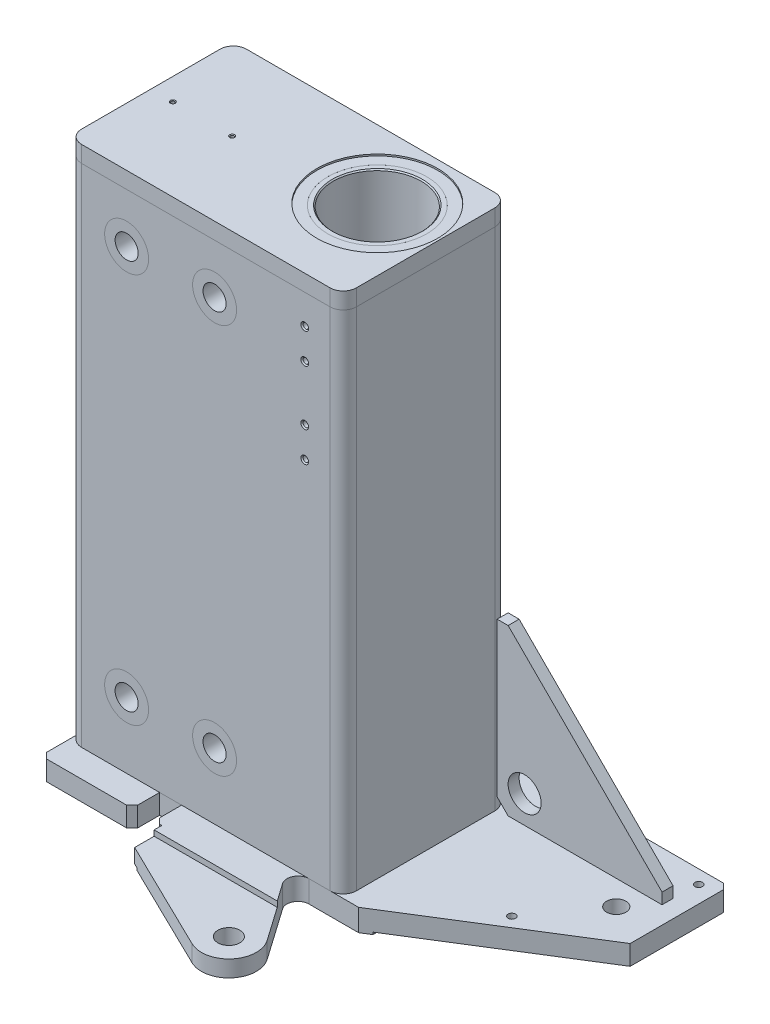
ISO-10303-21;
HEADER;
FILE_DESCRIPTION(('STEP AP214'),'2;1');
FILE_NAME('part.step','',(''),(''),'','','');
FILE_SCHEMA(('AUTOMOTIVE_DESIGN { 1 0 10303 214 1 1 1 1 }'));
ENDSEC;
DATA;
#1=APPLICATION_CONTEXT('core data for automotive mechanical design processes');
#2=APPLICATION_PROTOCOL_DEFINITION('international standard','automotive_design',2000,#1);
#3=PRODUCT_CONTEXT('',#1,'mechanical');
#4=PRODUCT('Part','Part','',(#3));
#5=PRODUCT_RELATED_PRODUCT_CATEGORY('part','',(#4));
#6=PRODUCT_DEFINITION_FORMATION('','',#4);
#7=PRODUCT_DEFINITION_CONTEXT('part definition',#1,'design');
#8=PRODUCT_DEFINITION('design','',#6,#7);
#9=PRODUCT_DEFINITION_SHAPE('','',#8);
#10=(LENGTH_UNIT() NAMED_UNIT(*) SI_UNIT(.MILLI.,.METRE.));
#11=(NAMED_UNIT(*) PLANE_ANGLE_UNIT() SI_UNIT($,.RADIAN.));
#12=(NAMED_UNIT(*) SI_UNIT($,.STERADIAN.) SOLID_ANGLE_UNIT());
#13=UNCERTAINTY_MEASURE_WITH_UNIT(LENGTH_MEASURE(1.E-05),#10,'distance_accuracy_value','');
#14=(GEOMETRIC_REPRESENTATION_CONTEXT(3) GLOBAL_UNCERTAINTY_ASSIGNED_CONTEXT((#13)) GLOBAL_UNIT_ASSIGNED_CONTEXT((#10,
#11,#12)) REPRESENTATION_CONTEXT('',''));
#15=CARTESIAN_POINT('',(0.,0.,0.));
#16=DIRECTION('',(0.,0.,1.));
#17=DIRECTION('',(1.,0.,0.));
#18=AXIS2_PLACEMENT_3D('',#15,#16,#17);
#19=CARTESIAN_POINT('',(135.,-310.,-75.));
#20=DIRECTION('',(0.707106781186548,0.707106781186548,0.));
#21=DIRECTION('',(-0.707106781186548,0.707106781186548,0.));
#22=AXIS2_PLACEMENT_3D('',#19,#20,#21);
#23=PLANE('',#22);
#24=DIRECTION('',(-0.707106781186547,0.707106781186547,0.));
#25=VECTOR('',#24,1.);
#26=CARTESIAN_POINT('',(135.,-310.,-65.));
#27=LINE('',#26,#25);
#28=CARTESIAN_POINT('',(275.,-450.,-65.));
#29=VERTEX_POINT('',#28);
#30=CARTESIAN_POINT('',(135.,-310.,-65.));
#31=VERTEX_POINT('',#30);
#32=EDGE_CURVE('E112',#29,#31,#27,.T.);
#33=ORIENTED_EDGE('',*,*,#32,.F.);
#34=DIRECTION('',(0.,0.,1.));
#35=VECTOR('',#34,1.);
#36=CARTESIAN_POINT('',(275.,-450.,-75.));
#37=LINE('',#36,#35);
#38=CARTESIAN_POINT('',(275.,-450.,-75.));
#39=VERTEX_POINT('',#38);
#40=EDGE_CURVE('E13',#39,#29,#37,.T.);
#41=ORIENTED_EDGE('',*,*,#40,.F.);
#42=DIRECTION('',(-0.707106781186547,0.707106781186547,0.));
#43=VECTOR('',#42,1.);
#44=CARTESIAN_POINT('',(135.,-310.,-75.));
#45=LINE('',#44,#43);
#46=CARTESIAN_POINT('',(135.,-310.,-75.));
#47=VERTEX_POINT('',#46);
#48=EDGE_CURVE('E114',#39,#47,#45,.T.);
#49=ORIENTED_EDGE('',*,*,#48,.T.);
#50=DIRECTION('',(0.,0.,1.));
#51=VECTOR('',#50,1.);
#52=CARTESIAN_POINT('',(135.,-310.,-75.));
#53=LINE('',#52,#51);
#54=EDGE_CURVE('E109',#47,#31,#53,.T.);
#55=ORIENTED_EDGE('',*,*,#54,.T.);
#56=EDGE_LOOP('',(#33,#41,#49,#55));
#57=FACE_BOUND('',#56,.T.);
#58=ADVANCED_FACE('F59',(#57),#23,.T.);
#59=CARTESIAN_POINT('',(275.,-450.,-75.));
#60=DIRECTION('',(1.,0.,0.));
#61=DIRECTION('',(0.,0.,-1.));
#62=AXIS2_PLACEMENT_3D('',#59,#60,#61);
#63=PLANE('',#62);
#64=DIRECTION('',(0.,1.,0.));
#65=VECTOR('',#64,1.);
#66=CARTESIAN_POINT('',(275.,-450.,-65.));
#67=LINE('',#66,#65);
#68=CARTESIAN_POINT('',(275.,-460.,-65.));
#69=VERTEX_POINT('',#68);
#70=EDGE_CURVE('E130',#69,#29,#67,.T.);
#71=ORIENTED_EDGE('',*,*,#70,.F.);
#72=DIRECTION('',(0.,0.,1.));
#73=VECTOR('',#72,1.);
#74=CARTESIAN_POINT('',(275.,-460.,-75.));
#75=LINE('',#74,#73);
#76=CARTESIAN_POINT('',(275.,-460.,-75.));
#77=VERTEX_POINT('',#76);
#78=EDGE_CURVE('E67',#77,#69,#75,.T.);
#79=ORIENTED_EDGE('',*,*,#78,.F.);
#80=DIRECTION('',(0.,1.,0.));
#81=VECTOR('',#80,1.);
#82=CARTESIAN_POINT('',(275.,-450.,-75.));
#83=LINE('',#82,#81);
#84=EDGE_CURVE('E119',#77,#39,#83,.T.);
#85=ORIENTED_EDGE('',*,*,#84,.T.);
#86=ORIENTED_EDGE('',*,*,#40,.T.);
#87=EDGE_LOOP('',(#71,#79,#85,#86));
#88=FACE_BOUND('',#87,.T.);
#89=ADVANCED_FACE('F169',(#88),#63,.T.);
#90=CARTESIAN_POINT('',(135.,-460.,-75.));
#91=DIRECTION('',(0.,-1.,0.));
#92=DIRECTION('',(0.,0.,-1.));
#93=AXIS2_PLACEMENT_3D('',#90,#91,#92);
#94=PLANE('',#93);
#95=DIRECTION('',(1.,0.,0.));
#96=VECTOR('',#95,1.);
#97=CARTESIAN_POINT('',(135.,-460.,-65.));
#98=LINE('',#97,#96);
#99=CARTESIAN_POINT('',(135.,-460.,-65.));
#100=VERTEX_POINT('',#99);
#101=EDGE_CURVE('E140',#100,#69,#98,.T.);
#102=ORIENTED_EDGE('',*,*,#101,.F.);
#103=DIRECTION('',(0.,0.,1.));
#104=VECTOR('',#103,1.);
#105=CARTESIAN_POINT('',(135.,-460.,-75.));
#106=LINE('',#105,#104);
#107=CARTESIAN_POINT('',(135.,-460.,-75.));
#108=VERTEX_POINT('',#107);
#109=EDGE_CURVE('E156',#108,#100,#106,.T.);
#110=ORIENTED_EDGE('',*,*,#109,.F.);
#111=DIRECTION('',(1.,0.,0.));
#112=VECTOR('',#111,1.);
#113=CARTESIAN_POINT('',(135.,-460.,-75.));
#114=LINE('',#113,#112);
#115=EDGE_CURVE('E152',#108,#77,#114,.T.);
#116=ORIENTED_EDGE('',*,*,#115,.T.);
#117=ORIENTED_EDGE('',*,*,#78,.T.);
#118=EDGE_LOOP('',(#102,#110,#116,#117));
#119=FACE_BOUND('',#118,.T.);
#120=ADVANCED_FACE('F174',(#119),#94,.T.);
#121=CARTESIAN_POINT('',(125.,-450.,-75.));
#122=DIRECTION('',(-0.707106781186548,-0.707106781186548,0.));
#123=DIRECTION('',(0.707106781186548,-0.707106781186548,0.));
#124=AXIS2_PLACEMENT_3D('',#121,#122,#123);
#125=PLANE('',#124);
#126=DIRECTION('',(0.707106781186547,-0.707106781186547,0.));
#127=VECTOR('',#126,1.);
#128=CARTESIAN_POINT('',(125.,-450.,-65.));
#129=LINE('',#128,#127);
#130=CARTESIAN_POINT('',(125.,-450.,-65.));
#131=VERTEX_POINT('',#130);
#132=EDGE_CURVE('E137',#131,#100,#129,.T.);
#133=ORIENTED_EDGE('',*,*,#132,.F.);
#134=DIRECTION('',(0.,0.,1.));
#135=VECTOR('',#134,1.);
#136=CARTESIAN_POINT('',(125.,-450.,-75.));
#137=LINE('',#136,#135);
#138=CARTESIAN_POINT('',(125.,-450.,-75.));
#139=VERTEX_POINT('',#138);
#140=EDGE_CURVE('E158',#139,#131,#137,.T.);
#141=ORIENTED_EDGE('',*,*,#140,.F.);
#142=DIRECTION('',(0.707106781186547,-0.707106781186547,0.));
#143=VECTOR('',#142,1.);
#144=CARTESIAN_POINT('',(125.,-450.,-75.));
#145=LINE('',#144,#143);
#146=EDGE_CURVE('E149',#139,#108,#145,.T.);
#147=ORIENTED_EDGE('',*,*,#146,.T.);
#148=ORIENTED_EDGE('',*,*,#109,.T.);
#149=EDGE_LOOP('',(#133,#141,#147,#148));
#150=FACE_BOUND('',#149,.T.);
#151=ADVANCED_FACE('F166',(#150),#125,.T.);
#152=CARTESIAN_POINT('',(125.,-310.,-75.));
#153=DIRECTION('',(-1.,0.,0.));
#154=DIRECTION('',(0.,-1.,0.));
#155=AXIS2_PLACEMENT_3D('',#152,#153,#154);
#156=PLANE('',#155);
#157=DIRECTION('',(0.,-1.,0.));
#158=VECTOR('',#157,1.);
#159=CARTESIAN_POINT('',(125.,-310.,-65.));
#160=LINE('',#159,#158);
#161=CARTESIAN_POINT('',(125.,-310.,-65.));
#162=VERTEX_POINT('',#161);
#163=EDGE_CURVE('E126',#162,#131,#160,.T.);
#164=ORIENTED_EDGE('',*,*,#163,.F.);
#165=DIRECTION('',(0.,0.,1.));
#166=VECTOR('',#165,1.);
#167=CARTESIAN_POINT('',(125.,-310.,-75.));
#168=LINE('',#167,#166);
#169=CARTESIAN_POINT('',(125.,-310.,-75.));
#170=VERTEX_POINT('',#169);
#171=EDGE_CURVE('E118',#170,#162,#168,.T.);
#172=ORIENTED_EDGE('',*,*,#171,.F.);
#173=DIRECTION('',(0.,-1.,0.));
#174=VECTOR('',#173,1.);
#175=CARTESIAN_POINT('',(125.,-310.,-75.));
#176=LINE('',#175,#174);
#177=EDGE_CURVE('E146',#170,#139,#176,.T.);
#178=ORIENTED_EDGE('',*,*,#177,.T.);
#179=ORIENTED_EDGE('',*,*,#140,.T.);
#180=EDGE_LOOP('',(#164,#172,#178,#179));
#181=FACE_BOUND('',#180,.T.);
#182=ADVANCED_FACE('F162',(#181),#156,.T.);
#183=CARTESIAN_POINT('',(135.,-310.,-75.));
#184=DIRECTION('',(0.,1.,0.));
#185=DIRECTION('',(0.,0.,1.));
#186=AXIS2_PLACEMENT_3D('',#183,#184,#185);
#187=PLANE('',#186);
#188=DIRECTION('',(-1.,0.,0.));
#189=VECTOR('',#188,1.);
#190=CARTESIAN_POINT('',(135.,-310.,-65.));
#191=LINE('',#190,#189);
#192=EDGE_CURVE('E121',#31,#162,#191,.T.);
#193=ORIENTED_EDGE('',*,*,#192,.F.);
#194=ORIENTED_EDGE('',*,*,#54,.F.);
#195=DIRECTION('',(-1.,0.,0.));
#196=VECTOR('',#195,1.);
#197=CARTESIAN_POINT('',(135.,-310.,-75.));
#198=LINE('',#197,#196);
#199=EDGE_CURVE('E144',#47,#170,#198,.T.);
#200=ORIENTED_EDGE('',*,*,#199,.T.);
#201=ORIENTED_EDGE('',*,*,#171,.T.);
#202=EDGE_LOOP('',(#193,#194,#200,#201));
#203=FACE_BOUND('',#202,.T.);
#204=ADVANCED_FACE('F122',(#203),#187,.T.);
#205=CARTESIAN_POINT('',(275.,-450.,-75.));
#206=DIRECTION('',(0.,0.,-1.));
#207=DIRECTION('',(-1.,0.,0.));
#208=AXIS2_PLACEMENT_3D('',#205,#206,#207);
#209=PLANE('',#208);
#210=CARTESIAN_POINT('',(150.,-435.,-75.));
#211=DIRECTION('',(0.,0.,-1.));
#212=DIRECTION('',(-1.,0.,0.));
#213=AXIS2_PLACEMENT_3D('',#210,#211,#212);
#214=CIRCLE('',#213,15.0000000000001);
#215=CARTESIAN_POINT('',(135.,-435.,-75.));
#216=VERTEX_POINT('',#215);
#217=EDGE_CURVE('E133',#216,#216,#214,.T.);
#218=ORIENTED_EDGE('',*,*,#217,.F.);
#219=EDGE_LOOP('',(#218));
#220=FACE_BOUND('',#219,.T.);
#221=ORIENTED_EDGE('',*,*,#48,.F.);
#222=ORIENTED_EDGE('',*,*,#84,.F.);
#223=ORIENTED_EDGE('',*,*,#115,.F.);
#224=ORIENTED_EDGE('',*,*,#146,.F.);
#225=ORIENTED_EDGE('',*,*,#177,.F.);
#226=ORIENTED_EDGE('',*,*,#199,.F.);
#227=EDGE_LOOP('',(#221,#222,#223,#224,#225,#226));
#228=FACE_BOUND('',#227,.T.);
#229=ADVANCED_FACE('F173',(#220,#228),#209,.T.);
#230=CARTESIAN_POINT('',(275.,-450.,-65.));
#231=DIRECTION('',(0.,0.,-1.));
#232=DIRECTION('',(-1.,0.,0.));
#233=AXIS2_PLACEMENT_3D('',#230,#231,#232);
#234=PLANE('',#233);
#235=CARTESIAN_POINT('',(150.,-435.,-65.));
#236=DIRECTION('',(0.,0.,-1.));
#237=DIRECTION('',(-1.,0.,0.));
#238=AXIS2_PLACEMENT_3D('',#235,#236,#237);
#239=CIRCLE('',#238,15.0000000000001);
#240=CARTESIAN_POINT('',(135.,-435.,-65.));
#241=VERTEX_POINT('',#240);
#242=EDGE_CURVE('E62',#241,#241,#239,.T.);
#243=ORIENTED_EDGE('',*,*,#242,.T.);
#244=EDGE_LOOP('',(#243));
#245=FACE_BOUND('',#244,.T.);
#246=ORIENTED_EDGE('',*,*,#32,.T.);
#247=ORIENTED_EDGE('',*,*,#192,.T.);
#248=ORIENTED_EDGE('',*,*,#163,.T.);
#249=ORIENTED_EDGE('',*,*,#132,.T.);
#250=ORIENTED_EDGE('',*,*,#101,.T.);
#251=ORIENTED_EDGE('',*,*,#70,.T.);
#252=EDGE_LOOP('',(#246,#247,#248,#249,#250,#251));
#253=FACE_BOUND('',#252,.T.);
#254=ADVANCED_FACE('F128',(#245,#253),#234,.F.);
#255=CARTESIAN_POINT('',(150.,-435.,177.));
#256=DIRECTION('',(0.,0.,-1.));
#257=DIRECTION('',(-1.,0.,0.));
#258=AXIS2_PLACEMENT_3D('',#255,#256,#257);
#259=CYLINDRICAL_SURFACE('',#258,15.0000000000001);
#260=ORIENTED_EDGE('',*,*,#217,.T.);
#261=EDGE_LOOP('',(#260));
#262=FACE_BOUND('',#261,.T.);
#263=ORIENTED_EDGE('',*,*,#242,.F.);
#264=EDGE_LOOP('',(#263));
#265=FACE_BOUND('',#264,.T.);
#266=ADVANCED_FACE('F233',(#262,#265),#259,.F.);
#267=CLOSED_SHELL('',(#58,#89,#120,#151,#182,#204,#229,#254,#266));
#268=MANIFOLD_SOLID_BREP('B2',#267);
#269=CARTESIAN_POINT('',(-72.,-400.,75.));
#270=DIRECTION('',(0.,0.,1.));
#271=DIRECTION('',(1.,0.,0.));
#272=AXIS2_PLACEMENT_3D('',#269,#270,#271);
#273=PLANE('',#272);
#274=CARTESIAN_POINT('',(-72.,-400.,75.));
#275=DIRECTION('',(0.,0.,1.));
#276=DIRECTION('',(1.,0.,0.));
#277=AXIS2_PLACEMENT_3D('',#274,#275,#276);
#278=CIRCLE('',#277,20.);
#279=CARTESIAN_POINT('',(-52.,-400.,75.));
#280=VERTEX_POINT('',#279);
#281=EDGE_CURVE('E262',#280,#280,#278,.T.);
#282=ORIENTED_EDGE('',*,*,#281,.T.);
#283=EDGE_LOOP('',(#282));
#284=FACE_BOUND('',#283,.T.);
#285=CARTESIAN_POINT('',(-72.,-400.,75.));
#286=DIRECTION('',(0.,0.,1.));
#287=DIRECTION('',(1.,0.,0.));
#288=AXIS2_PLACEMENT_3D('',#285,#286,#287);
#289=CIRCLE('',#288,10.5);
#290=CARTESIAN_POINT('',(-61.5,-400.,75.));
#291=VERTEX_POINT('',#290);
#292=EDGE_CURVE('E378',#291,#291,#289,.T.);
#293=ORIENTED_EDGE('',*,*,#292,.F.);
#294=EDGE_LOOP('',(#293));
#295=FACE_BOUND('',#294,.T.);
#296=ADVANCED_FACE('F367',(#284,#295),#273,.T.);
#297=CARTESIAN_POINT('',(-72.,-400.,-75.));
#298=DIRECTION('',(0.,0.,1.));
#299=DIRECTION('',(1.,0.,0.));
#300=AXIS2_PLACEMENT_3D('',#297,#298,#299);
#301=PLANE('',#300);
#302=CARTESIAN_POINT('',(-72.,-400.,-75.));
#303=DIRECTION('',(0.,0.,1.));
#304=DIRECTION('',(1.,0.,0.));
#305=AXIS2_PLACEMENT_3D('',#302,#303,#304);
#306=CIRCLE('',#305,20.);
#307=CARTESIAN_POINT('',(-52.,-400.,-75.));
#308=VERTEX_POINT('',#307);
#309=EDGE_CURVE('E374',#308,#308,#306,.T.);
#310=ORIENTED_EDGE('',*,*,#309,.F.);
#311=EDGE_LOOP('',(#310));
#312=FACE_BOUND('',#311,.T.);
#313=CARTESIAN_POINT('',(-72.,-400.,-75.));
#314=DIRECTION('',(0.,0.,1.));
#315=DIRECTION('',(1.,0.,0.));
#316=AXIS2_PLACEMENT_3D('',#313,#314,#315);
#317=CIRCLE('',#316,10.5);
#318=CARTESIAN_POINT('',(-61.5,-400.,-75.));
#319=VERTEX_POINT('',#318);
#320=EDGE_CURVE('E382',#319,#319,#317,.T.);
#321=ORIENTED_EDGE('',*,*,#320,.T.);
#322=EDGE_LOOP('',(#321));
#323=FACE_BOUND('',#322,.T.);
#324=ADVANCED_FACE('F388',(#312,#323),#301,.F.);
#325=CARTESIAN_POINT('',(-72.,-400.,75.));
#326=DIRECTION('',(0.,0.,-1.));
#327=DIRECTION('',(-1.,0.,0.));
#328=AXIS2_PLACEMENT_3D('',#325,#326,#327);
#329=CYLINDRICAL_SURFACE('',#328,20.);
#330=ORIENTED_EDGE('',*,*,#281,.F.);
#331=EDGE_LOOP('',(#330));
#332=FACE_BOUND('',#331,.T.);
#333=ORIENTED_EDGE('',*,*,#309,.T.);
#334=EDGE_LOOP('',(#333));
#335=FACE_BOUND('',#334,.T.);
#336=ADVANCED_FACE('F369',(#332,#335),#329,.T.);
#337=CARTESIAN_POINT('',(-72.,-400.,75.));
#338=DIRECTION('',(0.,0.,-1.));
#339=DIRECTION('',(-1.,0.,0.));
#340=AXIS2_PLACEMENT_3D('',#337,#338,#339);
#341=CYLINDRICAL_SURFACE('',#340,10.5);
#342=ORIENTED_EDGE('',*,*,#292,.T.);
#343=EDGE_LOOP('',(#342));
#344=FACE_BOUND('',#343,.T.);
#345=ORIENTED_EDGE('',*,*,#320,.F.);
#346=EDGE_LOOP('',(#345));
#347=FACE_BOUND('',#346,.T.);
#348=ADVANCED_FACE('F390',(#344,#347),#341,.F.);
#349=CLOSED_SHELL('',(#296,#324,#336,#348));
#350=MANIFOLD_SOLID_BREP('B51',#349);
#351=CARTESIAN_POINT('',(8.00000000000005,-400.,75.));
#352=DIRECTION('',(0.,0.,1.));
#353=DIRECTION('',(1.,0.,0.));
#354=AXIS2_PLACEMENT_3D('',#351,#352,#353);
#355=PLANE('',#354);
#356=CARTESIAN_POINT('',(8.00000000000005,-400.,75.));
#357=DIRECTION('',(0.,0.,1.));
#358=DIRECTION('',(1.,0.,0.));
#359=AXIS2_PLACEMENT_3D('',#356,#357,#358);
#360=CIRCLE('',#359,20.);
#361=CARTESIAN_POINT('',(28.0000000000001,-400.,75.));
#362=VERTEX_POINT('',#361);
#363=EDGE_CURVE('E366',#362,#362,#360,.T.);
#364=ORIENTED_EDGE('',*,*,#363,.T.);
#365=EDGE_LOOP('',(#364));
#366=FACE_BOUND('',#365,.T.);
#367=CARTESIAN_POINT('',(8.00000000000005,-400.,75.));
#368=DIRECTION('',(0.,0.,1.));
#369=DIRECTION('',(1.,0.,0.));
#370=AXIS2_PLACEMENT_3D('',#367,#368,#369);
#371=CIRCLE('',#370,10.5);
#372=CARTESIAN_POINT('',(18.5,-400.,75.));
#373=VERTEX_POINT('',#372);
#374=EDGE_CURVE('E447',#373,#373,#371,.T.);
#375=ORIENTED_EDGE('',*,*,#374,.F.);
#376=EDGE_LOOP('',(#375));
#377=FACE_BOUND('',#376,.T.);
#378=ADVANCED_FACE('F436',(#366,#377),#355,.T.);
#379=CARTESIAN_POINT('',(8.00000000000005,-400.,-75.));
#380=DIRECTION('',(0.,0.,1.));
#381=DIRECTION('',(1.,0.,0.));
#382=AXIS2_PLACEMENT_3D('',#379,#380,#381);
#383=PLANE('',#382);
#384=CARTESIAN_POINT('',(8.00000000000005,-400.,-75.));
#385=DIRECTION('',(0.,0.,1.));
#386=DIRECTION('',(1.,0.,0.));
#387=AXIS2_PLACEMENT_3D('',#384,#385,#386);
#388=CIRCLE('',#387,20.);
#389=CARTESIAN_POINT('',(28.0000000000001,-400.,-75.));
#390=VERTEX_POINT('',#389);
#391=EDGE_CURVE('E443',#390,#390,#388,.T.);
#392=ORIENTED_EDGE('',*,*,#391,.F.);
#393=EDGE_LOOP('',(#392));
#394=FACE_BOUND('',#393,.T.);
#395=CARTESIAN_POINT('',(8.00000000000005,-400.,-75.));
#396=DIRECTION('',(0.,0.,1.));
#397=DIRECTION('',(1.,0.,0.));
#398=AXIS2_PLACEMENT_3D('',#395,#396,#397);
#399=CIRCLE('',#398,10.5);
#400=CARTESIAN_POINT('',(18.5,-400.,-75.));
#401=VERTEX_POINT('',#400);
#402=EDGE_CURVE('E451',#401,#401,#399,.T.);
#403=ORIENTED_EDGE('',*,*,#402,.T.);
#404=EDGE_LOOP('',(#403));
#405=FACE_BOUND('',#404,.T.);
#406=ADVANCED_FACE('F457',(#394,#405),#383,.F.);
#407=CARTESIAN_POINT('',(8.00000000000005,-400.,75.));
#408=DIRECTION('',(0.,0.,-1.));
#409=DIRECTION('',(-1.,0.,0.));
#410=AXIS2_PLACEMENT_3D('',#407,#408,#409);
#411=CYLINDRICAL_SURFACE('',#410,20.);
#412=ORIENTED_EDGE('',*,*,#363,.F.);
#413=EDGE_LOOP('',(#412));
#414=FACE_BOUND('',#413,.T.);
#415=ORIENTED_EDGE('',*,*,#391,.T.);
#416=EDGE_LOOP('',(#415));
#417=FACE_BOUND('',#416,.T.);
#418=ADVANCED_FACE('F438',(#414,#417),#411,.T.);
#419=CARTESIAN_POINT('',(8.00000000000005,-400.,75.));
#420=DIRECTION('',(0.,0.,-1.));
#421=DIRECTION('',(-1.,0.,0.));
#422=AXIS2_PLACEMENT_3D('',#419,#420,#421);
#423=CYLINDRICAL_SURFACE('',#422,10.5);
#424=ORIENTED_EDGE('',*,*,#374,.T.);
#425=EDGE_LOOP('',(#424));
#426=FACE_BOUND('',#425,.T.);
#427=ORIENTED_EDGE('',*,*,#402,.F.);
#428=EDGE_LOOP('',(#427));
#429=FACE_BOUND('',#428,.T.);
#430=ADVANCED_FACE('F459',(#426,#429),#423,.F.);
#431=CLOSED_SHELL('',(#378,#406,#418,#430));
#432=MANIFOLD_SOLID_BREP('B257',#431);
#433=CARTESIAN_POINT('',(8.00000000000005,-45.,75.));
#434=DIRECTION('',(0.,0.,1.));
#435=DIRECTION('',(1.,0.,0.));
#436=AXIS2_PLACEMENT_3D('',#433,#434,#435);
#437=PLANE('',#436);
#438=CARTESIAN_POINT('',(8.00000000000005,-45.,75.));
#439=DIRECTION('',(0.,0.,1.));
#440=DIRECTION('',(1.,0.,0.));
#441=AXIS2_PLACEMENT_3D('',#438,#439,#440);
#442=CIRCLE('',#441,20.);
#443=CARTESIAN_POINT('',(28.0000000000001,-45.,75.));
#444=VERTEX_POINT('',#443);
#445=EDGE_CURVE('E435',#444,#444,#442,.T.);
#446=ORIENTED_EDGE('',*,*,#445,.T.);
#447=EDGE_LOOP('',(#446));
#448=FACE_BOUND('',#447,.T.);
#449=CARTESIAN_POINT('',(8.00000000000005,-45.,75.));
#450=DIRECTION('',(0.,0.,1.));
#451=DIRECTION('',(1.,0.,0.));
#452=AXIS2_PLACEMENT_3D('',#449,#450,#451);
#453=CIRCLE('',#452,10.5);
#454=CARTESIAN_POINT('',(18.5,-45.,75.));
#455=VERTEX_POINT('',#454);
#456=EDGE_CURVE('E516',#455,#455,#453,.T.);
#457=ORIENTED_EDGE('',*,*,#456,.F.);
#458=EDGE_LOOP('',(#457));
#459=FACE_BOUND('',#458,.T.);
#460=ADVANCED_FACE('F505',(#448,#459),#437,.T.);
#461=CARTESIAN_POINT('',(8.00000000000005,-45.,-75.));
#462=DIRECTION('',(0.,0.,1.));
#463=DIRECTION('',(1.,0.,0.));
#464=AXIS2_PLACEMENT_3D('',#461,#462,#463);
#465=PLANE('',#464);
#466=CARTESIAN_POINT('',(8.00000000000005,-45.,-75.));
#467=DIRECTION('',(0.,0.,1.));
#468=DIRECTION('',(1.,0.,0.));
#469=AXIS2_PLACEMENT_3D('',#466,#467,#468);
#470=CIRCLE('',#469,20.);
#471=CARTESIAN_POINT('',(28.0000000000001,-45.,-75.));
#472=VERTEX_POINT('',#471);
#473=EDGE_CURVE('E512',#472,#472,#470,.T.);
#474=ORIENTED_EDGE('',*,*,#473,.F.);
#475=EDGE_LOOP('',(#474));
#476=FACE_BOUND('',#475,.T.);
#477=CARTESIAN_POINT('',(8.00000000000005,-45.,-75.));
#478=DIRECTION('',(0.,0.,1.));
#479=DIRECTION('',(1.,0.,0.));
#480=AXIS2_PLACEMENT_3D('',#477,#478,#479);
#481=CIRCLE('',#480,10.5);
#482=CARTESIAN_POINT('',(18.5,-45.,-75.));
#483=VERTEX_POINT('',#482);
#484=EDGE_CURVE('E520',#483,#483,#481,.T.);
#485=ORIENTED_EDGE('',*,*,#484,.T.);
#486=EDGE_LOOP('',(#485));
#487=FACE_BOUND('',#486,.T.);
#488=ADVANCED_FACE('F526',(#476,#487),#465,.F.);
#489=CARTESIAN_POINT('',(8.00000000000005,-45.,75.));
#490=DIRECTION('',(0.,0.,-1.));
#491=DIRECTION('',(-1.,0.,0.));
#492=AXIS2_PLACEMENT_3D('',#489,#490,#491);
#493=CYLINDRICAL_SURFACE('',#492,20.);
#494=ORIENTED_EDGE('',*,*,#445,.F.);
#495=EDGE_LOOP('',(#494));
#496=FACE_BOUND('',#495,.T.);
#497=ORIENTED_EDGE('',*,*,#473,.T.);
#498=EDGE_LOOP('',(#497));
#499=FACE_BOUND('',#498,.T.);
#500=ADVANCED_FACE('F507',(#496,#499),#493,.T.);
#501=CARTESIAN_POINT('',(8.00000000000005,-45.,75.));
#502=DIRECTION('',(0.,0.,-1.));
#503=DIRECTION('',(-1.,0.,0.));
#504=AXIS2_PLACEMENT_3D('',#501,#502,#503);
#505=CYLINDRICAL_SURFACE('',#504,10.5);
#506=ORIENTED_EDGE('',*,*,#456,.T.);
#507=EDGE_LOOP('',(#506));
#508=FACE_BOUND('',#507,.T.);
#509=ORIENTED_EDGE('',*,*,#484,.F.);
#510=EDGE_LOOP('',(#509));
#511=FACE_BOUND('',#510,.T.);
#512=ADVANCED_FACE('F528',(#508,#511),#505,.F.);
#513=CLOSED_SHELL('',(#460,#488,#500,#512));
#514=MANIFOLD_SOLID_BREP('B361',#513);
#515=CARTESIAN_POINT('',(-72.,-45.,75.));
#516=DIRECTION('',(0.,0.,1.));
#517=DIRECTION('',(1.,0.,0.));
#518=AXIS2_PLACEMENT_3D('',#515,#516,#517);
#519=PLANE('',#518);
#520=CARTESIAN_POINT('',(-72.,-45.,75.));
#521=DIRECTION('',(0.,0.,1.));
#522=DIRECTION('',(1.,0.,0.));
#523=AXIS2_PLACEMENT_3D('',#520,#521,#522);
#524=CIRCLE('',#523,20.);
#525=CARTESIAN_POINT('',(-52.,-45.,75.));
#526=VERTEX_POINT('',#525);
#527=EDGE_CURVE('E504',#526,#526,#524,.T.);
#528=ORIENTED_EDGE('',*,*,#527,.T.);
#529=EDGE_LOOP('',(#528));
#530=FACE_BOUND('',#529,.T.);
#531=CARTESIAN_POINT('',(-72.,-45.,75.));
#532=DIRECTION('',(0.,0.,1.));
#533=DIRECTION('',(1.,0.,0.));
#534=AXIS2_PLACEMENT_3D('',#531,#532,#533);
#535=CIRCLE('',#534,10.5);
#536=CARTESIAN_POINT('',(-61.5,-45.,75.));
#537=VERTEX_POINT('',#536);
#538=EDGE_CURVE('E587',#537,#537,#535,.T.);
#539=ORIENTED_EDGE('',*,*,#538,.F.);
#540=EDGE_LOOP('',(#539));
#541=FACE_BOUND('',#540,.T.);
#542=ADVANCED_FACE('F576',(#530,#541),#519,.T.);
#543=CARTESIAN_POINT('',(-72.,-45.,-75.));
#544=DIRECTION('',(0.,0.,1.));
#545=DIRECTION('',(1.,0.,0.));
#546=AXIS2_PLACEMENT_3D('',#543,#544,#545);
#547=PLANE('',#546);
#548=CARTESIAN_POINT('',(-72.,-45.,-75.));
#549=DIRECTION('',(0.,0.,1.));
#550=DIRECTION('',(1.,0.,0.));
#551=AXIS2_PLACEMENT_3D('',#548,#549,#550);
#552=CIRCLE('',#551,20.);
#553=CARTESIAN_POINT('',(-52.,-45.,-75.));
#554=VERTEX_POINT('',#553);
#555=EDGE_CURVE('E583',#554,#554,#552,.T.);
#556=ORIENTED_EDGE('',*,*,#555,.F.);
#557=EDGE_LOOP('',(#556));
#558=FACE_BOUND('',#557,.T.);
#559=CARTESIAN_POINT('',(-72.,-45.,-75.));
#560=DIRECTION('',(0.,0.,1.));
#561=DIRECTION('',(1.,0.,0.));
#562=AXIS2_PLACEMENT_3D('',#559,#560,#561);
#563=CIRCLE('',#562,10.5);
#564=CARTESIAN_POINT('',(-61.5,-45.,-75.));
#565=VERTEX_POINT('',#564);
#566=EDGE_CURVE('E591',#565,#565,#563,.T.);
#567=ORIENTED_EDGE('',*,*,#566,.T.);
#568=EDGE_LOOP('',(#567));
#569=FACE_BOUND('',#568,.T.);
#570=ADVANCED_FACE('F597',(#558,#569),#547,.F.);
#571=CARTESIAN_POINT('',(-72.,-45.,75.));
#572=DIRECTION('',(0.,0.,-1.));
#573=DIRECTION('',(-1.,0.,0.));
#574=AXIS2_PLACEMENT_3D('',#571,#572,#573);
#575=CYLINDRICAL_SURFACE('',#574,20.);
#576=ORIENTED_EDGE('',*,*,#527,.F.);
#577=EDGE_LOOP('',(#576));
#578=FACE_BOUND('',#577,.T.);
#579=ORIENTED_EDGE('',*,*,#555,.T.);
#580=EDGE_LOOP('',(#579));
#581=FACE_BOUND('',#580,.T.);
#582=ADVANCED_FACE('F578',(#578,#581),#575,.T.);
#583=CARTESIAN_POINT('',(-72.,-45.,75.));
#584=DIRECTION('',(0.,0.,-1.));
#585=DIRECTION('',(-1.,0.,0.));
#586=AXIS2_PLACEMENT_3D('',#583,#584,#585);
#587=CYLINDRICAL_SURFACE('',#586,10.5);
#588=ORIENTED_EDGE('',*,*,#538,.T.);
#589=EDGE_LOOP('',(#588));
#590=FACE_BOUND('',#589,.T.);
#591=ORIENTED_EDGE('',*,*,#566,.F.);
#592=EDGE_LOOP('',(#591));
#593=FACE_BOUND('',#592,.T.);
#594=ADVANCED_FACE('F599',(#590,#593),#587,.F.);
#595=CLOSED_SHELL('',(#542,#570,#582,#594));
#596=MANIFOLD_SOLID_BREP('B430',#595);
#597=CARTESIAN_POINT('',(68.0000000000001,-415.,-13.));
#598=DIRECTION('',(0.,1.,0.));
#599=DIRECTION('',(-1.,0.,0.));
#600=AXIS2_PLACEMENT_3D('',#597,#598,#599);
#601=CYLINDRICAL_SURFACE('',#600,45.);
#602=CARTESIAN_POINT('',(68.0000000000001,-460.,-13.));
#603=DIRECTION('',(0.,1.,0.));
#604=DIRECTION('',(-1.,0.,0.));
#605=AXIS2_PLACEMENT_3D('',#602,#603,#604);
#606=CIRCLE('',#605,45.);
#607=CARTESIAN_POINT('',(23.0000000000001,-460.,-13.));
#608=VERTEX_POINT('',#607);
#609=EDGE_CURVE('E807',#608,#608,#606,.T.);
#610=ORIENTED_EDGE('',*,*,#609,.F.);
#611=EDGE_LOOP('',(#610));
#612=FACE_BOUND('',#611,.T.);
#613=CARTESIAN_POINT('',(68.0000000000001,-478.5,-13.));
#614=DIRECTION('',(0.,-1.,0.));
#615=DIRECTION('',(0.,0.,-1.));
#616=AXIS2_PLACEMENT_3D('',#613,#614,#615);
#617=CIRCLE('',#616,45.);
#618=CARTESIAN_POINT('',(68.0000000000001,-478.5,-58.));
#619=VERTEX_POINT('',#618);
#620=EDGE_CURVE('E853',#619,#619,#617,.F.);
#621=ORIENTED_EDGE('',*,*,#620,.T.);
#622=EDGE_LOOP('',(#621));
#623=FACE_BOUND('',#622,.T.);
#624=ADVANCED_FACE('F647',(#612,#623),#601,.T.);
#625=CARTESIAN_POINT('',(68.0000000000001,-415.,-13.));
#626=DIRECTION('',(0.,1.,0.));
#627=DIRECTION('',(-1.,0.,0.));
#628=AXIS2_PLACEMENT_3D('',#625,#626,#627);
#629=CYLINDRICAL_SURFACE('',#628,40.);
#630=CARTESIAN_POINT('',(68.0000000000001,-477.5,-13.));
#631=DIRECTION('',(0.,-1.,0.));
#632=DIRECTION('',(0.,0.,-1.));
#633=AXIS2_PLACEMENT_3D('',#630,#631,#632);
#634=CIRCLE('',#633,40.);
#635=CARTESIAN_POINT('',(68.0000000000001,-477.5,-53.));
#636=VERTEX_POINT('',#635);
#637=EDGE_CURVE('E655',#636,#636,#634,.T.);
#638=ORIENTED_EDGE('',*,*,#637,.T.);
#639=EDGE_LOOP('',(#638));
#640=FACE_BOUND('',#639,.T.);
#641=CARTESIAN_POINT('',(68.0000000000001,-420.,-13.));
#642=DIRECTION('',(0.,1.,0.));
#643=DIRECTION('',(-1.,0.,0.));
#644=AXIS2_PLACEMENT_3D('',#641,#642,#643);
#645=CIRCLE('',#644,40.);
#646=CARTESIAN_POINT('',(28.0000000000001,-420.,-13.));
#647=VERTEX_POINT('',#646);
#648=EDGE_CURVE('E804',#647,#647,#645,.T.);
#649=ORIENTED_EDGE('',*,*,#648,.T.);
#650=EDGE_LOOP('',(#649));
#651=FACE_BOUND('',#650,.T.);
#652=ADVANCED_FACE('F719',(#640,#651),#629,.F.);
#653=CARTESIAN_POINT('',(68.0000000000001,-415.,-13.));
#654=DIRECTION('',(0.,1.,0.));
#655=DIRECTION('',(-1.,0.,0.));
#656=AXIS2_PLACEMENT_3D('',#653,#654,#655);
#657=CYLINDRICAL_SURFACE('',#656,45.);
#658=CARTESIAN_POINT('',(68.,0.,-13.));
#659=DIRECTION('',(0.,1.,0.));
#660=DIRECTION('',(-1.,0.,0.));
#661=AXIS2_PLACEMENT_3D('',#658,#659,#660);
#662=CIRCLE('',#661,45.);
#663=CARTESIAN_POINT('',(23.,0.,-13.));
#664=VERTEX_POINT('',#663);
#665=EDGE_CURVE('E766',#664,#664,#662,.T.);
#666=ORIENTED_EDGE('',*,*,#665,.T.);
#667=EDGE_LOOP('',(#666));
#668=FACE_BOUND('',#667,.T.);
#669=CARTESIAN_POINT('',(68.,13.5,-13.));
#670=DIRECTION('',(0.,1.,0.));
#671=DIRECTION('',(0.,0.,1.));
#672=AXIS2_PLACEMENT_3D('',#669,#670,#671);
#673=CIRCLE('',#672,45.);
#674=CARTESIAN_POINT('',(68.,13.5,32.));
#675=VERTEX_POINT('',#674);
#676=EDGE_CURVE('E700',#675,#675,#673,.F.);
#677=ORIENTED_EDGE('',*,*,#676,.T.);
#678=EDGE_LOOP('',(#677));
#679=FACE_BOUND('',#678,.T.);
#680=ADVANCED_FACE('F649',(#668,#679),#657,.T.);
#681=CARTESIAN_POINT('',(68.0000000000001,-415.,-13.));
#682=DIRECTION('',(0.,1.,0.));
#683=DIRECTION('',(-1.,0.,0.));
#684=AXIS2_PLACEMENT_3D('',#681,#682,#683);
#685=CYLINDRICAL_SURFACE('',#684,40.);
#686=CARTESIAN_POINT('',(68.,12.5,-13.));
#687=DIRECTION('',(0.,1.,0.));
#688=DIRECTION('',(0.,0.,1.));
#689=AXIS2_PLACEMENT_3D('',#686,#687,#688);
#690=CIRCLE('',#689,40.);
#691=CARTESIAN_POINT('',(68.,12.5,27.));
#692=VERTEX_POINT('',#691);
#693=EDGE_CURVE('E711',#692,#692,#690,.T.);
#694=ORIENTED_EDGE('',*,*,#693,.T.);
#695=EDGE_LOOP('',(#694));
#696=FACE_BOUND('',#695,.T.);
#697=CARTESIAN_POINT('',(68.,-45.,-13.));
#698=DIRECTION('',(0.,1.,0.));
#699=DIRECTION('',(-1.,0.,0.));
#700=AXIS2_PLACEMENT_3D('',#697,#698,#699);
#701=CIRCLE('',#700,40.);
#702=CARTESIAN_POINT('',(28.,-45.,-13.));
#703=VERTEX_POINT('',#702);
#704=EDGE_CURVE('E789',#703,#703,#701,.T.);
#705=ORIENTED_EDGE('',*,*,#704,.F.);
#706=EDGE_LOOP('',(#705));
#707=FACE_BOUND('',#706,.T.);
#708=ADVANCED_FACE('F753',(#696,#707),#685,.F.);
#709=CARTESIAN_POINT('',(20.5,0.,-13.));
#710=DIRECTION('',(0.,1.,0.));
#711=DIRECTION('',(-1.,0.,0.));
#712=AXIS2_PLACEMENT_3D('',#709,#710,#711);
#713=PLANE('',#712);
#714=CARTESIAN_POINT('',(68.,0.,-13.));
#715=DIRECTION('',(0.,1.,0.));
#716=DIRECTION('',(-1.,0.,0.));
#717=AXIS2_PLACEMENT_3D('',#714,#715,#716);
#718=CIRCLE('',#717,47.5);
#719=CARTESIAN_POINT('',(20.5,0.,-13.));
#720=VERTEX_POINT('',#719);
#721=EDGE_CURVE('E763',#720,#720,#718,.T.);
#722=ORIENTED_EDGE('',*,*,#721,.T.);
#723=EDGE_LOOP('',(#722));
#724=FACE_BOUND('',#723,.T.);
#725=ORIENTED_EDGE('',*,*,#665,.F.);
#726=EDGE_LOOP('',(#725));
#727=FACE_BOUND('',#726,.T.);
#728=ADVANCED_FACE('F751',(#724,#727),#713,.T.);
#729=CARTESIAN_POINT('',(68.0000000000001,-415.,-13.));
#730=DIRECTION('',(0.,1.,0.));
#731=DIRECTION('',(-1.,0.,0.));
#732=AXIS2_PLACEMENT_3D('',#729,#730,#731);
#733=CYLINDRICAL_SURFACE('',#732,47.5);
#734=CARTESIAN_POINT('',(68.0000000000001,-381.,-13.));
#735=DIRECTION('',(0.,1.,0.));
#736=DIRECTION('',(0.,0.,1.));
#737=AXIS2_PLACEMENT_3D('',#734,#735,#736);
#738=CIRCLE('',#737,47.5);
#739=CARTESIAN_POINT('',(27.9,-381.,12.4605577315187));
#740=VERTEX_POINT('',#739);
#741=CARTESIAN_POINT('',(27.9,-381.,-38.4605577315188));
#742=VERTEX_POINT('',#741);
#743=EDGE_CURVE('E705',#740,#742,#738,.F.);
#744=ORIENTED_EDGE('',*,*,#743,.F.);
#745=DIRECTION('',(0.,1.,0.));
#746=VECTOR('',#745,1.);
#747=CARTESIAN_POINT('',(27.9,-415.,12.4605577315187));
#748=LINE('',#747,#746);
#749=CARTESIAN_POINT('',(27.9,-419.,12.4605577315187));
#750=VERTEX_POINT('',#749);
#751=EDGE_CURVE('E691',#750,#740,#748,.T.);
#752=ORIENTED_EDGE('',*,*,#751,.F.);
#753=CARTESIAN_POINT('',(68.0000000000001,-419.,-13.));
#754=DIRECTION('',(0.,-1.,0.));
#755=DIRECTION('',(0.,0.,-1.));
#756=AXIS2_PLACEMENT_3D('',#753,#754,#755);
#757=CIRCLE('',#756,47.5);
#758=CARTESIAN_POINT('',(27.9,-419.,-38.4605577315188));
#759=VERTEX_POINT('',#758);
#760=EDGE_CURVE('E686',#759,#750,#757,.F.);
#761=ORIENTED_EDGE('',*,*,#760,.F.);
#762=DIRECTION('',(0.,1.,0.));
#763=VECTOR('',#762,1.);
#764=CARTESIAN_POINT('',(27.9,-415.,-38.4605577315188));
#765=LINE('',#764,#763);
#766=EDGE_CURVE('E698',#742,#759,#765,.F.);
#767=ORIENTED_EDGE('',*,*,#766,.F.);
#768=EDGE_LOOP('',(#744,#752,#761,#767));
#769=FACE_BOUND('',#768,.T.);
#770=CARTESIAN_POINT('',(68.,-26.,-13.));
#771=DIRECTION('',(0.,1.,0.));
#772=DIRECTION('',(0.,0.,1.));
#773=AXIS2_PLACEMENT_3D('',#770,#771,#772);
#774=CIRCLE('',#773,47.5);
#775=CARTESIAN_POINT('',(27.9,-26.,12.4605577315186));
#776=VERTEX_POINT('',#775);
#777=CARTESIAN_POINT('',(27.9,-26.,-38.4605577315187));
#778=VERTEX_POINT('',#777);
#779=EDGE_CURVE('E692',#776,#778,#774,.F.);
#780=ORIENTED_EDGE('',*,*,#779,.F.);
#781=DIRECTION('',(0.,1.,0.));
#782=VECTOR('',#781,1.);
#783=CARTESIAN_POINT('',(27.9,-415.,12.4605577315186));
#784=LINE('',#783,#782);
#785=CARTESIAN_POINT('',(27.9,-64.0000000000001,12.4605577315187));
#786=VERTEX_POINT('',#785);
#787=EDGE_CURVE('E770',#786,#776,#784,.T.);
#788=ORIENTED_EDGE('',*,*,#787,.F.);
#789=CARTESIAN_POINT('',(68.,-64.0000000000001,-13.));
#790=DIRECTION('',(0.,-1.,0.));
#791=DIRECTION('',(0.,0.,-1.));
#792=AXIS2_PLACEMENT_3D('',#789,#790,#791);
#793=CIRCLE('',#792,47.5);
#794=CARTESIAN_POINT('',(27.9,-64.0000000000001,-38.4605577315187));
#795=VERTEX_POINT('',#794);
#796=EDGE_CURVE('E768',#795,#786,#793,.F.);
#797=ORIENTED_EDGE('',*,*,#796,.F.);
#798=DIRECTION('',(0.,1.,0.));
#799=VECTOR('',#798,1.);
#800=CARTESIAN_POINT('',(27.9,-415.,-38.4605577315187));
#801=LINE('',#800,#799);
#802=EDGE_CURVE('E777',#778,#795,#801,.F.);
#803=ORIENTED_EDGE('',*,*,#802,.F.);
#804=EDGE_LOOP('',(#780,#788,#797,#803));
#805=FACE_BOUND('',#804,.T.);
#806=CARTESIAN_POINT('',(68.0000000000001,-460.,-13.));
#807=DIRECTION('',(0.,1.,0.));
#808=DIRECTION('',(-1.,0.,0.));
#809=AXIS2_PLACEMENT_3D('',#806,#807,#808);
#810=CIRCLE('',#809,47.5);
#811=CARTESIAN_POINT('',(20.5000000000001,-460.,-13.));
#812=VERTEX_POINT('',#811);
#813=EDGE_CURVE('E772',#812,#812,#810,.T.);
#814=ORIENTED_EDGE('',*,*,#813,.T.);
#815=EDGE_LOOP('',(#814));
#816=FACE_BOUND('',#815,.T.);
#817=ORIENTED_EDGE('',*,*,#721,.F.);
#818=EDGE_LOOP('',(#817));
#819=FACE_BOUND('',#818,.T.);
#820=ADVANCED_FACE('F703',(#769,#805,#816,#819),#733,.T.);
#821=CARTESIAN_POINT('',(20.5000000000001,-460.,-13.));
#822=DIRECTION('',(0.,-1.,0.));
#823=DIRECTION('',(1.,0.,0.));
#824=AXIS2_PLACEMENT_3D('',#821,#822,#823);
#825=PLANE('',#824);
#826=ORIENTED_EDGE('',*,*,#609,.T.);
#827=EDGE_LOOP('',(#826));
#828=FACE_BOUND('',#827,.T.);
#829=ORIENTED_EDGE('',*,*,#813,.F.);
#830=EDGE_LOOP('',(#829));
#831=FACE_BOUND('',#830,.T.);
#832=ADVANCED_FACE('F745',(#828,#831),#825,.T.);
#833=CARTESIAN_POINT('',(29.5000000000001,-420.,-13.));
#834=DIRECTION('',(0.,-1.,0.));
#835=DIRECTION('',(1.,0.,0.));
#836=AXIS2_PLACEMENT_3D('',#833,#834,#835);
#837=PLANE('',#836);
#838=CARTESIAN_POINT('',(68.0000000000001,-420.,-13.));
#839=DIRECTION('',(0.,1.,0.));
#840=DIRECTION('',(-1.,0.,0.));
#841=AXIS2_PLACEMENT_3D('',#838,#839,#840);
#842=CIRCLE('',#841,38.5);
#843=CARTESIAN_POINT('',(29.5000000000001,-420.,-13.));
#844=VERTEX_POINT('',#843);
#845=EDGE_CURVE('E801',#844,#844,#842,.T.);
#846=ORIENTED_EDGE('',*,*,#845,.T.);
#847=EDGE_LOOP('',(#846));
#848=FACE_BOUND('',#847,.T.);
#849=ORIENTED_EDGE('',*,*,#648,.F.);
#850=EDGE_LOOP('',(#849));
#851=FACE_BOUND('',#850,.T.);
#852=ADVANCED_FACE('F748',(#848,#851),#837,.T.);
#853=CARTESIAN_POINT('',(68.0000000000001,-415.,-13.));
#854=DIRECTION('',(0.,1.,0.));
#855=DIRECTION('',(-1.,0.,0.));
#856=AXIS2_PLACEMENT_3D('',#853,#854,#855);
#857=CYLINDRICAL_SURFACE('',#856,38.5);
#858=CARTESIAN_POINT('',(68.,-45.,-13.));
#859=DIRECTION('',(0.,1.,0.));
#860=DIRECTION('',(-1.,0.,0.));
#861=AXIS2_PLACEMENT_3D('',#858,#859,#860);
#862=CIRCLE('',#861,38.5);
#863=CARTESIAN_POINT('',(29.5,-45.,-13.));
#864=VERTEX_POINT('',#863);
#865=EDGE_CURVE('E798',#864,#864,#862,.T.);
#866=ORIENTED_EDGE('',*,*,#865,.T.);
#867=EDGE_LOOP('',(#866));
#868=FACE_BOUND('',#867,.T.);
#869=ORIENTED_EDGE('',*,*,#845,.F.);
#870=EDGE_LOOP('',(#869));
#871=FACE_BOUND('',#870,.T.);
#872=ADVANCED_FACE('F816',(#868,#871),#857,.F.);
#873=CARTESIAN_POINT('',(28.,-45.,-13.));
#874=DIRECTION('',(0.,1.,0.));
#875=DIRECTION('',(-1.,0.,0.));
#876=AXIS2_PLACEMENT_3D('',#873,#874,#875);
#877=PLANE('',#876);
#878=ORIENTED_EDGE('',*,*,#704,.T.);
#879=EDGE_LOOP('',(#878));
#880=FACE_BOUND('',#879,.T.);
#881=ORIENTED_EDGE('',*,*,#865,.F.);
#882=EDGE_LOOP('',(#881));
#883=FACE_BOUND('',#882,.T.);
#884=ADVANCED_FACE('F821',(#880,#883),#877,.T.);
#885=CARTESIAN_POINT('',(17.9,-26.,-63.));
#886=DIRECTION('',(0.,1.,0.));
#887=DIRECTION('',(0.,0.,1.));
#888=AXIS2_PLACEMENT_3D('',#885,#886,#887);
#889=PLANE('',#888);
#890=ORIENTED_EDGE('',*,*,#779,.T.);
#891=DIRECTION('',(0.,0.,1.));
#892=VECTOR('',#891,1.);
#893=CARTESIAN_POINT('',(27.9,-26.,-63.));
#894=LINE('',#893,#892);
#895=EDGE_CURVE('E783',#778,#776,#894,.T.);
#896=ORIENTED_EDGE('',*,*,#895,.T.);
#897=EDGE_LOOP('',(#890,#896));
#898=FACE_BOUND('',#897,.T.);
#899=ADVANCED_FACE('F782',(#898),#889,.F.);
#900=CARTESIAN_POINT('',(27.9,-26.,-63.));
#901=DIRECTION('',(1.,0.,0.));
#902=DIRECTION('',(0.,0.,-1.));
#903=AXIS2_PLACEMENT_3D('',#900,#901,#902);
#904=PLANE('',#903);
#905=ORIENTED_EDGE('',*,*,#802,.T.);
#906=DIRECTION('',(0.,0.,1.));
#907=VECTOR('',#906,1.);
#908=CARTESIAN_POINT('',(27.9,-64.,-63.));
#909=LINE('',#908,#907);
#910=EDGE_CURVE('E668',#795,#786,#909,.T.);
#911=ORIENTED_EDGE('',*,*,#910,.T.);
#912=ORIENTED_EDGE('',*,*,#787,.T.);
#913=ORIENTED_EDGE('',*,*,#895,.F.);
#914=EDGE_LOOP('',(#905,#911,#912,#913));
#915=FACE_BOUND('',#914,.T.);
#916=ADVANCED_FACE('F787',(#915),#904,.F.);
#917=CARTESIAN_POINT('',(17.9,-64.,-63.));
#918=DIRECTION('',(0.,-1.,0.));
#919=DIRECTION('',(0.,0.,-1.));
#920=AXIS2_PLACEMENT_3D('',#917,#918,#919);
#921=PLANE('',#920);
#922=ORIENTED_EDGE('',*,*,#796,.T.);
#923=ORIENTED_EDGE('',*,*,#910,.F.);
#924=EDGE_LOOP('',(#922,#923));
#925=FACE_BOUND('',#924,.T.);
#926=ADVANCED_FACE('F792',(#925),#921,.F.);
#927=CARTESIAN_POINT('',(17.9,-381.,-63.));
#928=DIRECTION('',(0.,1.,0.));
#929=DIRECTION('',(0.,0.,1.));
#930=AXIS2_PLACEMENT_3D('',#927,#928,#929);
#931=PLANE('',#930);
#932=ORIENTED_EDGE('',*,*,#743,.T.);
#933=DIRECTION('',(0.,0.,1.));
#934=VECTOR('',#933,1.);
#935=CARTESIAN_POINT('',(27.9,-381.,-63.));
#936=LINE('',#935,#934);
#937=EDGE_CURVE('E699',#742,#740,#936,.T.);
#938=ORIENTED_EDGE('',*,*,#937,.T.);
#939=EDGE_LOOP('',(#932,#938));
#940=FACE_BOUND('',#939,.T.);
#941=ADVANCED_FACE('F830',(#940),#931,.F.);
#942=CARTESIAN_POINT('',(27.9,-381.,-63.));
#943=DIRECTION('',(1.,0.,0.));
#944=DIRECTION('',(0.,0.,-1.));
#945=AXIS2_PLACEMENT_3D('',#942,#943,#944);
#946=PLANE('',#945);
#947=ORIENTED_EDGE('',*,*,#766,.T.);
#948=DIRECTION('',(0.,0.,1.));
#949=VECTOR('',#948,1.);
#950=CARTESIAN_POINT('',(27.9,-419.,-63.));
#951=LINE('',#950,#949);
#952=EDGE_CURVE('E661',#759,#750,#951,.T.);
#953=ORIENTED_EDGE('',*,*,#952,.T.);
#954=ORIENTED_EDGE('',*,*,#751,.T.);
#955=ORIENTED_EDGE('',*,*,#937,.F.);
#956=EDGE_LOOP('',(#947,#953,#954,#955));
#957=FACE_BOUND('',#956,.T.);
#958=ADVANCED_FACE('F695',(#957),#946,.F.);
#959=CARTESIAN_POINT('',(17.9000000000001,-419.,-63.));
#960=DIRECTION('',(0.,-1.,0.));
#961=DIRECTION('',(0.,0.,-1.));
#962=AXIS2_PLACEMENT_3D('',#959,#960,#961);
#963=PLANE('',#962);
#964=ORIENTED_EDGE('',*,*,#760,.T.);
#965=ORIENTED_EDGE('',*,*,#952,.F.);
#966=EDGE_LOOP('',(#964,#965));
#967=FACE_BOUND('',#966,.T.);
#968=ADVANCED_FACE('F687',(#967),#963,.F.);
#969=CARTESIAN_POINT('',(68.,13.5,-13.));
#970=DIRECTION('',(0.,1.,0.));
#971=DIRECTION('',(0.,0.,1.));
#972=AXIS2_PLACEMENT_3D('',#969,#970,#971);
#973=PLANE('',#972);
#974=CARTESIAN_POINT('',(68.,13.5,-13.));
#975=DIRECTION('',(0.,1.,0.));
#976=DIRECTION('',(0.,0.,1.));
#977=AXIS2_PLACEMENT_3D('',#974,#975,#976);
#978=CIRCLE('',#977,41.);
#979=CARTESIAN_POINT('',(68.,13.5,28.));
#980=VERTEX_POINT('',#979);
#981=EDGE_CURVE('E714',#980,#980,#978,.F.);
#982=ORIENTED_EDGE('',*,*,#981,.T.);
#983=EDGE_LOOP('',(#982));
#984=FACE_BOUND('',#983,.T.);
#985=ORIENTED_EDGE('',*,*,#676,.F.);
#986=EDGE_LOOP('',(#985));
#987=FACE_BOUND('',#986,.T.);
#988=ADVANCED_FACE('F837',(#984,#987),#973,.T.);
#989=CARTESIAN_POINT('',(68.0000000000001,-478.5,-13.));
#990=DIRECTION('',(0.,-1.,0.));
#991=DIRECTION('',(0.,0.,-1.));
#992=AXIS2_PLACEMENT_3D('',#989,#990,#991);
#993=PLANE('',#992);
#994=CARTESIAN_POINT('',(68.0000000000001,-478.5,-13.));
#995=DIRECTION('',(0.,-1.,0.));
#996=DIRECTION('',(0.,0.,-1.));
#997=AXIS2_PLACEMENT_3D('',#994,#995,#996);
#998=CIRCLE('',#997,40.9999999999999);
#999=CARTESIAN_POINT('',(68.0000000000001,-478.5,-53.9999999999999));
#1000=VERTEX_POINT('',#999);
#1001=EDGE_CURVE('E574',#1000,#1000,#998,.F.);
#1002=ORIENTED_EDGE('',*,*,#1001,.T.);
#1003=EDGE_LOOP('',(#1002));
#1004=FACE_BOUND('',#1003,.T.);
#1005=ORIENTED_EDGE('',*,*,#620,.F.);
#1006=EDGE_LOOP('',(#1005));
#1007=FACE_BOUND('',#1006,.T.);
#1008=ADVANCED_FACE('F730',(#1004,#1007),#993,.T.);
#1009=CARTESIAN_POINT('',(68.,12.5,-13.));
#1010=DIRECTION('',(0.,1.,0.));
#1011=DIRECTION('',(0.,0.,1.));
#1012=AXIS2_PLACEMENT_3D('',#1009,#1010,#1011);
#1013=CONICAL_SURFACE('',#1012,40.,0.785398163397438);
#1014=ORIENTED_EDGE('',*,*,#981,.F.);
#1015=EDGE_LOOP('',(#1014));
#1016=FACE_BOUND('',#1015,.T.);
#1017=ORIENTED_EDGE('',*,*,#693,.F.);
#1018=EDGE_LOOP('',(#1017));
#1019=FACE_BOUND('',#1018,.T.);
#1020=ADVANCED_FACE('F724',(#1016,#1019),#1013,.F.);
#1021=CARTESIAN_POINT('',(68.0000000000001,-477.5,-13.));
#1022=DIRECTION('',(0.,-1.,0.));
#1023=DIRECTION('',(0.,0.,-1.));
#1024=AXIS2_PLACEMENT_3D('',#1021,#1022,#1023);
#1025=CONICAL_SURFACE('',#1024,40.,0.785398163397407);
#1026=ORIENTED_EDGE('',*,*,#1001,.F.);
#1027=EDGE_LOOP('',(#1026));
#1028=FACE_BOUND('',#1027,.T.);
#1029=ORIENTED_EDGE('',*,*,#637,.F.);
#1030=EDGE_LOOP('',(#1029));
#1031=FACE_BOUND('',#1030,.T.);
#1032=ADVANCED_FACE('F722',(#1028,#1031),#1025,.F.);
#1033=CLOSED_SHELL('',(#624,#652,#680,#708,#728,#820,#832,#852,#872,#884,#899,#916,#926,#941,
#958,#968,#988,#1008,#1020,#1032));
#1034=MANIFOLD_SOLID_BREP('B499',#1033);
#1035=CARTESIAN_POINT('',(-125.,-478.,150.800051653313));
#1036=DIRECTION('',(0.,1.,0.));
#1037=DIRECTION('',(0.,0.,1.));
#1038=AXIS2_PLACEMENT_3D('',#1035,#1036,#1037);
#1039=PLANE('',#1038);
#1040=CARTESIAN_POINT('',(-50.034806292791,-478.,-43.));
#1041=DIRECTION('',(0.,-1.,0.));
#1042=DIRECTION('',(0.,0.,-1.));
#1043=AXIS2_PLACEMENT_3D('',#1040,#1041,#1042);
#1044=CIRCLE('',#1043,3.39999999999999);
#1045=CARTESIAN_POINT('',(-50.034806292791,-478.,-46.4));
#1046=VERTEX_POINT('',#1045);
#1047=EDGE_CURVE('E1225',#1046,#1046,#1044,.T.);
#1048=ORIENTED_EDGE('',*,*,#1047,.F.);
#1049=EDGE_LOOP('',(#1048));
#1050=FACE_BOUND('',#1049,.T.);
#1051=DIRECTION('',(-1.,0.,0.));
#1052=VECTOR('',#1051,1.);
#1053=CARTESIAN_POINT('',(-125.,-478.,100.));
#1054=LINE('',#1053,#1052);
#1055=CARTESIAN_POINT('',(-15.,-478.,100.));
#1056=VERTEX_POINT('',#1055);
#1057=CARTESIAN_POINT('',(-17.,-478.,100.));
#1058=VERTEX_POINT('',#1057);
#1059=EDGE_CURVE('E1190',#1056,#1058,#1054,.T.);
#1060=ORIENTED_EDGE('',*,*,#1059,.T.);
#1061=DIRECTION('',(-0.707106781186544,0.,-0.707106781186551));
#1062=VECTOR('',#1061,1.);
#1063=CARTESIAN_POINT('',(-45.5999741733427,-478.,71.400025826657));
#1064=LINE('',#1063,#1062);
#1065=CARTESIAN_POINT('',(-22.,-478.,95.));
#1066=VERTEX_POINT('',#1065);
#1067=EDGE_CURVE('E1210',#1058,#1066,#1064,.T.);
#1068=ORIENTED_EDGE('',*,*,#1067,.T.);
#1069=DIRECTION('',(0.,0.,1.));
#1070=VECTOR('',#1069,1.);
#1071=CARTESIAN_POINT('',(-22.,-478.,100.));
#1072=LINE('',#1071,#1070);
#1073=CARTESIAN_POINT('',(-22.,-478.,75.));
#1074=VERTEX_POINT('',#1073);
#1075=EDGE_CURVE('E1282',#1074,#1066,#1072,.T.);
#1076=ORIENTED_EDGE('',*,*,#1075,.F.);
#1077=DIRECTION('',(1.,0.,0.));
#1078=VECTOR('',#1077,1.);
#1079=CARTESIAN_POINT('',(-22.,-478.,75.));
#1080=LINE('',#1079,#1078);
#1081=CARTESIAN_POINT('',(-42.,-478.,75.));
#1082=VERTEX_POINT('',#1081);
#1083=EDGE_CURVE('E1435',#1082,#1074,#1080,.T.);
#1084=ORIENTED_EDGE('',*,*,#1083,.F.);
#1085=DIRECTION('',(0.,0.,-1.));
#1086=VECTOR('',#1085,1.);
#1087=CARTESIAN_POINT('',(-42.,-478.,100.));
#1088=LINE('',#1087,#1086);
#1089=CARTESIAN_POINT('',(-42.,-478.,95.));
#1090=VERTEX_POINT('',#1089);
#1091=EDGE_CURVE('E1280',#1090,#1082,#1088,.T.);
#1092=ORIENTED_EDGE('',*,*,#1091,.F.);
#1093=DIRECTION('',(0.707106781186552,0.,-0.707106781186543));
#1094=VECTOR('',#1093,1.);
#1095=CARTESIAN_POINT('',(-47.,-478.,100.));
#1096=LINE('',#1095,#1094);
#1097=CARTESIAN_POINT('',(-47.,-478.,100.));
#1098=VERTEX_POINT('',#1097);
#1099=EDGE_CURVE('E1453',#1090,#1098,#1096,.F.);
#1100=ORIENTED_EDGE('',*,*,#1099,.T.);
#1101=DIRECTION('',(1.,0.,0.));
#1102=VECTOR('',#1101,1.);
#1103=CARTESIAN_POINT('',(-125.,-478.,100.));
#1104=LINE('',#1103,#1102);
#1105=CARTESIAN_POINT('',(-120.,-478.,100.));
#1106=VERTEX_POINT('',#1105);
#1107=EDGE_CURVE('E1287',#1106,#1098,#1104,.T.);
#1108=ORIENTED_EDGE('',*,*,#1107,.F.);
#1109=DIRECTION('',(0.707106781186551,0.,0.707106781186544));
#1110=VECTOR('',#1109,1.);
#1111=CARTESIAN_POINT('',(-125.,-478.,95.));
#1112=LINE('',#1111,#1110);
#1113=CARTESIAN_POINT('',(-125.,-478.,95.));
#1114=VERTEX_POINT('',#1113);
#1115=EDGE_CURVE('E1285',#1106,#1114,#1112,.F.);
#1116=ORIENTED_EDGE('',*,*,#1115,.T.);
#1117=DIRECTION('',(0.,0.,-1.));
#1118=VECTOR('',#1117,1.);
#1119=CARTESIAN_POINT('',(-125.,-478.,-75.));
#1120=LINE('',#1119,#1118);
#1121=CARTESIAN_POINT('',(-125.,-478.,-63.));
#1122=VERTEX_POINT('',#1121);
#1123=EDGE_CURVE('E1271',#1114,#1122,#1120,.T.);
#1124=ORIENTED_EDGE('',*,*,#1123,.T.);
#1125=CARTESIAN_POINT('',(-113.,-478.,-63.));
#1126=DIRECTION('',(0.,1.,0.));
#1127=DIRECTION('',(0.,0.,1.));
#1128=AXIS2_PLACEMENT_3D('',#1125,#1126,#1127);
#1129=CIRCLE('',#1128,12.);
#1130=CARTESIAN_POINT('',(-113.,-478.,-75.));
#1131=VERTEX_POINT('',#1130);
#1132=EDGE_CURVE('E1292',#1131,#1122,#1129,.T.);
#1133=ORIENTED_EDGE('',*,*,#1132,.F.);
#1134=DIRECTION('',(1.,0.,0.));
#1135=VECTOR('',#1134,1.);
#1136=CARTESIAN_POINT('',(-125.,-478.,-75.));
#1137=LINE('',#1136,#1135);
#1138=CARTESIAN_POINT('',(-10.9999999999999,-478.,-75.));
#1139=VERTEX_POINT('',#1138);
#1140=EDGE_CURVE('E1273',#1131,#1139,#1137,.T.);
#1141=ORIENTED_EDGE('',*,*,#1140,.T.);
#1142=DIRECTION('',(0.,0.,1.));
#1143=VECTOR('',#1142,1.);
#1144=CARTESIAN_POINT('',(-10.9999999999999,-478.,-75.));
#1145=LINE('',#1144,#1143);
#1146=CARTESIAN_POINT('',(-10.9999999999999,-478.,126.652196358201));
#1147=VERTEX_POINT('',#1146);
#1148=EDGE_CURVE('E1275',#1139,#1147,#1145,.T.);
#1149=ORIENTED_EDGE('',*,*,#1148,.T.);
#1150=DIRECTION('',(0.898794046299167,0.,0.438371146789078));
#1151=VECTOR('',#1150,1.);
#1152=CARTESIAN_POINT('',(-63.5700710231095,-478.,101.012059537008));
#1153=LINE('',#1152,#1151);
#1154=CARTESIAN_POINT('',(-15.,-478.,124.701266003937));
#1155=VERTEX_POINT('',#1154);
#1156=EDGE_CURVE('E1290',#1155,#1147,#1153,.T.);
#1157=ORIENTED_EDGE('',*,*,#1156,.F.);
#1158=DIRECTION('',(0.,0.,-1.));
#1159=VECTOR('',#1158,1.);
#1160=CARTESIAN_POINT('',(-15.,-478.,150.800051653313));
#1161=LINE('',#1160,#1159);
#1162=EDGE_CURVE('E1216',#1155,#1056,#1161,.T.);
#1163=ORIENTED_EDGE('',*,*,#1162,.T.);
#1164=EDGE_LOOP('',(#1060,#1068,#1076,#1084,#1092,#1100,#1108,#1116,#1124,#1133,#1141,#1149,
#1157,#1163));
#1165=FACE_BOUND('',#1164,.T.);
#1166=CARTESIAN_POINT('',(-90.034806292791,-478.,12.));
#1167=DIRECTION('',(0.,-1.,0.));
#1168=DIRECTION('',(0.,0.,-1.));
#1169=AXIS2_PLACEMENT_3D('',#1166,#1167,#1168);
#1170=CIRCLE('',#1169,8.74999999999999);
#1171=CARTESIAN_POINT('',(-90.034806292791,-478.,3.24999999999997));
#1172=VERTEX_POINT('',#1171);
#1173=EDGE_CURVE('E1243',#1172,#1172,#1170,.T.);
#1174=ORIENTED_EDGE('',*,*,#1173,.F.);
#1175=EDGE_LOOP('',(#1174));
#1176=FACE_BOUND('',#1175,.T.);
#1177=CARTESIAN_POINT('',(-110.034806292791,-478.,67.));
#1178=DIRECTION('',(0.,-1.,0.));
#1179=DIRECTION('',(0.,0.,-1.));
#1180=AXIS2_PLACEMENT_3D('',#1177,#1178,#1179);
#1181=CIRCLE('',#1180,3.39999999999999);
#1182=CARTESIAN_POINT('',(-110.034806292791,-478.,63.6));
#1183=VERTEX_POINT('',#1182);
#1184=EDGE_CURVE('E1219',#1183,#1183,#1181,.T.);
#1185=ORIENTED_EDGE('',*,*,#1184,.F.);
#1186=EDGE_LOOP('',(#1185));
#1187=FACE_BOUND('',#1186,.T.);
#1188=ADVANCED_FACE('F992',(#1050,#1165,#1176,#1187),#1039,.F.);
#1189=CARTESIAN_POINT('',(291.,-478.,100.));
#1190=DIRECTION('',(0.,1.,0.));
#1191=DIRECTION('',(0.,0.,1.));
#1192=AXIS2_PLACEMENT_3D('',#1189,#1190,#1191);
#1193=PLANE('',#1192);
#1194=CARTESIAN_POINT('',(215.66633247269,-478.,12.3125));
#1195=DIRECTION('',(0.,-1.,0.));
#1196=DIRECTION('',(0.,0.,-1.));
#1197=AXIS2_PLACEMENT_3D('',#1194,#1195,#1196);
#1198=CIRCLE('',#1197,3.39999999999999);
#1199=CARTESIAN_POINT('',(215.66633247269,-478.,8.91250000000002));
#1200=VERTEX_POINT('',#1199);
#1201=EDGE_CURVE('E1231',#1200,#1200,#1198,.T.);
#1202=ORIENTED_EDGE('',*,*,#1201,.F.);
#1203=EDGE_LOOP('',(#1202));
#1204=FACE_BOUND('',#1203,.T.);
#1205=CARTESIAN_POINT('',(275.66633247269,-478.,-97.6875));
#1206=DIRECTION('',(0.,-1.,0.));
#1207=DIRECTION('',(0.,0.,-1.));
#1208=AXIS2_PLACEMENT_3D('',#1205,#1206,#1207);
#1209=CIRCLE('',#1208,3.40000000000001);
#1210=CARTESIAN_POINT('',(275.66633247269,-478.,-101.0875));
#1211=VERTEX_POINT('',#1210);
#1212=EDGE_CURVE('E1237',#1211,#1211,#1209,.T.);
#1213=ORIENTED_EDGE('',*,*,#1212,.F.);
#1214=EDGE_LOOP('',(#1213));
#1215=FACE_BOUND('',#1214,.T.);
#1216=DIRECTION('',(0.,0.,-1.));
#1217=VECTOR('',#1216,1.);
#1218=CARTESIAN_POINT('',(147.,-478.,-110.));
#1219=LINE('',#1218,#1217);
#1220=CARTESIAN_POINT('',(147.,-478.,69.9811866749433));
#1221=VERTEX_POINT('',#1220);
#1222=CARTESIAN_POINT('',(147.,-478.,-110.));
#1223=VERTEX_POINT('',#1222);
#1224=EDGE_CURVE('E1259',#1221,#1223,#1219,.T.);
#1225=ORIENTED_EDGE('',*,*,#1224,.T.);
#1226=DIRECTION('',(1.,0.,0.));
#1227=VECTOR('',#1226,1.);
#1228=CARTESIAN_POINT('',(147.,-478.,-110.));
#1229=LINE('',#1228,#1227);
#1230=CARTESIAN_POINT('',(286.,-478.,-110.));
#1231=VERTEX_POINT('',#1230);
#1232=EDGE_CURVE('E1261',#1223,#1231,#1229,.T.);
#1233=ORIENTED_EDGE('',*,*,#1232,.T.);
#1234=DIRECTION('',(-0.707106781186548,0.,-0.707106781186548));
#1235=VECTOR('',#1234,1.);
#1236=CARTESIAN_POINT('',(291.,-478.,-105.));
#1237=LINE('',#1236,#1235);
#1238=CARTESIAN_POINT('',(291.,-478.,-105.));
#1239=VERTEX_POINT('',#1238);
#1240=EDGE_CURVE('E1442',#1231,#1239,#1237,.F.);
#1241=ORIENTED_EDGE('',*,*,#1240,.T.);
#1242=DIRECTION('',(0.,0.,1.));
#1243=VECTOR('',#1242,1.);
#1244=CARTESIAN_POINT('',(291.,-478.,-110.));
#1245=LINE('',#1244,#1243);
#1246=CARTESIAN_POINT('',(291.,-478.,-20.0000000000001));
#1247=VERTEX_POINT('',#1246);
#1248=EDGE_CURVE('E1257',#1239,#1247,#1245,.T.);
#1249=ORIENTED_EDGE('',*,*,#1248,.T.);
#1250=DIRECTION('',(0.848048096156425,0.,-0.529919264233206));
#1251=VECTOR('',#1250,1.);
#1252=CARTESIAN_POINT('',(138.968219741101,-478.,75.));
#1253=LINE('',#1252,#1251);
#1254=EDGE_CURVE('E1266',#1221,#1247,#1253,.T.);
#1255=ORIENTED_EDGE('',*,*,#1254,.F.);
#1256=EDGE_LOOP('',(#1225,#1233,#1241,#1249,#1255));
#1257=FACE_BOUND('',#1256,.T.);
#1258=CARTESIAN_POINT('',(255.66633247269,-478.,-42.6875));
#1259=DIRECTION('',(0.,-1.,0.));
#1260=DIRECTION('',(0.,0.,-1.));
#1261=AXIS2_PLACEMENT_3D('',#1258,#1259,#1260);
#1262=CIRCLE('',#1261,8.74999999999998);
#1263=CARTESIAN_POINT('',(255.66633247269,-478.,-51.4375));
#1264=VERTEX_POINT('',#1263);
#1265=EDGE_CURVE('E1249',#1264,#1264,#1262,.T.);
#1266=ORIENTED_EDGE('',*,*,#1265,.F.);
#1267=EDGE_LOOP('',(#1266));
#1268=FACE_BOUND('',#1267,.T.);
#1269=ADVANCED_FACE('F1475',(#1204,#1215,#1257,#1268),#1193,.F.);
#1270=CARTESIAN_POINT('',(68.,-480.,-13.));
#1271=DIRECTION('',(0.,1.,0.));
#1272=DIRECTION('',(0.,0.,1.));
#1273=AXIS2_PLACEMENT_3D('',#1270,#1271,#1272);
#1274=CYLINDRICAL_SURFACE('',#1273,45.);
#1275=CARTESIAN_POINT('',(68.,-460.,-13.));
#1276=DIRECTION('',(0.,-1.,0.));
#1277=DIRECTION('',(0.,0.,-1.));
#1278=AXIS2_PLACEMENT_3D('',#1275,#1276,#1277);
#1279=CIRCLE('',#1278,45.);
#1280=CARTESIAN_POINT('',(68.,-460.,-58.));
#1281=VERTEX_POINT('',#1280);
#1282=EDGE_CURVE('E1336',#1281,#1281,#1279,.T.);
#1283=ORIENTED_EDGE('',*,*,#1282,.F.);
#1284=EDGE_LOOP('',(#1283));
#1285=FACE_BOUND('',#1284,.T.);
#1286=CARTESIAN_POINT('',(68.,-478.5,-13.));
#1287=DIRECTION('',(0.,-1.,0.));
#1288=DIRECTION('',(0.,0.,-1.));
#1289=AXIS2_PLACEMENT_3D('',#1286,#1287,#1288);
#1290=CIRCLE('',#1289,45.);
#1291=CARTESIAN_POINT('',(68.,-478.5,-58.));
#1292=VERTEX_POINT('',#1291);
#1293=EDGE_CURVE('E1304',#1292,#1292,#1290,.T.);
#1294=ORIENTED_EDGE('',*,*,#1293,.T.);
#1295=EDGE_LOOP('',(#1294));
#1296=FACE_BOUND('',#1295,.T.);
#1297=ADVANCED_FACE('F1481',(#1285,#1296),#1274,.F.);
#1298=CARTESIAN_POINT('',(-113.,-460.,-63.));
#1299=DIRECTION('',(0.,1.,0.));
#1300=DIRECTION('',(0.,0.,1.));
#1301=AXIS2_PLACEMENT_3D('',#1298,#1299,#1300);
#1302=PLANE('',#1301);
#1303=DIRECTION('',(-0.707106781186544,0.,-0.707106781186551));
#1304=VECTOR('',#1303,1.);
#1305=CARTESIAN_POINT('',(-22.,-460.,95.));
#1306=LINE('',#1305,#1304);
#1307=CARTESIAN_POINT('',(-17.,-460.,100.));
#1308=VERTEX_POINT('',#1307);
#1309=CARTESIAN_POINT('',(-22.,-460.,95.));
#1310=VERTEX_POINT('',#1309);
#1311=EDGE_CURVE('E1007',#1308,#1310,#1306,.T.);
#1312=ORIENTED_EDGE('',*,*,#1311,.F.);
#1313=DIRECTION('',(-1.,0.,0.));
#1314=VECTOR('',#1313,1.);
#1315=CARTESIAN_POINT('',(-17.,-460.,100.));
#1316=LINE('',#1315,#1314);
#1317=CARTESIAN_POINT('',(-15.,-460.,100.));
#1318=VERTEX_POINT('',#1317);
#1319=EDGE_CURVE('E1188',#1318,#1308,#1316,.T.);
#1320=ORIENTED_EDGE('',*,*,#1319,.F.);
#1321=DIRECTION('',(0.,0.,-1.));
#1322=VECTOR('',#1321,1.);
#1323=CARTESIAN_POINT('',(-15.,-460.,100.));
#1324=LINE('',#1323,#1322);
#1325=CARTESIAN_POINT('',(-15.,-460.,107.));
#1326=VERTEX_POINT('',#1325);
#1327=EDGE_CURVE('E1197',#1326,#1318,#1324,.T.);
#1328=ORIENTED_EDGE('',*,*,#1327,.F.);
#1329=DIRECTION('',(1.,0.,0.));
#1330=VECTOR('',#1329,1.);
#1331=CARTESIAN_POINT('',(-113.,-460.,107.));
#1332=LINE('',#1331,#1330);
#1333=CARTESIAN_POINT('',(97.0100254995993,-460.,107.));
#1334=VERTEX_POINT('',#1333);
#1335=EDGE_CURVE('E1315',#1326,#1334,#1332,.T.);
#1336=ORIENTED_EDGE('',*,*,#1335,.T.);
#1337=DIRECTION('',(0.573576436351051,0.,0.819152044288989));
#1338=VECTOR('',#1337,1.);
#1339=CARTESIAN_POINT('',(118.478801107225,-460.,137.660589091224));
#1340=LINE('',#1339,#1338);
#1341=CARTESIAN_POINT('',(85.6216851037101,-460.,90.7357643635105));
#1342=VERTEX_POINT('',#1341);
#1343=EDGE_CURVE('E1360',#1342,#1334,#1340,.T.);
#1344=ORIENTED_EDGE('',*,*,#1343,.F.);
#1345=CARTESIAN_POINT('',(93.8132055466,-460.,85.));
#1346=DIRECTION('',(0.,1.,0.));
#1347=DIRECTION('',(0.,0.,1.));
#1348=AXIS2_PLACEMENT_3D('',#1345,#1346,#1347);
#1349=CIRCLE('',#1348,10.);
#1350=CARTESIAN_POINT('',(93.8132055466,-460.,75.));
#1351=VERTEX_POINT('',#1350);
#1352=EDGE_CURVE('E1358',#1351,#1342,#1349,.T.);
#1353=ORIENTED_EDGE('',*,*,#1352,.F.);
#1354=DIRECTION('',(-1.,0.,0.));
#1355=VECTOR('',#1354,1.);
#1356=CARTESIAN_POINT('',(93.8132055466,-460.,75.));
#1357=LINE('',#1356,#1355);
#1358=CARTESIAN_POINT('',(138.968219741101,-460.,75.));
#1359=VERTEX_POINT('',#1358);
#1360=EDGE_CURVE('E1356',#1359,#1351,#1357,.T.);
#1361=ORIENTED_EDGE('',*,*,#1360,.F.);
#1362=DIRECTION('',(-0.848048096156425,0.,0.529919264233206));
#1363=VECTOR('',#1362,1.);
#1364=CARTESIAN_POINT('',(138.968219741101,-460.,75.));
#1365=LINE('',#1364,#1363);
#1366=CARTESIAN_POINT('',(291.,-460.,-20.));
#1367=VERTEX_POINT('',#1366);
#1368=EDGE_CURVE('E1354',#1367,#1359,#1365,.T.);
#1369=ORIENTED_EDGE('',*,*,#1368,.F.);
#1370=DIRECTION('',(0.,0.,1.));
#1371=VECTOR('',#1370,1.);
#1372=CARTESIAN_POINT('',(291.,-460.,-20.));
#1373=LINE('',#1372,#1371);
#1374=CARTESIAN_POINT('',(291.,-460.,-105.));
#1375=VERTEX_POINT('',#1374);
#1376=EDGE_CURVE('E1351',#1375,#1367,#1373,.T.);
#1377=ORIENTED_EDGE('',*,*,#1376,.F.);
#1378=DIRECTION('',(0.707106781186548,0.,0.707106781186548));
#1379=VECTOR('',#1378,1.);
#1380=CARTESIAN_POINT('',(110.,-460.,-286.));
#1381=LINE('',#1380,#1379);
#1382=CARTESIAN_POINT('',(286.,-460.,-110.));
#1383=VERTEX_POINT('',#1382);
#1384=EDGE_CURVE('E1425',#1375,#1383,#1381,.F.);
#1385=ORIENTED_EDGE('',*,*,#1384,.T.);
#1386=DIRECTION('',(1.,0.,0.));
#1387=VECTOR('',#1386,1.);
#1388=CARTESIAN_POINT('',(54.9999999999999,-460.,-110.));
#1389=LINE('',#1388,#1387);
#1390=CARTESIAN_POINT('',(54.9999999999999,-460.,-110.));
#1391=VERTEX_POINT('',#1390);
#1392=EDGE_CURVE('E1348',#1391,#1383,#1389,.T.);
#1393=ORIENTED_EDGE('',*,*,#1392,.F.);
#1394=DIRECTION('',(0.707106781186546,0.,-0.707106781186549));
#1395=VECTOR('',#1394,1.);
#1396=CARTESIAN_POINT('',(22.9289321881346,-460.,-77.9289321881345));
#1397=LINE('',#1396,#1395);
#1398=CARTESIAN_POINT('',(22.9289321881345,-460.,-77.9289321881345));
#1399=VERTEX_POINT('',#1398);
#1400=EDGE_CURVE('E1346',#1399,#1391,#1397,.T.);
#1401=ORIENTED_EDGE('',*,*,#1400,.F.);
#1402=CARTESIAN_POINT('',(15.8578643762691,-460.,-85.));
#1403=DIRECTION('',(0.,1.,0.));
#1404=DIRECTION('',(0.,0.,-1.));
#1405=AXIS2_PLACEMENT_3D('',#1402,#1403,#1404);
#1406=CIRCLE('',#1405,9.99999999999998);
#1407=CARTESIAN_POINT('',(15.8578643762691,-460.,-75.));
#1408=VERTEX_POINT('',#1407);
#1409=EDGE_CURVE('E1344',#1408,#1399,#1406,.T.);
#1410=ORIENTED_EDGE('',*,*,#1409,.F.);
#1411=DIRECTION('',(1.,0.,0.));
#1412=VECTOR('',#1411,1.);
#1413=CARTESIAN_POINT('',(-113.,-460.,-75.));
#1414=LINE('',#1413,#1412);
#1415=CARTESIAN_POINT('',(-113.,-460.,-75.));
#1416=VERTEX_POINT('',#1415);
#1417=EDGE_CURVE('E1342',#1416,#1408,#1414,.T.);
#1418=ORIENTED_EDGE('',*,*,#1417,.F.);
#1419=CARTESIAN_POINT('',(-113.,-460.,-63.));
#1420=DIRECTION('',(0.,-1.,0.));
#1421=DIRECTION('',(0.,0.,1.));
#1422=AXIS2_PLACEMENT_3D('',#1419,#1420,#1421);
#1423=CIRCLE('',#1422,12.);
#1424=CARTESIAN_POINT('',(-125.,-460.,-63.));
#1425=VERTEX_POINT('',#1424);
#1426=EDGE_CURVE('E1339',#1425,#1416,#1423,.T.);
#1427=ORIENTED_EDGE('',*,*,#1426,.F.);
#1428=DIRECTION('',(0.,0.,-1.));
#1429=VECTOR('',#1428,1.);
#1430=CARTESIAN_POINT('',(-125.,-460.,100.));
#1431=LINE('',#1430,#1429);
#1432=CARTESIAN_POINT('',(-125.,-460.,95.));
#1433=VERTEX_POINT('',#1432);
#1434=EDGE_CURVE('E1365',#1433,#1425,#1431,.T.);
#1435=ORIENTED_EDGE('',*,*,#1434,.F.);
#1436=DIRECTION('',(-0.707106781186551,0.,-0.707106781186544));
#1437=VECTOR('',#1436,1.);
#1438=CARTESIAN_POINT('',(-198.,-460.,22.0000000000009));
#1439=LINE('',#1438,#1437);
#1440=CARTESIAN_POINT('',(-120.,-460.,100.));
#1441=VERTEX_POINT('',#1440);
#1442=EDGE_CURVE('E1422',#1433,#1441,#1439,.F.);
#1443=ORIENTED_EDGE('',*,*,#1442,.T.);
#1444=DIRECTION('',(-1.,0.,0.));
#1445=VECTOR('',#1444,1.);
#1446=CARTESIAN_POINT('',(-125.,-460.,100.));
#1447=LINE('',#1446,#1445);
#1448=CARTESIAN_POINT('',(-47.0000000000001,-460.,100.));
#1449=VERTEX_POINT('',#1448);
#1450=EDGE_CURVE('E1363',#1449,#1441,#1447,.T.);
#1451=ORIENTED_EDGE('',*,*,#1450,.F.);
#1452=DIRECTION('',(-0.707106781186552,0.,0.707106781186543));
#1453=VECTOR('',#1452,1.);
#1454=CARTESIAN_POINT('',(1.49999999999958,-460.,51.500000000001));
#1455=LINE('',#1454,#1453);
#1456=CARTESIAN_POINT('',(-42.,-460.,95.));
#1457=VERTEX_POINT('',#1456);
#1458=EDGE_CURVE('E1450',#1449,#1457,#1455,.F.);
#1459=ORIENTED_EDGE('',*,*,#1458,.T.);
#1460=DIRECTION('',(0.,0.,1.));
#1461=VECTOR('',#1460,1.);
#1462=CARTESIAN_POINT('',(-42.,-460.,100.));
#1463=LINE('',#1462,#1461);
#1464=CARTESIAN_POINT('',(-42.,-460.,75.));
#1465=VERTEX_POINT('',#1464);
#1466=EDGE_CURVE('E1310',#1465,#1457,#1463,.T.);
#1467=ORIENTED_EDGE('',*,*,#1466,.F.);
#1468=DIRECTION('',(-1.,0.,0.));
#1469=VECTOR('',#1468,1.);
#1470=CARTESIAN_POINT('',(-22.,-460.,75.));
#1471=LINE('',#1470,#1469);
#1472=CARTESIAN_POINT('',(-22.,-460.,75.));
#1473=VERTEX_POINT('',#1472);
#1474=EDGE_CURVE('E1307',#1473,#1465,#1471,.T.);
#1475=ORIENTED_EDGE('',*,*,#1474,.F.);
#1476=DIRECTION('',(0.,0.,-1.));
#1477=VECTOR('',#1476,1.);
#1478=CARTESIAN_POINT('',(-22.,-460.,100.));
#1479=LINE('',#1478,#1477);
#1480=EDGE_CURVE('E1305',#1310,#1473,#1479,.T.);
#1481=ORIENTED_EDGE('',*,*,#1480,.F.);
#1482=EDGE_LOOP('',(#1312,#1320,#1328,#1336,#1344,#1353,#1361,#1369,#1377,#1385,#1393,#1401,
#1410,#1418,#1427,#1435,#1443,#1451,#1459,#1467,#1475,#1481));
#1483=FACE_BOUND('',#1482,.T.);
#1484=CARTESIAN_POINT('',(-110.034806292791,-460.,67.));
#1485=DIRECTION('',(0.,1.,0.));
#1486=DIRECTION('',(0.,0.,1.));
#1487=AXIS2_PLACEMENT_3D('',#1484,#1485,#1486);
#1488=CIRCLE('',#1487,3.39999999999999);
#1489=CARTESIAN_POINT('',(-110.034806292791,-460.,70.4));
#1490=VERTEX_POINT('',#1489);
#1491=EDGE_CURVE('E1222',#1490,#1490,#1488,.T.);
#1492=ORIENTED_EDGE('',*,*,#1491,.F.);
#1493=EDGE_LOOP('',(#1492));
#1494=FACE_BOUND('',#1493,.T.);
#1495=CARTESIAN_POINT('',(-50.034806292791,-460.,-43.));
#1496=DIRECTION('',(0.,1.,0.));
#1497=DIRECTION('',(0.,0.,1.));
#1498=AXIS2_PLACEMENT_3D('',#1495,#1496,#1497);
#1499=CIRCLE('',#1498,3.39999999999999);
#1500=CARTESIAN_POINT('',(-50.034806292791,-460.,-39.6000000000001));
#1501=VERTEX_POINT('',#1500);
#1502=EDGE_CURVE('E1228',#1501,#1501,#1499,.T.);
#1503=ORIENTED_EDGE('',*,*,#1502,.F.);
#1504=EDGE_LOOP('',(#1503));
#1505=FACE_BOUND('',#1504,.T.);
#1506=CARTESIAN_POINT('',(215.66633247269,-460.,12.3125));
#1507=DIRECTION('',(0.,1.,0.));
#1508=DIRECTION('',(0.,0.,1.));
#1509=AXIS2_PLACEMENT_3D('',#1506,#1507,#1508);
#1510=CIRCLE('',#1509,3.39999999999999);
#1511=CARTESIAN_POINT('',(215.66633247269,-460.,15.7125));
#1512=VERTEX_POINT('',#1511);
#1513=EDGE_CURVE('E1234',#1512,#1512,#1510,.T.);
#1514=ORIENTED_EDGE('',*,*,#1513,.F.);
#1515=EDGE_LOOP('',(#1514));
#1516=FACE_BOUND('',#1515,.T.);
#1517=CARTESIAN_POINT('',(275.66633247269,-460.,-97.6875));
#1518=DIRECTION('',(0.,1.,0.));
#1519=DIRECTION('',(0.,0.,1.));
#1520=AXIS2_PLACEMENT_3D('',#1517,#1518,#1519);
#1521=CIRCLE('',#1520,3.40000000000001);
#1522=CARTESIAN_POINT('',(275.66633247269,-460.,-94.2875));
#1523=VERTEX_POINT('',#1522);
#1524=EDGE_CURVE('E1240',#1523,#1523,#1521,.T.);
#1525=ORIENTED_EDGE('',*,*,#1524,.F.);
#1526=EDGE_LOOP('',(#1525));
#1527=FACE_BOUND('',#1526,.T.);
#1528=CARTESIAN_POINT('',(-90.034806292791,-460.,12.));
#1529=DIRECTION('',(0.,1.,0.));
#1530=DIRECTION('',(0.,0.,1.));
#1531=AXIS2_PLACEMENT_3D('',#1528,#1529,#1530);
#1532=CIRCLE('',#1531,8.74999999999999);
#1533=CARTESIAN_POINT('',(-90.034806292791,-460.,20.75));
#1534=VERTEX_POINT('',#1533);
#1535=EDGE_CURVE('E1246',#1534,#1534,#1532,.T.);
#1536=ORIENTED_EDGE('',*,*,#1535,.F.);
#1537=EDGE_LOOP('',(#1536));
#1538=FACE_BOUND('',#1537,.T.);
#1539=CARTESIAN_POINT('',(255.66633247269,-460.,-42.6875));
#1540=DIRECTION('',(0.,1.,0.));
#1541=DIRECTION('',(0.,0.,1.));
#1542=AXIS2_PLACEMENT_3D('',#1539,#1540,#1541);
#1543=CIRCLE('',#1542,8.74999999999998);
#1544=CARTESIAN_POINT('',(255.66633247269,-460.,-33.9375));
#1545=VERTEX_POINT('',#1544);
#1546=EDGE_CURVE('E1252',#1545,#1545,#1543,.T.);
#1547=ORIENTED_EDGE('',*,*,#1546,.F.);
#1548=EDGE_LOOP('',(#1547));
#1549=FACE_BOUND('',#1548,.T.);
#1550=ORIENTED_EDGE('',*,*,#1282,.T.);
#1551=EDGE_LOOP('',(#1550));
#1552=FACE_BOUND('',#1551,.T.);
#1553=ADVANCED_FACE('F1204',(#1483,#1494,#1505,#1516,#1527,#1538,#1549,#1552),#1302,.T.);
#1554=CARTESIAN_POINT('',(118.478801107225,-480.,137.660589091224));
#1555=DIRECTION('',(-0.819152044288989,0.,0.573576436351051));
#1556=DIRECTION('',(0.573576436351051,0.,0.819152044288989));
#1557=AXIS2_PLACEMENT_3D('',#1554,#1555,#1556);
#1558=PLANE('',#1557);
#1559=DIRECTION('',(0.,1.,0.));
#1560=VECTOR('',#1559,1.);
#1561=CARTESIAN_POINT('',(97.0100254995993,-465.,107.));
#1562=LINE('',#1561,#1560);
#1563=CARTESIAN_POINT('',(97.0100254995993,-465.,107.));
#1564=VERTEX_POINT('',#1563);
#1565=EDGE_CURVE('E1329',#1564,#1334,#1562,.T.);
#1566=ORIENTED_EDGE('',*,*,#1565,.F.);
#1567=DIRECTION('',(0.57357643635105,0.,0.819152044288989));
#1568=VECTOR('',#1567,1.);
#1569=CARTESIAN_POINT('',(-51.9550305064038,-465.,-105.744147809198));
#1570=LINE('',#1569,#1568);
#1571=CARTESIAN_POINT('',(118.478801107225,-465.,137.660589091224));
#1572=VERTEX_POINT('',#1571);
#1573=EDGE_CURVE('E1324',#1564,#1572,#1570,.T.);
#1574=ORIENTED_EDGE('',*,*,#1573,.T.);
#1575=DIRECTION('',(0.,1.,0.));
#1576=VECTOR('',#1575,1.);
#1577=CARTESIAN_POINT('',(118.478801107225,-480.,137.660589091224));
#1578=LINE('',#1577,#1576);
#1579=CARTESIAN_POINT('',(118.478801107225,-480.,137.660589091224));
#1580=VERTEX_POINT('',#1579);
#1581=EDGE_CURVE('E1395',#1580,#1572,#1578,.T.);
#1582=ORIENTED_EDGE('',*,*,#1581,.F.);
#1583=DIRECTION('',(0.573576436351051,0.,0.819152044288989));
#1584=VECTOR('',#1583,1.);
#1585=CARTESIAN_POINT('',(118.478801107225,-480.,137.660589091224));
#1586=LINE('',#1585,#1584);
#1587=CARTESIAN_POINT('',(85.6216851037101,-480.,90.7357643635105));
#1588=VERTEX_POINT('',#1587);
#1589=EDGE_CURVE('E1383',#1588,#1580,#1586,.T.);
#1590=ORIENTED_EDGE('',*,*,#1589,.F.);
#1591=DIRECTION('',(0.,1.,0.));
#1592=VECTOR('',#1591,1.);
#1593=CARTESIAN_POINT('',(85.6216851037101,-480.,90.7357643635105));
#1594=LINE('',#1593,#1592);
#1595=EDGE_CURVE('E1398',#1588,#1342,#1594,.T.);
#1596=ORIENTED_EDGE('',*,*,#1595,.T.);
#1597=ORIENTED_EDGE('',*,*,#1343,.T.);
#1598=EDGE_LOOP('',(#1566,#1574,#1582,#1590,#1596,#1597));
#1599=FACE_BOUND('',#1598,.T.);
#1600=ADVANCED_FACE('F1535',(#1599),#1558,.F.);
#1601=CARTESIAN_POINT('',(98.,-480.,152.));
#1602=DIRECTION('',(0.,1.,0.));
#1603=DIRECTION('',(0.,0.,1.));
#1604=AXIS2_PLACEMENT_3D('',#1601,#1602,#1603);
#1605=CYLINDRICAL_SURFACE('',#1604,25.);
#1606=CARTESIAN_POINT('',(98.,-465.,152.));
#1607=DIRECTION('',(0.,1.,0.));
#1608=DIRECTION('',(0.,0.,1.));
#1609=AXIS2_PLACEMENT_3D('',#1606,#1607,#1608);
#1610=CIRCLE('',#1609,25.);
#1611=CARTESIAN_POINT('',(87.040721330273,-465.,174.469851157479));
#1612=VERTEX_POINT('',#1611);
#1613=EDGE_CURVE('E1327',#1612,#1572,#1610,.T.);
#1614=ORIENTED_EDGE('',*,*,#1613,.F.);
#1615=DIRECTION('',(0.,1.,0.));
#1616=VECTOR('',#1615,1.);
#1617=CARTESIAN_POINT('',(87.040721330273,-480.,174.469851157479));
#1618=LINE('',#1617,#1616);
#1619=CARTESIAN_POINT('',(87.040721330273,-480.,174.469851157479));
#1620=VERTEX_POINT('',#1619);
#1621=EDGE_CURVE('E1392',#1620,#1612,#1618,.T.);
#1622=ORIENTED_EDGE('',*,*,#1621,.F.);
#1623=CARTESIAN_POINT('',(98.,-480.,152.));
#1624=DIRECTION('',(0.,-1.,0.));
#1625=DIRECTION('',(0.,0.,-1.));
#1626=AXIS2_PLACEMENT_3D('',#1623,#1624,#1625);
#1627=CIRCLE('',#1626,25.);
#1628=EDGE_CURVE('E1385',#1580,#1620,#1627,.T.);
#1629=ORIENTED_EDGE('',*,*,#1628,.F.);
#1630=ORIENTED_EDGE('',*,*,#1581,.T.);
#1631=EDGE_LOOP('',(#1614,#1622,#1629,#1630));
#1632=FACE_BOUND('',#1631,.T.);
#1633=ADVANCED_FACE('F1549',(#1632),#1605,.T.);
#1634=CARTESIAN_POINT('',(-63.5700710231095,-480.,101.012059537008));
#1635=DIRECTION('',(0.438371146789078,0.,-0.898794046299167));
#1636=DIRECTION('',(-0.898794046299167,0.,-0.438371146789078));
#1637=AXIS2_PLACEMENT_3D('',#1634,#1635,#1636);
#1638=PLANE('',#1637);
#1639=DIRECTION('',(-0.898794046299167,0.,-0.438371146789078));
#1640=VECTOR('',#1639,1.);
#1641=CARTESIAN_POINT('',(-168.122720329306,-465.,50.018325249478));
#1642=LINE('',#1641,#1640);
#1643=CARTESIAN_POINT('',(-15.,-465.,124.701266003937));
#1644=VERTEX_POINT('',#1643);
#1645=EDGE_CURVE('E1319',#1612,#1644,#1642,.T.);
#1646=ORIENTED_EDGE('',*,*,#1645,.T.);
#1647=DIRECTION('',(0.,1.,0.));
#1648=VECTOR('',#1647,1.);
#1649=CARTESIAN_POINT('',(-15.,-480.,124.701266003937));
#1650=LINE('',#1649,#1648);
#1651=EDGE_CURVE('E1194',#1155,#1644,#1650,.T.);
#1652=ORIENTED_EDGE('',*,*,#1651,.F.);
#1653=ORIENTED_EDGE('',*,*,#1156,.T.);
#1654=DIRECTION('',(0.,-1.,0.));
#1655=VECTOR('',#1654,1.);
#1656=CARTESIAN_POINT('',(-10.9999999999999,-480.,126.652196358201));
#1657=LINE('',#1656,#1655);
#1658=CARTESIAN_POINT('',(-10.9999999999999,-480.,126.652196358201));
#1659=VERTEX_POINT('',#1658);
#1660=EDGE_CURVE('E1295',#1147,#1659,#1657,.T.);
#1661=ORIENTED_EDGE('',*,*,#1660,.T.);
#1662=DIRECTION('',(-0.898794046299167,0.,-0.438371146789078));
#1663=VECTOR('',#1662,1.);
#1664=CARTESIAN_POINT('',(-63.5700710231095,-480.,101.012059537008));
#1665=LINE('',#1664,#1663);
#1666=EDGE_CURVE('E1387',#1620,#1659,#1665,.T.);
#1667=ORIENTED_EDGE('',*,*,#1666,.F.);
#1668=ORIENTED_EDGE('',*,*,#1621,.T.);
#1669=EDGE_LOOP('',(#1646,#1652,#1653,#1661,#1667,#1668));
#1670=FACE_BOUND('',#1669,.T.);
#1671=ADVANCED_FACE('F1528',(#1670),#1638,.F.);
#1672=CARTESIAN_POINT('',(98.,-480.,152.));
#1673=DIRECTION('',(0.,1.,0.));
#1674=DIRECTION('',(0.,0.,1.));
#1675=AXIS2_PLACEMENT_3D('',#1672,#1673,#1674);
#1676=CYLINDRICAL_SURFACE('',#1675,10.);
#1677=CARTESIAN_POINT('',(98.,-480.,152.));
#1678=DIRECTION('',(0.,-1.,0.));
#1679=DIRECTION('',(0.,0.,-1.));
#1680=AXIS2_PLACEMENT_3D('',#1677,#1678,#1679);
#1681=CIRCLE('',#1680,10.);
#1682=CARTESIAN_POINT('',(98.,-480.,142.));
#1683=VERTEX_POINT('',#1682);
#1684=EDGE_CURVE('E1333',#1683,#1683,#1681,.T.);
#1685=ORIENTED_EDGE('',*,*,#1684,.T.);
#1686=EDGE_LOOP('',(#1685));
#1687=FACE_BOUND('',#1686,.T.);
#1688=CARTESIAN_POINT('',(98.,-465.,152.));
#1689=DIRECTION('',(0.,1.,0.));
#1690=DIRECTION('',(0.,0.,1.));
#1691=AXIS2_PLACEMENT_3D('',#1688,#1689,#1690);
#1692=CIRCLE('',#1691,10.);
#1693=CARTESIAN_POINT('',(98.,-465.,162.));
#1694=VERTEX_POINT('',#1693);
#1695=EDGE_CURVE('E1332',#1694,#1694,#1692,.T.);
#1696=ORIENTED_EDGE('',*,*,#1695,.T.);
#1697=EDGE_LOOP('',(#1696));
#1698=FACE_BOUND('',#1697,.T.);
#1699=ADVANCED_FACE('F1524',(#1687,#1698),#1676,.F.);
#1700=CARTESIAN_POINT('',(-113.,-480.,-63.));
#1701=DIRECTION('',(0.,1.,0.));
#1702=DIRECTION('',(0.,0.,1.));
#1703=AXIS2_PLACEMENT_3D('',#1700,#1701,#1702);
#1704=PLANE('',#1703);
#1705=CARTESIAN_POINT('',(68.0000000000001,-480.,-13.));
#1706=DIRECTION('',(0.,-1.,0.));
#1707=DIRECTION('',(0.,0.,-1.));
#1708=AXIS2_PLACEMENT_3D('',#1705,#1706,#1707);
#1709=CIRCLE('',#1708,55.);
#1710=CARTESIAN_POINT('',(68.0000000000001,-480.,-68.));
#1711=VERTEX_POINT('',#1710);
#1712=EDGE_CURVE('E1298',#1711,#1711,#1709,.T.);
#1713=ORIENTED_EDGE('',*,*,#1712,.F.);
#1714=EDGE_LOOP('',(#1713));
#1715=FACE_BOUND('',#1714,.T.);
#1716=DIRECTION('',(1.,0.,0.));
#1717=VECTOR('',#1716,1.);
#1718=CARTESIAN_POINT('',(54.9999999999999,-480.,-110.));
#1719=LINE('',#1718,#1717);
#1720=CARTESIAN_POINT('',(54.9999999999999,-480.,-110.));
#1721=VERTEX_POINT('',#1720);
#1722=CARTESIAN_POINT('',(147.,-480.,-110.));
#1723=VERTEX_POINT('',#1722);
#1724=EDGE_CURVE('E1374',#1721,#1723,#1719,.T.);
#1725=ORIENTED_EDGE('',*,*,#1724,.T.);
#1726=DIRECTION('',(0.,0.,-1.));
#1727=VECTOR('',#1726,1.);
#1728=CARTESIAN_POINT('',(147.,-480.,-110.));
#1729=LINE('',#1728,#1727);
#1730=CARTESIAN_POINT('',(147.,-480.,69.9811866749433));
#1731=VERTEX_POINT('',#1730);
#1732=EDGE_CURVE('E1255',#1731,#1723,#1729,.T.);
#1733=ORIENTED_EDGE('',*,*,#1732,.F.);
#1734=DIRECTION('',(-0.848048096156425,0.,0.529919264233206));
#1735=VECTOR('',#1734,1.);
#1736=CARTESIAN_POINT('',(138.968219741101,-480.,75.));
#1737=LINE('',#1736,#1735);
#1738=CARTESIAN_POINT('',(138.968219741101,-480.,75.));
#1739=VERTEX_POINT('',#1738);
#1740=EDGE_CURVE('E1377',#1731,#1739,#1737,.T.);
#1741=ORIENTED_EDGE('',*,*,#1740,.T.);
#1742=DIRECTION('',(-1.,0.,0.));
#1743=VECTOR('',#1742,1.);
#1744=CARTESIAN_POINT('',(93.8132055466,-480.,75.));
#1745=LINE('',#1744,#1743);
#1746=CARTESIAN_POINT('',(93.8132055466,-480.,75.));
#1747=VERTEX_POINT('',#1746);
#1748=EDGE_CURVE('E1379',#1739,#1747,#1745,.T.);
#1749=ORIENTED_EDGE('',*,*,#1748,.T.);
#1750=CARTESIAN_POINT('',(93.8132055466,-480.,85.));
#1751=DIRECTION('',(0.,1.,0.));
#1752=DIRECTION('',(0.,0.,1.));
#1753=AXIS2_PLACEMENT_3D('',#1750,#1751,#1752);
#1754=CIRCLE('',#1753,10.);
#1755=EDGE_CURVE('E1381',#1747,#1588,#1754,.T.);
#1756=ORIENTED_EDGE('',*,*,#1755,.T.);
#1757=ORIENTED_EDGE('',*,*,#1589,.T.);
#1758=ORIENTED_EDGE('',*,*,#1628,.T.);
#1759=ORIENTED_EDGE('',*,*,#1666,.T.);
#1760=DIRECTION('',(0.,0.,1.));
#1761=VECTOR('',#1760,1.);
#1762=CARTESIAN_POINT('',(-10.9999999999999,-480.,-75.));
#1763=LINE('',#1762,#1761);
#1764=CARTESIAN_POINT('',(-10.9999999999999,-480.,-75.));
#1765=VERTEX_POINT('',#1764);
#1766=EDGE_CURVE('E1269',#1765,#1659,#1763,.T.);
#1767=ORIENTED_EDGE('',*,*,#1766,.F.);
#1768=DIRECTION('',(1.,0.,0.));
#1769=VECTOR('',#1768,1.);
#1770=CARTESIAN_POINT('',(-113.,-480.,-75.));
#1771=LINE('',#1770,#1769);
#1772=CARTESIAN_POINT('',(15.8578643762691,-480.,-75.));
#1773=VERTEX_POINT('',#1772);
#1774=EDGE_CURVE('E1368',#1765,#1773,#1771,.T.);
#1775=ORIENTED_EDGE('',*,*,#1774,.T.);
#1776=CARTESIAN_POINT('',(15.8578643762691,-480.,-85.));
#1777=DIRECTION('',(0.,1.,0.));
#1778=DIRECTION('',(0.,0.,-1.));
#1779=AXIS2_PLACEMENT_3D('',#1776,#1777,#1778);
#1780=CIRCLE('',#1779,9.99999999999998);
#1781=CARTESIAN_POINT('',(22.9289321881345,-480.,-77.9289321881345));
#1782=VERTEX_POINT('',#1781);
#1783=EDGE_CURVE('E1370',#1773,#1782,#1780,.T.);
#1784=ORIENTED_EDGE('',*,*,#1783,.T.);
#1785=DIRECTION('',(0.707106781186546,0.,-0.707106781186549));
#1786=VECTOR('',#1785,1.);
#1787=CARTESIAN_POINT('',(22.9289321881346,-480.,-77.9289321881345));
#1788=LINE('',#1787,#1786);
#1789=EDGE_CURVE('E1372',#1782,#1721,#1788,.T.);
#1790=ORIENTED_EDGE('',*,*,#1789,.T.);
#1791=EDGE_LOOP('',(#1725,#1733,#1741,#1749,#1756,#1757,#1758,#1759,#1767,#1775,#1784,#1790));
#1792=FACE_BOUND('',#1791,.T.);
#1793=ORIENTED_EDGE('',*,*,#1684,.F.);
#1794=EDGE_LOOP('',(#1793));
#1795=FACE_BOUND('',#1794,.T.);
#1796=ADVANCED_FACE('F1527',(#1715,#1792,#1795),#1704,.F.);
#1797=CARTESIAN_POINT('',(-113.,-480.,-63.));
#1798=DIRECTION('',(0.,1.,0.));
#1799=DIRECTION('',(0.,0.,1.));
#1800=AXIS2_PLACEMENT_3D('',#1797,#1798,#1799);
#1801=CYLINDRICAL_SURFACE('',#1800,12.);
#1802=DIRECTION('',(0.,1.,0.));
#1803=VECTOR('',#1802,1.);
#1804=CARTESIAN_POINT('',(-113.,-480.,-75.));
#1805=LINE('',#1804,#1803);
#1806=EDGE_CURVE('E1418',#1131,#1416,#1805,.T.);
#1807=ORIENTED_EDGE('',*,*,#1806,.F.);
#1808=ORIENTED_EDGE('',*,*,#1132,.T.);
#1809=DIRECTION('',(0.,1.,0.));
#1810=VECTOR('',#1809,1.);
#1811=CARTESIAN_POINT('',(-125.,-480.,-63.));
#1812=LINE('',#1811,#1810);
#1813=EDGE_CURVE('E1390',#1122,#1425,#1812,.T.);
#1814=ORIENTED_EDGE('',*,*,#1813,.T.);
#1815=ORIENTED_EDGE('',*,*,#1426,.T.);
#1816=EDGE_LOOP('',(#1807,#1808,#1814,#1815));
#1817=FACE_BOUND('',#1816,.T.);
#1818=ADVANCED_FACE('F994',(#1817),#1801,.T.);
#1819=CARTESIAN_POINT('',(-113.,-480.,-75.));
#1820=DIRECTION('',(0.,0.,1.));
#1821=DIRECTION('',(1.,0.,0.));
#1822=AXIS2_PLACEMENT_3D('',#1819,#1820,#1821);
#1823=PLANE('',#1822);
#1824=ORIENTED_EDGE('',*,*,#1774,.F.);
#1825=DIRECTION('',(0.,-1.,0.));
#1826=VECTOR('',#1825,1.);
#1827=CARTESIAN_POINT('',(-10.9999999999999,-478.,-75.));
#1828=LINE('',#1827,#1826);
#1829=EDGE_CURVE('E1278',#1139,#1765,#1828,.T.);
#1830=ORIENTED_EDGE('',*,*,#1829,.F.);
#1831=ORIENTED_EDGE('',*,*,#1140,.F.);
#1832=ORIENTED_EDGE('',*,*,#1806,.T.);
#1833=ORIENTED_EDGE('',*,*,#1417,.T.);
#1834=DIRECTION('',(0.,1.,0.));
#1835=VECTOR('',#1834,1.);
#1836=CARTESIAN_POINT('',(15.8578643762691,-480.,-75.));
#1837=LINE('',#1836,#1835);
#1838=EDGE_CURVE('E1415',#1773,#1408,#1837,.T.);
#1839=ORIENTED_EDGE('',*,*,#1838,.F.);
#1840=EDGE_LOOP('',(#1824,#1830,#1831,#1832,#1833,#1839));
#1841=FACE_BOUND('',#1840,.T.);
#1842=ADVANCED_FACE('F1582',(#1841),#1823,.F.);
#1843=CARTESIAN_POINT('',(15.8578643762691,-480.,-85.));
#1844=DIRECTION('',(0.,1.,0.));
#1845=DIRECTION('',(0.,0.,1.));
#1846=AXIS2_PLACEMENT_3D('',#1843,#1844,#1845);
#1847=CYLINDRICAL_SURFACE('',#1846,9.99999999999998);
#1848=ORIENTED_EDGE('',*,*,#1409,.T.);
#1849=DIRECTION('',(0.,1.,0.));
#1850=VECTOR('',#1849,1.);
#1851=CARTESIAN_POINT('',(22.9289321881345,-480.,-77.9289321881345));
#1852=LINE('',#1851,#1850);
#1853=EDGE_CURVE('E1412',#1782,#1399,#1852,.T.);
#1854=ORIENTED_EDGE('',*,*,#1853,.F.);
#1855=ORIENTED_EDGE('',*,*,#1783,.F.);
#1856=ORIENTED_EDGE('',*,*,#1838,.T.);
#1857=EDGE_LOOP('',(#1848,#1854,#1855,#1856));
#1858=FACE_BOUND('',#1857,.T.);
#1859=ADVANCED_FACE('F1579',(#1858),#1847,.F.);
#1860=CARTESIAN_POINT('',(22.9289321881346,-480.,-77.9289321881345));
#1861=DIRECTION('',(0.707106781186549,0.,0.707106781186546));
#1862=DIRECTION('',(0.707106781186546,0.,-0.707106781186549));
#1863=AXIS2_PLACEMENT_3D('',#1860,#1861,#1862);
#1864=PLANE('',#1863);
#1865=ORIENTED_EDGE('',*,*,#1400,.T.);
#1866=DIRECTION('',(0.,1.,0.));
#1867=VECTOR('',#1866,1.);
#1868=CARTESIAN_POINT('',(54.9999999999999,-480.,-110.));
#1869=LINE('',#1868,#1867);
#1870=EDGE_CURVE('E1409',#1721,#1391,#1869,.T.);
#1871=ORIENTED_EDGE('',*,*,#1870,.F.);
#1872=ORIENTED_EDGE('',*,*,#1789,.F.);
#1873=ORIENTED_EDGE('',*,*,#1853,.T.);
#1874=EDGE_LOOP('',(#1865,#1871,#1872,#1873));
#1875=FACE_BOUND('',#1874,.T.);
#1876=ADVANCED_FACE('F1575',(#1875),#1864,.F.);
#1877=CARTESIAN_POINT('',(54.9999999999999,-480.,-110.));
#1878=DIRECTION('',(0.,0.,1.));
#1879=DIRECTION('',(1.,0.,0.));
#1880=AXIS2_PLACEMENT_3D('',#1877,#1878,#1879);
#1881=PLANE('',#1880);
#1882=ORIENTED_EDGE('',*,*,#1232,.F.);
#1883=DIRECTION('',(0.,-1.,0.));
#1884=VECTOR('',#1883,1.);
#1885=CARTESIAN_POINT('',(147.,-478.,-110.));
#1886=LINE('',#1885,#1884);
#1887=EDGE_CURVE('E1263',#1223,#1723,#1886,.T.);
#1888=ORIENTED_EDGE('',*,*,#1887,.T.);
#1889=ORIENTED_EDGE('',*,*,#1724,.F.);
#1890=ORIENTED_EDGE('',*,*,#1870,.T.);
#1891=ORIENTED_EDGE('',*,*,#1392,.T.);
#1892=DIRECTION('',(0.,-1.,0.));
#1893=VECTOR('',#1892,1.);
#1894=CARTESIAN_POINT('',(286.,-480.,-110.));
#1895=LINE('',#1894,#1893);
#1896=EDGE_CURVE('E1427',#1383,#1231,#1895,.T.);
#1897=ORIENTED_EDGE('',*,*,#1896,.T.);
#1898=EDGE_LOOP('',(#1882,#1888,#1889,#1890,#1891,#1897));
#1899=FACE_BOUND('',#1898,.T.);
#1900=ADVANCED_FACE('F1571',(#1899),#1881,.F.);
#1901=CARTESIAN_POINT('',(291.,-480.,-20.));
#1902=DIRECTION('',(-1.,0.,0.));
#1903=DIRECTION('',(0.,0.,1.));
#1904=AXIS2_PLACEMENT_3D('',#1901,#1902,#1903);
#1905=PLANE('',#1904);
#1906=DIRECTION('',(0.,1.,0.));
#1907=VECTOR('',#1906,1.);
#1908=CARTESIAN_POINT('',(291.,-480.,-20.));
#1909=LINE('',#1908,#1907);
#1910=EDGE_CURVE('E1407',#1247,#1367,#1909,.T.);
#1911=ORIENTED_EDGE('',*,*,#1910,.F.);
#1912=ORIENTED_EDGE('',*,*,#1248,.F.);
#1913=DIRECTION('',(0.,1.,0.));
#1914=VECTOR('',#1913,1.);
#1915=CARTESIAN_POINT('',(291.,-480.,-105.));
#1916=LINE('',#1915,#1914);
#1917=EDGE_CURVE('E1420',#1239,#1375,#1916,.T.);
#1918=ORIENTED_EDGE('',*,*,#1917,.T.);
#1919=ORIENTED_EDGE('',*,*,#1376,.T.);
#1920=EDGE_LOOP('',(#1911,#1912,#1918,#1919));
#1921=FACE_BOUND('',#1920,.T.);
#1922=ADVANCED_FACE('F1567',(#1921),#1905,.F.);
#1923=CARTESIAN_POINT('',(138.968219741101,-480.,75.));
#1924=DIRECTION('',(-0.529919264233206,0.,-0.848048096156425));
#1925=DIRECTION('',(-0.848048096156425,0.,0.529919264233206));
#1926=AXIS2_PLACEMENT_3D('',#1923,#1924,#1925);
#1927=PLANE('',#1926);
#1928=ORIENTED_EDGE('',*,*,#1740,.F.);
#1929=DIRECTION('',(0.,1.,0.));
#1930=VECTOR('',#1929,1.);
#1931=CARTESIAN_POINT('',(147.,-480.,69.9811866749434));
#1932=LINE('',#1931,#1930);
#1933=EDGE_CURVE('E1444',#1731,#1221,#1932,.T.);
#1934=ORIENTED_EDGE('',*,*,#1933,.T.);
#1935=ORIENTED_EDGE('',*,*,#1254,.T.);
#1936=ORIENTED_EDGE('',*,*,#1910,.T.);
#1937=ORIENTED_EDGE('',*,*,#1368,.T.);
#1938=DIRECTION('',(0.,1.,0.));
#1939=VECTOR('',#1938,1.);
#1940=CARTESIAN_POINT('',(138.968219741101,-480.,75.));
#1941=LINE('',#1940,#1939);
#1942=EDGE_CURVE('E1404',#1739,#1359,#1941,.T.);
#1943=ORIENTED_EDGE('',*,*,#1942,.F.);
#1944=EDGE_LOOP('',(#1928,#1934,#1935,#1936,#1937,#1943));
#1945=FACE_BOUND('',#1944,.T.);
#1946=ADVANCED_FACE('F1563',(#1945),#1927,.F.);
#1947=CARTESIAN_POINT('',(93.8132055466,-480.,75.));
#1948=DIRECTION('',(0.,0.,-1.));
#1949=DIRECTION('',(-1.,0.,0.));
#1950=AXIS2_PLACEMENT_3D('',#1947,#1948,#1949);
#1951=PLANE('',#1950);
#1952=ORIENTED_EDGE('',*,*,#1360,.T.);
#1953=DIRECTION('',(0.,1.,0.));
#1954=VECTOR('',#1953,1.);
#1955=CARTESIAN_POINT('',(93.8132055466,-480.,75.));
#1956=LINE('',#1955,#1954);
#1957=EDGE_CURVE('E1401',#1747,#1351,#1956,.T.);
#1958=ORIENTED_EDGE('',*,*,#1957,.F.);
#1959=ORIENTED_EDGE('',*,*,#1748,.F.);
#1960=ORIENTED_EDGE('',*,*,#1942,.T.);
#1961=EDGE_LOOP('',(#1952,#1958,#1959,#1960));
#1962=FACE_BOUND('',#1961,.T.);
#1963=ADVANCED_FACE('F1559',(#1962),#1951,.F.);
#1964=CARTESIAN_POINT('',(93.8132055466,-480.,85.));
#1965=DIRECTION('',(0.,1.,0.));
#1966=DIRECTION('',(0.,0.,1.));
#1967=AXIS2_PLACEMENT_3D('',#1964,#1965,#1966);
#1968=CYLINDRICAL_SURFACE('',#1967,10.);
#1969=ORIENTED_EDGE('',*,*,#1352,.T.);
#1970=ORIENTED_EDGE('',*,*,#1595,.F.);
#1971=ORIENTED_EDGE('',*,*,#1755,.F.);
#1972=ORIENTED_EDGE('',*,*,#1957,.T.);
#1973=EDGE_LOOP('',(#1969,#1970,#1971,#1972));
#1974=FACE_BOUND('',#1973,.T.);
#1975=ADVANCED_FACE('F1545',(#1974),#1968,.F.);
#1976=CARTESIAN_POINT('',(-125.,-480.,100.));
#1977=DIRECTION('',(0.,0.,-1.));
#1978=DIRECTION('',(-1.,0.,0.));
#1979=AXIS2_PLACEMENT_3D('',#1976,#1977,#1978);
#1980=PLANE('',#1979);
#1981=ORIENTED_EDGE('',*,*,#1107,.T.);
#1982=DIRECTION('',(0.,1.,0.));
#1983=VECTOR('',#1982,1.);
#1984=CARTESIAN_POINT('',(-47.,-480.,100.));
#1985=LINE('',#1984,#1983);
#1986=EDGE_CURVE('E1447',#1098,#1449,#1985,.T.);
#1987=ORIENTED_EDGE('',*,*,#1986,.T.);
#1988=ORIENTED_EDGE('',*,*,#1450,.T.);
#1989=DIRECTION('',(0.,-1.,0.));
#1990=VECTOR('',#1989,1.);
#1991=CARTESIAN_POINT('',(-120.,-480.,100.));
#1992=LINE('',#1991,#1990);
#1993=EDGE_CURVE('E1432',#1441,#1106,#1992,.T.);
#1994=ORIENTED_EDGE('',*,*,#1993,.T.);
#1995=EDGE_LOOP('',(#1981,#1987,#1988,#1994));
#1996=FACE_BOUND('',#1995,.T.);
#1997=ADVANCED_FACE('F1541',(#1996),#1980,.F.);
#1998=CARTESIAN_POINT('',(-125.,-480.,100.));
#1999=DIRECTION('',(1.,0.,0.));
#2000=DIRECTION('',(0.,0.,-1.));
#2001=AXIS2_PLACEMENT_3D('',#1998,#1999,#2000);
#2002=PLANE('',#2001);
#2003=ORIENTED_EDGE('',*,*,#1813,.F.);
#2004=ORIENTED_EDGE('',*,*,#1123,.F.);
#2005=DIRECTION('',(0.,1.,0.));
#2006=VECTOR('',#2005,1.);
#2007=CARTESIAN_POINT('',(-125.,-480.,95.));
#2008=LINE('',#2007,#2006);
#2009=EDGE_CURVE('E1430',#1114,#1433,#2008,.T.);
#2010=ORIENTED_EDGE('',*,*,#2009,.T.);
#2011=ORIENTED_EDGE('',*,*,#1434,.T.);
#2012=EDGE_LOOP('',(#2003,#2004,#2010,#2011));
#2013=FACE_BOUND('',#2012,.T.);
#2014=ADVANCED_FACE('F1522',(#2013),#2002,.F.);
#2015=CARTESIAN_POINT('',(291.,-480.,-105.));
#2016=DIRECTION('',(-0.707106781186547,0.,0.707106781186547));
#2017=DIRECTION('',(0.707106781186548,0.,0.707106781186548));
#2018=AXIS2_PLACEMENT_3D('',#2015,#2016,#2017);
#2019=PLANE('',#2018);
#2020=ORIENTED_EDGE('',*,*,#1240,.F.);
#2021=ORIENTED_EDGE('',*,*,#1896,.F.);
#2022=ORIENTED_EDGE('',*,*,#1384,.F.);
#2023=ORIENTED_EDGE('',*,*,#1917,.F.);
#2024=EDGE_LOOP('',(#2020,#2021,#2022,#2023));
#2025=FACE_BOUND('',#2024,.T.);
#2026=ADVANCED_FACE('F1518',(#2025),#2019,.F.);
#2027=CARTESIAN_POINT('',(-125.,-480.,95.));
#2028=DIRECTION('',(0.707106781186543,0.,-0.707106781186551));
#2029=DIRECTION('',(-0.707106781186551,0.,-0.707106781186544));
#2030=AXIS2_PLACEMENT_3D('',#2027,#2028,#2029);
#2031=PLANE('',#2030);
#2032=ORIENTED_EDGE('',*,*,#1115,.F.);
#2033=ORIENTED_EDGE('',*,*,#1993,.F.);
#2034=ORIENTED_EDGE('',*,*,#1442,.F.);
#2035=ORIENTED_EDGE('',*,*,#2009,.F.);
#2036=EDGE_LOOP('',(#2032,#2033,#2034,#2035));
#2037=FACE_BOUND('',#2036,.T.);
#2038=ADVANCED_FACE('F1514',(#2037),#2031,.F.);
#2039=CARTESIAN_POINT('',(-113.,-465.,107.));
#2040=DIRECTION('',(0.,0.,1.));
#2041=DIRECTION('',(1.,0.,0.));
#2042=AXIS2_PLACEMENT_3D('',#2039,#2040,#2041);
#2043=PLANE('',#2042);
#2044=DIRECTION('',(0.,1.,0.));
#2045=VECTOR('',#2044,1.);
#2046=CARTESIAN_POINT('',(-15.,-465.,107.));
#2047=LINE('',#2046,#2045);
#2048=CARTESIAN_POINT('',(-15.,-465.,107.));
#2049=VERTEX_POINT('',#2048);
#2050=EDGE_CURVE('E1200',#2049,#1326,#2047,.T.);
#2051=ORIENTED_EDGE('',*,*,#2050,.F.);
#2052=DIRECTION('',(1.,0.,0.));
#2053=VECTOR('',#2052,1.);
#2054=CARTESIAN_POINT('',(-113.,-465.,107.));
#2055=LINE('',#2054,#2053);
#2056=EDGE_CURVE('E1322',#2049,#1564,#2055,.T.);
#2057=ORIENTED_EDGE('',*,*,#2056,.T.);
#2058=ORIENTED_EDGE('',*,*,#1565,.T.);
#2059=ORIENTED_EDGE('',*,*,#1335,.F.);
#2060=EDGE_LOOP('',(#2051,#2057,#2058,#2059));
#2061=FACE_BOUND('',#2060,.T.);
#2062=ADVANCED_FACE('F1510',(#2061),#2043,.T.);
#2063=CARTESIAN_POINT('',(98.,-465.,152.));
#2064=DIRECTION('',(0.,1.,0.));
#2065=DIRECTION('',(0.,0.,1.));
#2066=AXIS2_PLACEMENT_3D('',#2063,#2064,#2065);
#2067=PLANE('',#2066);
#2068=DIRECTION('',(0.,0.,-1.));
#2069=VECTOR('',#2068,1.);
#2070=CARTESIAN_POINT('',(-15.,-465.,152.));
#2071=LINE('',#2070,#2069);
#2072=EDGE_CURVE('E645',#1644,#2049,#2071,.T.);
#2073=ORIENTED_EDGE('',*,*,#2072,.F.);
#2074=ORIENTED_EDGE('',*,*,#1645,.F.);
#2075=ORIENTED_EDGE('',*,*,#1613,.T.);
#2076=ORIENTED_EDGE('',*,*,#1573,.F.);
#2077=ORIENTED_EDGE('',*,*,#2056,.F.);
#2078=EDGE_LOOP('',(#2073,#2074,#2075,#2076,#2077));
#2079=FACE_BOUND('',#2078,.T.);
#2080=ORIENTED_EDGE('',*,*,#1695,.F.);
#2081=EDGE_LOOP('',(#2080));
#2082=FACE_BOUND('',#2081,.T.);
#2083=ADVANCED_FACE('F1507',(#2079,#2082),#2067,.T.);
#2084=CARTESIAN_POINT('',(-22.,-480.,100.));
#2085=DIRECTION('',(1.,0.,0.));
#2086=DIRECTION('',(0.,0.,-1.));
#2087=AXIS2_PLACEMENT_3D('',#2084,#2085,#2086);
#2088=PLANE('',#2087);
#2089=ORIENTED_EDGE('',*,*,#1075,.T.);
#2090=DIRECTION('',(0.,1.,0.));
#2091=VECTOR('',#2090,1.);
#2092=CARTESIAN_POINT('',(-22.,-480.,95.));
#2093=LINE('',#2092,#2091);
#2094=EDGE_CURVE('E1000',#1066,#1310,#2093,.T.);
#2095=ORIENTED_EDGE('',*,*,#2094,.T.);
#2096=ORIENTED_EDGE('',*,*,#1480,.T.);
#2097=DIRECTION('',(0.,1.,0.));
#2098=VECTOR('',#2097,1.);
#2099=CARTESIAN_POINT('',(-22.,-480.,75.));
#2100=LINE('',#2099,#2098);
#2101=EDGE_CURVE('E1312',#1074,#1473,#2100,.T.);
#2102=ORIENTED_EDGE('',*,*,#2101,.F.);
#2103=EDGE_LOOP('',(#2089,#2095,#2096,#2102));
#2104=FACE_BOUND('',#2103,.T.);
#2105=ADVANCED_FACE('F1455',(#2104),#2088,.F.);
#2106=CARTESIAN_POINT('',(-42.,-480.,100.));
#2107=DIRECTION('',(-1.,0.,0.));
#2108=DIRECTION('',(0.,0.,1.));
#2109=AXIS2_PLACEMENT_3D('',#2106,#2107,#2108);
#2110=PLANE('',#2109);
#2111=ORIENTED_EDGE('',*,*,#1466,.T.);
#2112=DIRECTION('',(0.,-1.,0.));
#2113=VECTOR('',#2112,1.);
#2114=CARTESIAN_POINT('',(-42.,-480.,95.));
#2115=LINE('',#2114,#2113);
#2116=EDGE_CURVE('E1015',#1457,#1090,#2115,.T.);
#2117=ORIENTED_EDGE('',*,*,#2116,.T.);
#2118=ORIENTED_EDGE('',*,*,#1091,.T.);
#2119=DIRECTION('',(0.,1.,0.));
#2120=VECTOR('',#2119,1.);
#2121=CARTESIAN_POINT('',(-42.,-480.,75.));
#2122=LINE('',#2121,#2120);
#2123=EDGE_CURVE('E1313',#1082,#1465,#2122,.T.);
#2124=ORIENTED_EDGE('',*,*,#2123,.T.);
#2125=EDGE_LOOP('',(#2111,#2117,#2118,#2124));
#2126=FACE_BOUND('',#2125,.T.);
#2127=ADVANCED_FACE('F1500',(#2126),#2110,.F.);
#2128=CARTESIAN_POINT('',(-22.,-480.,75.));
#2129=DIRECTION('',(0.,0.,-1.));
#2130=DIRECTION('',(-1.,0.,0.));
#2131=AXIS2_PLACEMENT_3D('',#2128,#2129,#2130);
#2132=PLANE('',#2131);
#2133=ORIENTED_EDGE('',*,*,#2123,.F.);
#2134=ORIENTED_EDGE('',*,*,#1083,.T.);
#2135=ORIENTED_EDGE('',*,*,#2101,.T.);
#2136=ORIENTED_EDGE('',*,*,#1474,.T.);
#2137=EDGE_LOOP('',(#2133,#2134,#2135,#2136));
#2138=FACE_BOUND('',#2137,.T.);
#2139=ADVANCED_FACE('F1461',(#2138),#2132,.F.);
#2140=CARTESIAN_POINT('',(68.0000000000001,-478.5,-13.));
#2141=DIRECTION('',(0.,-1.,0.));
#2142=DIRECTION('',(0.,0.,-1.));
#2143=AXIS2_PLACEMENT_3D('',#2140,#2141,#2142);
#2144=CYLINDRICAL_SURFACE('',#2143,55.);
#2145=CARTESIAN_POINT('',(68.0000000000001,-478.5,-13.));
#2146=DIRECTION('',(0.,-1.,0.));
#2147=DIRECTION('',(0.,0.,-1.));
#2148=AXIS2_PLACEMENT_3D('',#2145,#2146,#2147);
#2149=CIRCLE('',#2148,55.);
#2150=CARTESIAN_POINT('',(68.0000000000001,-478.5,-68.));
#2151=VERTEX_POINT('',#2150);
#2152=EDGE_CURVE('E1301',#2151,#2151,#2149,.T.);
#2153=ORIENTED_EDGE('',*,*,#2152,.F.);
#2154=EDGE_LOOP('',(#2153));
#2155=FACE_BOUND('',#2154,.T.);
#2156=ORIENTED_EDGE('',*,*,#1712,.T.);
#2157=EDGE_LOOP('',(#2156));
#2158=FACE_BOUND('',#2157,.T.);
#2159=ADVANCED_FACE('F1495',(#2155,#2158),#2144,.F.);
#2160=CARTESIAN_POINT('',(68.0000000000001,-478.5,-13.));
#2161=DIRECTION('',(0.,-1.,0.));
#2162=DIRECTION('',(0.,0.,-1.));
#2163=AXIS2_PLACEMENT_3D('',#2160,#2161,#2162);
#2164=PLANE('',#2163);
#2165=ORIENTED_EDGE('',*,*,#1293,.F.);
#2166=EDGE_LOOP('',(#2165));
#2167=FACE_BOUND('',#2166,.T.);
#2168=ORIENTED_EDGE('',*,*,#2152,.T.);
#2169=EDGE_LOOP('',(#2168));
#2170=FACE_BOUND('',#2169,.T.);
#2171=ADVANCED_FACE('F1491',(#2167,#2170),#2164,.T.);
#2172=CARTESIAN_POINT('',(-10.9999999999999,-478.,-75.));
#2173=DIRECTION('',(1.,0.,0.));
#2174=DIRECTION('',(0.,0.,-1.));
#2175=AXIS2_PLACEMENT_3D('',#2172,#2173,#2174);
#2176=PLANE('',#2175);
#2177=ORIENTED_EDGE('',*,*,#1148,.F.);
#2178=ORIENTED_EDGE('',*,*,#1829,.T.);
#2179=ORIENTED_EDGE('',*,*,#1766,.T.);
#2180=ORIENTED_EDGE('',*,*,#1660,.F.);
#2181=EDGE_LOOP('',(#2177,#2178,#2179,#2180));
#2182=FACE_BOUND('',#2181,.T.);
#2183=ADVANCED_FACE('F1488',(#2182),#2176,.F.);
#2184=CARTESIAN_POINT('',(147.,-478.,-110.));
#2185=DIRECTION('',(-1.,0.,0.));
#2186=DIRECTION('',(0.,0.,1.));
#2187=AXIS2_PLACEMENT_3D('',#2184,#2185,#2186);
#2188=PLANE('',#2187);
#2189=ORIENTED_EDGE('',*,*,#1732,.T.);
#2190=ORIENTED_EDGE('',*,*,#1887,.F.);
#2191=ORIENTED_EDGE('',*,*,#1224,.F.);
#2192=ORIENTED_EDGE('',*,*,#1933,.F.);
#2193=EDGE_LOOP('',(#2189,#2190,#2191,#2192));
#2194=FACE_BOUND('',#2193,.T.);
#2195=ADVANCED_FACE('F1487',(#2194),#2188,.F.);
#2196=CARTESIAN_POINT('',(255.66633247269,-478.,-42.6875));
#2197=DIRECTION('',(0.,-1.,0.));
#2198=DIRECTION('',(0.,0.,-1.));
#2199=AXIS2_PLACEMENT_3D('',#2196,#2197,#2198);
#2200=CYLINDRICAL_SURFACE('',#2199,8.74999999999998);
#2201=ORIENTED_EDGE('',*,*,#1265,.T.);
#2202=EDGE_LOOP('',(#2201));
#2203=FACE_BOUND('',#2202,.T.);
#2204=ORIENTED_EDGE('',*,*,#1546,.T.);
#2205=EDGE_LOOP('',(#2204));
#2206=FACE_BOUND('',#2205,.T.);
#2207=ADVANCED_FACE('F1651',(#2203,#2206),#2200,.F.);
#2208=CARTESIAN_POINT('',(-90.034806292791,-478.,12.));
#2209=DIRECTION('',(0.,-1.,0.));
#2210=DIRECTION('',(0.,0.,-1.));
#2211=AXIS2_PLACEMENT_3D('',#2208,#2209,#2210);
#2212=CYLINDRICAL_SURFACE('',#2211,8.74999999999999);
#2213=ORIENTED_EDGE('',*,*,#1173,.T.);
#2214=EDGE_LOOP('',(#2213));
#2215=FACE_BOUND('',#2214,.T.);
#2216=ORIENTED_EDGE('',*,*,#1535,.T.);
#2217=EDGE_LOOP('',(#2216));
#2218=FACE_BOUND('',#2217,.T.);
#2219=ADVANCED_FACE('F1654',(#2215,#2218),#2212,.F.);
#2220=CARTESIAN_POINT('',(275.66633247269,-478.,-97.6875));
#2221=DIRECTION('',(0.,-1.,0.));
#2222=DIRECTION('',(0.,0.,-1.));
#2223=AXIS2_PLACEMENT_3D('',#2220,#2221,#2222);
#2224=CYLINDRICAL_SURFACE('',#2223,3.40000000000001);
#2225=ORIENTED_EDGE('',*,*,#1212,.T.);
#2226=EDGE_LOOP('',(#2225));
#2227=FACE_BOUND('',#2226,.T.);
#2228=ORIENTED_EDGE('',*,*,#1524,.T.);
#2229=EDGE_LOOP('',(#2228));
#2230=FACE_BOUND('',#2229,.T.);
#2231=ADVANCED_FACE('F1670',(#2227,#2230),#2224,.F.);
#2232=CARTESIAN_POINT('',(215.66633247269,-478.,12.3125));
#2233=DIRECTION('',(0.,-1.,0.));
#2234=DIRECTION('',(0.,0.,-1.));
#2235=AXIS2_PLACEMENT_3D('',#2232,#2233,#2234);
#2236=CYLINDRICAL_SURFACE('',#2235,3.39999999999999);
#2237=ORIENTED_EDGE('',*,*,#1201,.T.);
#2238=EDGE_LOOP('',(#2237));
#2239=FACE_BOUND('',#2238,.T.);
#2240=ORIENTED_EDGE('',*,*,#1513,.T.);
#2241=EDGE_LOOP('',(#2240));
#2242=FACE_BOUND('',#2241,.T.);
#2243=ADVANCED_FACE('F1676',(#2239,#2242),#2236,.F.);
#2244=CARTESIAN_POINT('',(-50.034806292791,-478.,-43.));
#2245=DIRECTION('',(0.,-1.,0.));
#2246=DIRECTION('',(0.,0.,-1.));
#2247=AXIS2_PLACEMENT_3D('',#2244,#2245,#2246);
#2248=CYLINDRICAL_SURFACE('',#2247,3.39999999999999);
#2249=ORIENTED_EDGE('',*,*,#1047,.T.);
#2250=EDGE_LOOP('',(#2249));
#2251=FACE_BOUND('',#2250,.T.);
#2252=ORIENTED_EDGE('',*,*,#1502,.T.);
#2253=EDGE_LOOP('',(#2252));
#2254=FACE_BOUND('',#2253,.T.);
#2255=ADVANCED_FACE('F1680',(#2251,#2254),#2248,.F.);
#2256=CARTESIAN_POINT('',(-110.034806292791,-478.,67.));
#2257=DIRECTION('',(0.,-1.,0.));
#2258=DIRECTION('',(0.,0.,-1.));
#2259=AXIS2_PLACEMENT_3D('',#2256,#2257,#2258);
#2260=CYLINDRICAL_SURFACE('',#2259,3.39999999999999);
#2261=ORIENTED_EDGE('',*,*,#1184,.T.);
#2262=EDGE_LOOP('',(#2261));
#2263=FACE_BOUND('',#2262,.T.);
#2264=ORIENTED_EDGE('',*,*,#1491,.T.);
#2265=EDGE_LOOP('',(#2264));
#2266=FACE_BOUND('',#2265,.T.);
#2267=ADVANCED_FACE('F1684',(#2263,#2266),#2260,.F.);
#2268=CARTESIAN_POINT('',(-47.,-480.,100.));
#2269=DIRECTION('',(-0.707106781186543,0.,-0.707106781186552));
#2270=DIRECTION('',(-0.707106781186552,0.,0.707106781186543));
#2271=AXIS2_PLACEMENT_3D('',#2268,#2269,#2270);
#2272=PLANE('',#2271);
#2273=ORIENTED_EDGE('',*,*,#1099,.F.);
#2274=ORIENTED_EDGE('',*,*,#2116,.F.);
#2275=ORIENTED_EDGE('',*,*,#1458,.F.);
#2276=ORIENTED_EDGE('',*,*,#1986,.F.);
#2277=EDGE_LOOP('',(#2273,#2274,#2275,#2276));
#2278=FACE_BOUND('',#2277,.T.);
#2279=ADVANCED_FACE('F1688',(#2278),#2272,.F.);
#2280=CARTESIAN_POINT('',(-17.,-480.,100.));
#2281=DIRECTION('',(0.,0.,-1.));
#2282=DIRECTION('',(-1.,0.,0.));
#2283=AXIS2_PLACEMENT_3D('',#2280,#2281,#2282);
#2284=PLANE('',#2283);
#2285=DIRECTION('',(0.,1.,0.));
#2286=VECTOR('',#2285,1.);
#2287=CARTESIAN_POINT('',(-15.,-480.,100.));
#2288=LINE('',#2287,#2286);
#2289=EDGE_CURVE('E1183',#1056,#1318,#2288,.T.);
#2290=ORIENTED_EDGE('',*,*,#2289,.T.);
#2291=ORIENTED_EDGE('',*,*,#1319,.T.);
#2292=DIRECTION('',(0.,1.,0.));
#2293=VECTOR('',#2292,1.);
#2294=CARTESIAN_POINT('',(-17.,-480.,100.));
#2295=LINE('',#2294,#2293);
#2296=EDGE_CURVE('E1193',#1058,#1308,#2295,.T.);
#2297=ORIENTED_EDGE('',*,*,#2296,.F.);
#2298=ORIENTED_EDGE('',*,*,#1059,.F.);
#2299=EDGE_LOOP('',(#2290,#2291,#2297,#2298));
#2300=FACE_BOUND('',#2299,.T.);
#2301=ADVANCED_FACE('F1185',(#2300),#2284,.F.);
#2302=CARTESIAN_POINT('',(-15.,-480.,100.));
#2303=DIRECTION('',(1.,0.,0.));
#2304=DIRECTION('',(0.,0.,-1.));
#2305=AXIS2_PLACEMENT_3D('',#2302,#2303,#2304);
#2306=PLANE('',#2305);
#2307=ORIENTED_EDGE('',*,*,#1651,.T.);
#2308=ORIENTED_EDGE('',*,*,#2072,.T.);
#2309=ORIENTED_EDGE('',*,*,#2050,.T.);
#2310=ORIENTED_EDGE('',*,*,#1327,.T.);
#2311=ORIENTED_EDGE('',*,*,#2289,.F.);
#2312=ORIENTED_EDGE('',*,*,#1162,.F.);
#2313=EDGE_LOOP('',(#2307,#2308,#2309,#2310,#2311,#2312));
#2314=FACE_BOUND('',#2313,.T.);
#2315=ADVANCED_FACE('F1198',(#2314),#2306,.F.);
#2316=CARTESIAN_POINT('',(-22.,-480.,95.));
#2317=DIRECTION('',(0.707106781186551,0.,-0.707106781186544));
#2318=DIRECTION('',(-0.707106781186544,0.,-0.707106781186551));
#2319=AXIS2_PLACEMENT_3D('',#2316,#2317,#2318);
#2320=PLANE('',#2319);
#2321=ORIENTED_EDGE('',*,*,#2296,.T.);
#2322=ORIENTED_EDGE('',*,*,#1311,.T.);
#2323=ORIENTED_EDGE('',*,*,#2094,.F.);
#2324=ORIENTED_EDGE('',*,*,#1067,.F.);
#2325=EDGE_LOOP('',(#2321,#2322,#2323,#2324));
#2326=FACE_BOUND('',#2325,.T.);
#2327=ADVANCED_FACE('F1466',(#2326),#2320,.F.);
#2328=CLOSED_SHELL('',(#1188,#1269,#1297,#1553,#1600,#1633,#1671,#1699,#1796,#1818,#1842,#1859,
#1876,#1900,#1922,#1946,#1963,#1975,#1997,#2014,#2026,#2038,#2062,#2083,#2105,#2127,#2139,#2159,
#2171,#2183,#2195,#2207,#2219,#2231,#2243,#2255,#2267,#2279,#2301,#2315,#2327));
#2329=MANIFOLD_SOLID_BREP('B568',#2328);
#2330=CARTESIAN_POINT('',(68.,15.,-13.));
#2331=DIRECTION('',(0.,-1.,0.));
#2332=DIRECTION('',(0.,0.,-1.));
#2333=AXIS2_PLACEMENT_3D('',#2330,#2331,#2332);
#2334=CYLINDRICAL_SURFACE('',#2333,45.);
#2335=CARTESIAN_POINT('',(68.,0.,-13.));
#2336=DIRECTION('',(0.,1.,0.));
#2337=DIRECTION('',(0.,0.,1.));
#2338=AXIS2_PLACEMENT_3D('',#2335,#2336,#2337);
#2339=CIRCLE('',#2338,45.);
#2340=CARTESIAN_POINT('',(68.,0.,32.));
#2341=VERTEX_POINT('',#2340);
#2342=EDGE_CURVE('E2080',#2341,#2341,#2339,.T.);
#2343=ORIENTED_EDGE('',*,*,#2342,.F.);
#2344=EDGE_LOOP('',(#2343));
#2345=FACE_BOUND('',#2344,.T.);
#2346=CARTESIAN_POINT('',(68.,13.5,-13.));
#2347=DIRECTION('',(0.,1.,0.));
#2348=DIRECTION('',(0.,0.,1.));
#2349=AXIS2_PLACEMENT_3D('',#2346,#2347,#2348);
#2350=CIRCLE('',#2349,45.);
#2351=CARTESIAN_POINT('',(68.,13.5,32.));
#2352=VERTEX_POINT('',#2351);
#2353=EDGE_CURVE('E1982',#2352,#2352,#2350,.T.);
#2354=ORIENTED_EDGE('',*,*,#2353,.T.);
#2355=EDGE_LOOP('',(#2354));
#2356=FACE_BOUND('',#2355,.T.);
#2357=ADVANCED_FACE('F1978',(#2345,#2356),#2334,.F.);
#2358=CARTESIAN_POINT('',(-113.,15.,-63.));
#2359=DIRECTION('',(0.,1.,0.));
#2360=DIRECTION('',(0.,0.,1.));
#2361=AXIS2_PLACEMENT_3D('',#2358,#2359,#2360);
#2362=PLANE('',#2361);
#2363=CARTESIAN_POINT('',(-51.,15.,0.));
#2364=DIRECTION('',(0.,1.,0.));
#2365=DIRECTION('',(0.,0.,1.));
#2366=AXIS2_PLACEMENT_3D('',#2363,#2364,#2365);
#2367=CIRCLE('',#2366,2.25);
#2368=CARTESIAN_POINT('',(-51.,15.,2.25000000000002));
#2369=VERTEX_POINT('',#2368);
#2370=EDGE_CURVE('E2060',#2369,#2369,#2367,.T.);
#2371=ORIENTED_EDGE('',*,*,#2370,.F.);
#2372=EDGE_LOOP('',(#2371));
#2373=FACE_BOUND('',#2372,.T.);
#2374=CARTESIAN_POINT('',(-105.,15.,0.));
#2375=DIRECTION('',(0.,1.,0.));
#2376=DIRECTION('',(0.,0.,1.));
#2377=AXIS2_PLACEMENT_3D('',#2374,#2375,#2376);
#2378=CIRCLE('',#2377,2.25);
#2379=CARTESIAN_POINT('',(-105.,15.,2.25000000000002));
#2380=VERTEX_POINT('',#2379);
#2381=EDGE_CURVE('E2071',#2380,#2380,#2378,.T.);
#2382=ORIENTED_EDGE('',*,*,#2381,.F.);
#2383=EDGE_LOOP('',(#2382));
#2384=FACE_BOUND('',#2383,.T.);
#2385=CARTESIAN_POINT('',(68.,15.,-13.));
#2386=DIRECTION('',(0.,1.,0.));
#2387=DIRECTION('',(0.,0.,1.));
#2388=AXIS2_PLACEMENT_3D('',#2385,#2386,#2387);
#2389=CIRCLE('',#2388,55.);
#2390=CARTESIAN_POINT('',(68.,15.,42.));
#2391=VERTEX_POINT('',#2390);
#2392=EDGE_CURVE('E2074',#2391,#2391,#2389,.T.);
#2393=ORIENTED_EDGE('',*,*,#2392,.F.);
#2394=EDGE_LOOP('',(#2393));
#2395=FACE_BOUND('',#2394,.T.);
#2396=CARTESIAN_POINT('',(-113.,15.,-63.));
#2397=DIRECTION('',(0.,1.,0.));
#2398=DIRECTION('',(0.,0.,1.));
#2399=AXIS2_PLACEMENT_3D('',#2396,#2397,#2398);
#2400=CIRCLE('',#2399,12.);
#2401=CARTESIAN_POINT('',(-113.,15.,-75.));
#2402=VERTEX_POINT('',#2401);
#2403=CARTESIAN_POINT('',(-125.,15.,-63.));
#2404=VERTEX_POINT('',#2403);
#2405=EDGE_CURVE('E2100',#2402,#2404,#2400,.T.);
#2406=ORIENTED_EDGE('',*,*,#2405,.T.);
#2407=DIRECTION('',(0.,0.,1.));
#2408=VECTOR('',#2407,1.);
#2409=CARTESIAN_POINT('',(-125.,15.,-63.));
#2410=LINE('',#2409,#2408);
#2411=CARTESIAN_POINT('',(-125.,15.,63.));
#2412=VERTEX_POINT('',#2411);
#2413=EDGE_CURVE('E2102',#2404,#2412,#2410,.T.);
#2414=ORIENTED_EDGE('',*,*,#2413,.T.);
#2415=CARTESIAN_POINT('',(-113.,15.,63.));
#2416=DIRECTION('',(0.,1.,0.));
#2417=DIRECTION('',(0.,0.,1.));
#2418=AXIS2_PLACEMENT_3D('',#2415,#2416,#2417);
#2419=CIRCLE('',#2418,12.);
#2420=CARTESIAN_POINT('',(-113.,15.,75.));
#2421=VERTEX_POINT('',#2420);
#2422=EDGE_CURVE('E2104',#2412,#2421,#2419,.T.);
#2423=ORIENTED_EDGE('',*,*,#2422,.T.);
#2424=DIRECTION('',(1.,0.,0.));
#2425=VECTOR('',#2424,1.);
#2426=CARTESIAN_POINT('',(-113.,15.,75.));
#2427=LINE('',#2426,#2425);
#2428=CARTESIAN_POINT('',(113.,15.,75.));
#2429=VERTEX_POINT('',#2428);
#2430=EDGE_CURVE('E2106',#2421,#2429,#2427,.T.);
#2431=ORIENTED_EDGE('',*,*,#2430,.T.);
#2432=CARTESIAN_POINT('',(113.,15.,63.));
#2433=DIRECTION('',(0.,1.,0.));
#2434=DIRECTION('',(0.,0.,1.));
#2435=AXIS2_PLACEMENT_3D('',#2432,#2433,#2434);
#2436=CIRCLE('',#2435,12.);
#2437=CARTESIAN_POINT('',(125.,15.,63.));
#2438=VERTEX_POINT('',#2437);
#2439=EDGE_CURVE('E2108',#2429,#2438,#2436,.T.);
#2440=ORIENTED_EDGE('',*,*,#2439,.T.);
#2441=DIRECTION('',(0.,0.,-1.));
#2442=VECTOR('',#2441,1.);
#2443=CARTESIAN_POINT('',(125.,15.,63.));
#2444=LINE('',#2443,#2442);
#2445=CARTESIAN_POINT('',(125.,15.,-63.));
#2446=VERTEX_POINT('',#2445);
#2447=EDGE_CURVE('E2110',#2438,#2446,#2444,.T.);
#2448=ORIENTED_EDGE('',*,*,#2447,.T.);
#2449=CARTESIAN_POINT('',(113.,15.,-63.));
#2450=DIRECTION('',(0.,1.,0.));
#2451=DIRECTION('',(0.,0.,1.));
#2452=AXIS2_PLACEMENT_3D('',#2449,#2450,#2451);
#2453=CIRCLE('',#2452,12.);
#2454=CARTESIAN_POINT('',(113.,15.,-75.));
#2455=VERTEX_POINT('',#2454);
#2456=EDGE_CURVE('E1999',#2446,#2455,#2453,.T.);
#2457=ORIENTED_EDGE('',*,*,#2456,.T.);
#2458=DIRECTION('',(-1.,0.,0.));
#2459=VECTOR('',#2458,1.);
#2460=CARTESIAN_POINT('',(113.,15.,-75.));
#2461=LINE('',#2460,#2459);
#2462=EDGE_CURVE('E1994',#2455,#2402,#2461,.T.);
#2463=ORIENTED_EDGE('',*,*,#2462,.T.);
#2464=EDGE_LOOP('',(#2406,#2414,#2423,#2431,#2440,#2448,#2457,#2463));
#2465=FACE_BOUND('',#2464,.T.);
#2466=ADVANCED_FACE('F2156',(#2373,#2384,#2395,#2465),#2362,.T.);
#2467=CARTESIAN_POINT('',(-113.,0.,-63.));
#2468=DIRECTION('',(0.,1.,0.));
#2469=DIRECTION('',(0.,0.,1.));
#2470=AXIS2_PLACEMENT_3D('',#2467,#2468,#2469);
#2471=PLANE('',#2470);
#2472=CARTESIAN_POINT('',(-113.,0.,-63.));
#2473=DIRECTION('',(0.,1.,0.));
#2474=DIRECTION('',(0.,0.,1.));
#2475=AXIS2_PLACEMENT_3D('',#2472,#2473,#2474);
#2476=CIRCLE('',#2475,12.);
#2477=CARTESIAN_POINT('',(-113.,0.,-75.));
#2478=VERTEX_POINT('',#2477);
#2479=CARTESIAN_POINT('',(-125.,0.,-63.));
#2480=VERTEX_POINT('',#2479);
#2481=EDGE_CURVE('E2083',#2478,#2480,#2476,.T.);
#2482=ORIENTED_EDGE('',*,*,#2481,.F.);
#2483=DIRECTION('',(-1.,0.,0.));
#2484=VECTOR('',#2483,1.);
#2485=CARTESIAN_POINT('',(113.,0.,-75.));
#2486=LINE('',#2485,#2484);
#2487=CARTESIAN_POINT('',(113.,0.,-75.));
#2488=VERTEX_POINT('',#2487);
#2489=EDGE_CURVE('E2098',#2488,#2478,#2486,.T.);
#2490=ORIENTED_EDGE('',*,*,#2489,.F.);
#2491=CARTESIAN_POINT('',(113.,0.,-63.));
#2492=DIRECTION('',(0.,1.,0.));
#2493=DIRECTION('',(0.,0.,1.));
#2494=AXIS2_PLACEMENT_3D('',#2491,#2492,#2493);
#2495=CIRCLE('',#2494,12.);
#2496=CARTESIAN_POINT('',(125.,0.,-63.));
#2497=VERTEX_POINT('',#2496);
#2498=EDGE_CURVE('E2096',#2497,#2488,#2495,.T.);
#2499=ORIENTED_EDGE('',*,*,#2498,.F.);
#2500=DIRECTION('',(0.,0.,-1.));
#2501=VECTOR('',#2500,1.);
#2502=CARTESIAN_POINT('',(125.,0.,63.));
#2503=LINE('',#2502,#2501);
#2504=CARTESIAN_POINT('',(125.,0.,63.));
#2505=VERTEX_POINT('',#2504);
#2506=EDGE_CURVE('E2094',#2505,#2497,#2503,.T.);
#2507=ORIENTED_EDGE('',*,*,#2506,.F.);
#2508=CARTESIAN_POINT('',(113.,0.,63.));
#2509=DIRECTION('',(0.,1.,0.));
#2510=DIRECTION('',(0.,0.,1.));
#2511=AXIS2_PLACEMENT_3D('',#2508,#2509,#2510);
#2512=CIRCLE('',#2511,12.);
#2513=CARTESIAN_POINT('',(113.,0.,75.));
#2514=VERTEX_POINT('',#2513);
#2515=EDGE_CURVE('E2092',#2514,#2505,#2512,.T.);
#2516=ORIENTED_EDGE('',*,*,#2515,.F.);
#2517=DIRECTION('',(1.,0.,0.));
#2518=VECTOR('',#2517,1.);
#2519=CARTESIAN_POINT('',(-113.,0.,75.));
#2520=LINE('',#2519,#2518);
#2521=CARTESIAN_POINT('',(-113.,0.,75.));
#2522=VERTEX_POINT('',#2521);
#2523=EDGE_CURVE('E2090',#2522,#2514,#2520,.T.);
#2524=ORIENTED_EDGE('',*,*,#2523,.F.);
#2525=CARTESIAN_POINT('',(-113.,0.,63.));
#2526=DIRECTION('',(0.,1.,0.));
#2527=DIRECTION('',(0.,0.,1.));
#2528=AXIS2_PLACEMENT_3D('',#2525,#2526,#2527);
#2529=CIRCLE('',#2528,12.);
#2530=CARTESIAN_POINT('',(-125.,0.,63.));
#2531=VERTEX_POINT('',#2530);
#2532=EDGE_CURVE('E2088',#2531,#2522,#2529,.T.);
#2533=ORIENTED_EDGE('',*,*,#2532,.F.);
#2534=DIRECTION('',(0.,0.,1.));
#2535=VECTOR('',#2534,1.);
#2536=CARTESIAN_POINT('',(-125.,0.,-63.));
#2537=LINE('',#2536,#2535);
#2538=EDGE_CURVE('E2086',#2480,#2531,#2537,.T.);
#2539=ORIENTED_EDGE('',*,*,#2538,.F.);
#2540=EDGE_LOOP('',(#2482,#2490,#2499,#2507,#2516,#2524,#2533,#2539));
#2541=FACE_BOUND('',#2540,.T.);
#2542=ORIENTED_EDGE('',*,*,#2342,.T.);
#2543=EDGE_LOOP('',(#2542));
#2544=FACE_BOUND('',#2543,.T.);
#2545=ADVANCED_FACE('F2143',(#2541,#2544),#2471,.F.);
#2546=CARTESIAN_POINT('',(-113.,15.,-63.));
#2547=DIRECTION('',(0.,-1.,0.));
#2548=DIRECTION('',(0.,0.,-1.));
#2549=AXIS2_PLACEMENT_3D('',#2546,#2547,#2548);
#2550=CYLINDRICAL_SURFACE('',#2549,12.);
#2551=ORIENTED_EDGE('',*,*,#2481,.T.);
#2552=DIRECTION('',(0.,-1.,0.));
#2553=VECTOR('',#2552,1.);
#2554=CARTESIAN_POINT('',(-125.,15.,-63.));
#2555=LINE('',#2554,#2553);
#2556=EDGE_CURVE('E990',#2404,#2480,#2555,.T.);
#2557=ORIENTED_EDGE('',*,*,#2556,.F.);
#2558=ORIENTED_EDGE('',*,*,#2405,.F.);
#2559=DIRECTION('',(0.,-1.,0.));
#2560=VECTOR('',#2559,1.);
#2561=CARTESIAN_POINT('',(-113.,15.,-75.));
#2562=LINE('',#2561,#2560);
#2563=EDGE_CURVE('E2114',#2402,#2478,#2562,.T.);
#2564=ORIENTED_EDGE('',*,*,#2563,.T.);
#2565=EDGE_LOOP('',(#2551,#2557,#2558,#2564));
#2566=FACE_BOUND('',#2565,.T.);
#2567=ADVANCED_FACE('F1980',(#2566),#2550,.T.);
#2568=CARTESIAN_POINT('',(-125.,15.,-63.));
#2569=DIRECTION('',(1.,0.,0.));
#2570=DIRECTION('',(0.,0.,-1.));
#2571=AXIS2_PLACEMENT_3D('',#2568,#2569,#2570);
#2572=PLANE('',#2571);
#2573=ORIENTED_EDGE('',*,*,#2538,.T.);
#2574=DIRECTION('',(0.,-1.,0.));
#2575=VECTOR('',#2574,1.);
#2576=CARTESIAN_POINT('',(-125.,15.,63.));
#2577=LINE('',#2576,#2575);
#2578=EDGE_CURVE('E1987',#2412,#2531,#2577,.T.);
#2579=ORIENTED_EDGE('',*,*,#2578,.F.);
#2580=ORIENTED_EDGE('',*,*,#2413,.F.);
#2581=ORIENTED_EDGE('',*,*,#2556,.T.);
#2582=EDGE_LOOP('',(#2573,#2579,#2580,#2581));
#2583=FACE_BOUND('',#2582,.T.);
#2584=ADVANCED_FACE('F2160',(#2583),#2572,.F.);
#2585=CARTESIAN_POINT('',(-113.,15.,63.));
#2586=DIRECTION('',(0.,-1.,0.));
#2587=DIRECTION('',(0.,0.,-1.));
#2588=AXIS2_PLACEMENT_3D('',#2585,#2586,#2587);
#2589=CYLINDRICAL_SURFACE('',#2588,12.);
#2590=ORIENTED_EDGE('',*,*,#2532,.T.);
#2591=DIRECTION('',(0.,-1.,0.));
#2592=VECTOR('',#2591,1.);
#2593=CARTESIAN_POINT('',(-113.,15.,75.));
#2594=LINE('',#2593,#2592);
#2595=EDGE_CURVE('E2129',#2421,#2522,#2594,.T.);
#2596=ORIENTED_EDGE('',*,*,#2595,.F.);
#2597=ORIENTED_EDGE('',*,*,#2422,.F.);
#2598=ORIENTED_EDGE('',*,*,#2578,.T.);
#2599=EDGE_LOOP('',(#2590,#2596,#2597,#2598));
#2600=FACE_BOUND('',#2599,.T.);
#2601=ADVANCED_FACE('F2137',(#2600),#2589,.T.);
#2602=CARTESIAN_POINT('',(-113.,15.,75.));
#2603=DIRECTION('',(0.,0.,-1.));
#2604=DIRECTION('',(-1.,0.,0.));
#2605=AXIS2_PLACEMENT_3D('',#2602,#2603,#2604);
#2606=PLANE('',#2605);
#2607=ORIENTED_EDGE('',*,*,#2523,.T.);
#2608=DIRECTION('',(0.,-1.,0.));
#2609=VECTOR('',#2608,1.);
#2610=CARTESIAN_POINT('',(113.,15.,75.));
#2611=LINE('',#2610,#2609);
#2612=EDGE_CURVE('E2126',#2429,#2514,#2611,.T.);
#2613=ORIENTED_EDGE('',*,*,#2612,.F.);
#2614=ORIENTED_EDGE('',*,*,#2430,.F.);
#2615=ORIENTED_EDGE('',*,*,#2595,.T.);
#2616=EDGE_LOOP('',(#2607,#2613,#2614,#2615));
#2617=FACE_BOUND('',#2616,.T.);
#2618=ADVANCED_FACE('F2149',(#2617),#2606,.F.);
#2619=CARTESIAN_POINT('',(113.,15.,63.));
#2620=DIRECTION('',(0.,-1.,0.));
#2621=DIRECTION('',(0.,0.,-1.));
#2622=AXIS2_PLACEMENT_3D('',#2619,#2620,#2621);
#2623=CYLINDRICAL_SURFACE('',#2622,12.);
#2624=ORIENTED_EDGE('',*,*,#2515,.T.);
#2625=DIRECTION('',(0.,-1.,0.));
#2626=VECTOR('',#2625,1.);
#2627=CARTESIAN_POINT('',(125.,15.,63.));
#2628=LINE('',#2627,#2626);
#2629=EDGE_CURVE('E2123',#2438,#2505,#2628,.T.);
#2630=ORIENTED_EDGE('',*,*,#2629,.F.);
#2631=ORIENTED_EDGE('',*,*,#2439,.F.);
#2632=ORIENTED_EDGE('',*,*,#2612,.T.);
#2633=EDGE_LOOP('',(#2624,#2630,#2631,#2632));
#2634=FACE_BOUND('',#2633,.T.);
#2635=ADVANCED_FACE('F2153',(#2634),#2623,.T.);
#2636=CARTESIAN_POINT('',(125.,15.,63.));
#2637=DIRECTION('',(-1.,0.,0.));
#2638=DIRECTION('',(0.,0.,1.));
#2639=AXIS2_PLACEMENT_3D('',#2636,#2637,#2638);
#2640=PLANE('',#2639);
#2641=ORIENTED_EDGE('',*,*,#2506,.T.);
#2642=DIRECTION('',(0.,-1.,0.));
#2643=VECTOR('',#2642,1.);
#2644=CARTESIAN_POINT('',(125.,15.,-63.));
#2645=LINE('',#2644,#2643);
#2646=EDGE_CURVE('E2120',#2446,#2497,#2645,.T.);
#2647=ORIENTED_EDGE('',*,*,#2646,.F.);
#2648=ORIENTED_EDGE('',*,*,#2447,.F.);
#2649=ORIENTED_EDGE('',*,*,#2629,.T.);
#2650=EDGE_LOOP('',(#2641,#2647,#2648,#2649));
#2651=FACE_BOUND('',#2650,.T.);
#2652=ADVANCED_FACE('F2169',(#2651),#2640,.F.);
#2653=CARTESIAN_POINT('',(113.,15.,-63.));
#2654=DIRECTION('',(0.,-1.,0.));
#2655=DIRECTION('',(0.,0.,-1.));
#2656=AXIS2_PLACEMENT_3D('',#2653,#2654,#2655);
#2657=CYLINDRICAL_SURFACE('',#2656,12.);
#2658=ORIENTED_EDGE('',*,*,#2498,.T.);
#2659=DIRECTION('',(0.,-1.,0.));
#2660=VECTOR('',#2659,1.);
#2661=CARTESIAN_POINT('',(113.,15.,-75.));
#2662=LINE('',#2661,#2660);
#2663=EDGE_CURVE('E2117',#2455,#2488,#2662,.T.);
#2664=ORIENTED_EDGE('',*,*,#2663,.F.);
#2665=ORIENTED_EDGE('',*,*,#2456,.F.);
#2666=ORIENTED_EDGE('',*,*,#2646,.T.);
#2667=EDGE_LOOP('',(#2658,#2664,#2665,#2666));
#2668=FACE_BOUND('',#2667,.T.);
#2669=ADVANCED_FACE('F2167',(#2668),#2657,.T.);
#2670=CARTESIAN_POINT('',(113.,15.,-75.));
#2671=DIRECTION('',(0.,0.,1.));
#2672=DIRECTION('',(1.,0.,0.));
#2673=AXIS2_PLACEMENT_3D('',#2670,#2671,#2672);
#2674=PLANE('',#2673);
#2675=ORIENTED_EDGE('',*,*,#2489,.T.);
#2676=ORIENTED_EDGE('',*,*,#2563,.F.);
#2677=ORIENTED_EDGE('',*,*,#2462,.F.);
#2678=ORIENTED_EDGE('',*,*,#2663,.T.);
#2679=EDGE_LOOP('',(#2675,#2676,#2677,#2678));
#2680=FACE_BOUND('',#2679,.T.);
#2681=ADVANCED_FACE('F2165',(#2680),#2674,.F.);
#2682=CARTESIAN_POINT('',(68.,13.5,-13.));
#2683=DIRECTION('',(0.,1.,0.));
#2684=DIRECTION('',(0.,0.,1.));
#2685=AXIS2_PLACEMENT_3D('',#2682,#2683,#2684);
#2686=CYLINDRICAL_SURFACE('',#2685,55.);
#2687=CARTESIAN_POINT('',(68.,13.5,-13.));
#2688=DIRECTION('',(0.,1.,0.));
#2689=DIRECTION('',(0.,0.,1.));
#2690=AXIS2_PLACEMENT_3D('',#2687,#2688,#2689);
#2691=CIRCLE('',#2690,55.);
#2692=CARTESIAN_POINT('',(68.,13.5,42.));
#2693=VERTEX_POINT('',#2692);
#2694=EDGE_CURVE('E2077',#2693,#2693,#2691,.T.);
#2695=ORIENTED_EDGE('',*,*,#2694,.F.);
#2696=EDGE_LOOP('',(#2695));
#2697=FACE_BOUND('',#2696,.T.);
#2698=ORIENTED_EDGE('',*,*,#2392,.T.);
#2699=EDGE_LOOP('',(#2698));
#2700=FACE_BOUND('',#2699,.T.);
#2701=ADVANCED_FACE('F2190',(#2697,#2700),#2686,.F.);
#2702=CARTESIAN_POINT('',(68.,13.5,-13.));
#2703=DIRECTION('',(0.,1.,0.));
#2704=DIRECTION('',(0.,0.,1.));
#2705=AXIS2_PLACEMENT_3D('',#2702,#2703,#2704);
#2706=PLANE('',#2705);
#2707=ORIENTED_EDGE('',*,*,#2353,.F.);
#2708=EDGE_LOOP('',(#2707));
#2709=FACE_BOUND('',#2708,.T.);
#2710=ORIENTED_EDGE('',*,*,#2694,.T.);
#2711=EDGE_LOOP('',(#2710));
#2712=FACE_BOUND('',#2711,.T.);
#2713=ADVANCED_FACE('F2198',(#2709,#2712),#2706,.T.);
#2714=CARTESIAN_POINT('',(-105.,15.,0.));
#2715=DIRECTION('',(0.,1.,0.));
#2716=DIRECTION('',(0.,0.,1.));
#2717=AXIS2_PLACEMENT_3D('',#2714,#2715,#2716);
#2718=CONICAL_SURFACE('',#2717,2.25,0.78539816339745);
#2719=CARTESIAN_POINT('',(-105.,14.4,0.));
#2720=DIRECTION('',(0.,1.,0.));
#2721=DIRECTION('',(0.,0.,1.));
#2722=AXIS2_PLACEMENT_3D('',#2719,#2720,#2721);
#2723=CIRCLE('',#2722,1.65);
#2724=CARTESIAN_POINT('',(-105.,14.4,1.65000000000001));
#2725=VERTEX_POINT('',#2724);
#2726=EDGE_CURVE('E2068',#2725,#2725,#2723,.T.);
#2727=ORIENTED_EDGE('',*,*,#2726,.F.);
#2728=EDGE_LOOP('',(#2727));
#2729=FACE_BOUND('',#2728,.T.);
#2730=ORIENTED_EDGE('',*,*,#2381,.T.);
#2731=EDGE_LOOP('',(#2730));
#2732=FACE_BOUND('',#2731,.T.);
#2733=ADVANCED_FACE('F2203',(#2729,#2732),#2718,.F.);
#2734=CARTESIAN_POINT('',(-105.,15.,0.));
#2735=DIRECTION('',(0.,1.,0.));
#2736=DIRECTION('',(0.,0.,1.));
#2737=AXIS2_PLACEMENT_3D('',#2734,#2735,#2736);
#2738=CYLINDRICAL_SURFACE('',#2737,1.65);
#2739=CARTESIAN_POINT('',(-105.,1.5,0.));
#2740=DIRECTION('',(0.,1.,0.));
#2741=DIRECTION('',(0.,0.,1.));
#2742=AXIS2_PLACEMENT_3D('',#2739,#2740,#2741);
#2743=CIRCLE('',#2742,1.65);
#2744=CARTESIAN_POINT('',(-105.,1.5,1.65000000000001));
#2745=VERTEX_POINT('',#2744);
#2746=EDGE_CURVE('E2065',#2745,#2745,#2743,.T.);
#2747=ORIENTED_EDGE('',*,*,#2746,.F.);
#2748=EDGE_LOOP('',(#2747));
#2749=FACE_BOUND('',#2748,.T.);
#2750=ORIENTED_EDGE('',*,*,#2726,.T.);
#2751=EDGE_LOOP('',(#2750));
#2752=FACE_BOUND('',#2751,.T.);
#2753=ADVANCED_FACE('F2213',(#2749,#2752),#2738,.F.);
#2754=CARTESIAN_POINT('',(-105.,1.5,0.));
#2755=DIRECTION('',(0.,1.,0.));
#2756=DIRECTION('',(0.,0.,1.));
#2757=AXIS2_PLACEMENT_3D('',#2754,#2755,#2756);
#2758=CONICAL_SURFACE('',#2757,1.65,1.02974425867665);
#2759=CARTESIAN_POINT('',(-105.,0.508579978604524,0.));
#2760=VERTEX_POINT('',#2759);
#2761=VERTEX_LOOP('',#2760);
#2762=FACE_BOUND('',#2761,.T.);
#2763=ORIENTED_EDGE('',*,*,#2746,.T.);
#2764=EDGE_LOOP('',(#2763));
#2765=FACE_BOUND('',#2764,.T.);
#2766=ADVANCED_FACE('F2220',(#2762,#2765),#2758,.F.);
#2767=CARTESIAN_POINT('',(-51.,15.,0.));
#2768=DIRECTION('',(0.,1.,0.));
#2769=DIRECTION('',(0.,0.,1.));
#2770=AXIS2_PLACEMENT_3D('',#2767,#2768,#2769);
#2771=CONICAL_SURFACE('',#2770,2.25,0.78539816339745);
#2772=CARTESIAN_POINT('',(-51.,14.4,0.));
#2773=DIRECTION('',(0.,1.,0.));
#2774=DIRECTION('',(0.,0.,1.));
#2775=AXIS2_PLACEMENT_3D('',#2772,#2773,#2774);
#2776=CIRCLE('',#2775,1.65);
#2777=CARTESIAN_POINT('',(-51.,14.4,1.65000000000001));
#2778=VERTEX_POINT('',#2777);
#2779=EDGE_CURVE('E2057',#2778,#2778,#2776,.T.);
#2780=ORIENTED_EDGE('',*,*,#2779,.F.);
#2781=EDGE_LOOP('',(#2780));
#2782=FACE_BOUND('',#2781,.T.);
#2783=ORIENTED_EDGE('',*,*,#2370,.T.);
#2784=EDGE_LOOP('',(#2783));
#2785=FACE_BOUND('',#2784,.T.);
#2786=ADVANCED_FACE('F2224',(#2782,#2785),#2771,.F.);
#2787=CARTESIAN_POINT('',(-51.,15.,0.));
#2788=DIRECTION('',(0.,1.,0.));
#2789=DIRECTION('',(0.,0.,1.));
#2790=AXIS2_PLACEMENT_3D('',#2787,#2788,#2789);
#2791=CYLINDRICAL_SURFACE('',#2790,1.65);
#2792=CARTESIAN_POINT('',(-51.,1.5,0.));
#2793=DIRECTION('',(0.,1.,0.));
#2794=DIRECTION('',(0.,0.,1.));
#2795=AXIS2_PLACEMENT_3D('',#2792,#2793,#2794);
#2796=CIRCLE('',#2795,1.65);
#2797=CARTESIAN_POINT('',(-51.,1.5,1.65000000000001));
#2798=VERTEX_POINT('',#2797);
#2799=EDGE_CURVE('E2055',#2798,#2798,#2796,.T.);
#2800=ORIENTED_EDGE('',*,*,#2799,.F.);
#2801=EDGE_LOOP('',(#2800));
#2802=FACE_BOUND('',#2801,.T.);
#2803=ORIENTED_EDGE('',*,*,#2779,.T.);
#2804=EDGE_LOOP('',(#2803));
#2805=FACE_BOUND('',#2804,.T.);
#2806=ADVANCED_FACE('F2051',(#2802,#2805),#2791,.F.);
#2807=CARTESIAN_POINT('',(-51.,1.5,0.));
#2808=DIRECTION('',(0.,1.,0.));
#2809=DIRECTION('',(0.,0.,1.));
#2810=AXIS2_PLACEMENT_3D('',#2807,#2808,#2809);
#2811=CONICAL_SURFACE('',#2810,1.65,1.02974425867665);
#2812=CARTESIAN_POINT('',(-51.,0.508579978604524,0.));
#2813=VERTEX_POINT('',#2812);
#2814=VERTEX_LOOP('',#2813);
#2815=FACE_BOUND('',#2814,.T.);
#2816=ORIENTED_EDGE('',*,*,#2799,.T.);
#2817=EDGE_LOOP('',(#2816));
#2818=FACE_BOUND('',#2817,.T.);
#2819=ADVANCED_FACE('F2048',(#2815,#2818),#2811,.F.);
#2820=CLOSED_SHELL('',(#2357,#2466,#2545,#2567,#2584,#2601,#2618,#2635,#2652,#2669,#2681,#2701,
#2713,#2733,#2753,#2766,#2786,#2806,#2819));
#2821=MANIFOLD_SOLID_BREP('B639',#2820);
#2822=CARTESIAN_POINT('',(-113.,-460.,-63.));
#2823=DIRECTION('',(0.,1.,0.));
#2824=DIRECTION('',(0.,0.,1.));
#2825=AXIS2_PLACEMENT_3D('',#2822,#2823,#2824);
#2826=CYLINDRICAL_SURFACE('',#2825,12.);
#2827=CARTESIAN_POINT('',(-113.,0.,-63.));
#2828=DIRECTION('',(0.,1.,0.));
#2829=DIRECTION('',(0.,0.,-1.));
#2830=AXIS2_PLACEMENT_3D('',#2827,#2828,#2829);
#2831=CIRCLE('',#2830,12.);
#2832=CARTESIAN_POINT('',(-113.,0.,-75.));
#2833=VERTEX_POINT('',#2832);
#2834=CARTESIAN_POINT('',(-125.,0.,-63.));
#2835=VERTEX_POINT('',#2834);
#2836=EDGE_CURVE('E2692',#2833,#2835,#2831,.T.);
#2837=ORIENTED_EDGE('',*,*,#2836,.F.);
#2838=DIRECTION('',(0.,1.,0.));
#2839=VECTOR('',#2838,1.);
#2840=CARTESIAN_POINT('',(-113.,-460.,-75.));
#2841=LINE('',#2840,#2839);
#2842=CARTESIAN_POINT('',(-113.,-460.,-75.));
#2843=VERTEX_POINT('',#2842);
#2844=EDGE_CURVE('E2486',#2843,#2833,#2841,.T.);
#2845=ORIENTED_EDGE('',*,*,#2844,.F.);
#2846=CARTESIAN_POINT('',(-113.,-460.,-63.));
#2847=DIRECTION('',(0.,1.,0.));
#2848=DIRECTION('',(0.,0.,-1.));
#2849=AXIS2_PLACEMENT_3D('',#2846,#2847,#2848);
#2850=CIRCLE('',#2849,12.);
#2851=CARTESIAN_POINT('',(-125.,-460.,-63.));
#2852=VERTEX_POINT('',#2851);
#2853=EDGE_CURVE('E2730',#2843,#2852,#2850,.T.);
#2854=ORIENTED_EDGE('',*,*,#2853,.T.);
#2855=DIRECTION('',(0.,1.,0.));
#2856=VECTOR('',#2855,1.);
#2857=CARTESIAN_POINT('',(-125.,-460.,-63.));
#2858=LINE('',#2857,#2856);
#2859=EDGE_CURVE('E2754',#2852,#2835,#2858,.T.);
#2860=ORIENTED_EDGE('',*,*,#2859,.T.);
#2861=EDGE_LOOP('',(#2837,#2845,#2854,#2860));
#2862=FACE_BOUND('',#2861,.T.);
#2863=ADVANCED_FACE('F2358',(#2862),#2826,.T.);
#2864=CARTESIAN_POINT('',(-113.,-460.,-75.));
#2865=DIRECTION('',(0.,0.,-1.));
#2866=DIRECTION('',(-1.,0.,0.));
#2867=AXIS2_PLACEMENT_3D('',#2864,#2865,#2866);
#2868=PLANE('',#2867);
#2869=CARTESIAN_POINT('',(18.,-95.,-75.));
#2870=DIRECTION('',(0.,0.,-1.));
#2871=DIRECTION('',(-1.,0.,0.));
#2872=AXIS2_PLACEMENT_3D('',#2869,#2870,#2871);
#2873=CIRCLE('',#2872,5.5);
#2874=CARTESIAN_POINT('',(12.5,-95.,-75.));
#2875=VERTEX_POINT('',#2874);
#2876=EDGE_CURVE('E3298',#2875,#2875,#2873,.T.);
#2877=ORIENTED_EDGE('',*,*,#2876,.F.);
#2878=EDGE_LOOP('',(#2877));
#2879=FACE_BOUND('',#2878,.T.);
#2880=CARTESIAN_POINT('',(-82.,-95.,-75.));
#2881=DIRECTION('',(0.,0.,-1.));
#2882=DIRECTION('',(-1.,0.,0.));
#2883=AXIS2_PLACEMENT_3D('',#2880,#2881,#2882);
#2884=CIRCLE('',#2883,5.50000000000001);
#2885=CARTESIAN_POINT('',(-87.5,-95.,-75.));
#2886=VERTEX_POINT('',#2885);
#2887=EDGE_CURVE('E2551',#2886,#2886,#2884,.T.);
#2888=ORIENTED_EDGE('',*,*,#2887,.F.);
#2889=EDGE_LOOP('',(#2888));
#2890=FACE_BOUND('',#2889,.T.);
#2891=CARTESIAN_POINT('',(18.,-225.,-75.));
#2892=DIRECTION('',(0.,0.,-1.));
#2893=DIRECTION('',(-1.,0.,0.));
#2894=AXIS2_PLACEMENT_3D('',#2891,#2892,#2893);
#2895=CIRCLE('',#2894,5.5);
#2896=CARTESIAN_POINT('',(12.5,-225.,-75.));
#2897=VERTEX_POINT('',#2896);
#2898=EDGE_CURVE('E2547',#2897,#2897,#2895,.T.);
#2899=ORIENTED_EDGE('',*,*,#2898,.F.);
#2900=EDGE_LOOP('',(#2899));
#2901=FACE_BOUND('',#2900,.T.);
#2902=CARTESIAN_POINT('',(-82.,-225.,-75.));
#2903=DIRECTION('',(0.,0.,-1.));
#2904=DIRECTION('',(-1.,0.,0.));
#2905=AXIS2_PLACEMENT_3D('',#2902,#2903,#2904);
#2906=CIRCLE('',#2905,5.50000000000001);
#2907=CARTESIAN_POINT('',(-87.5,-225.,-75.));
#2908=VERTEX_POINT('',#2907);
#2909=EDGE_CURVE('E2543',#2908,#2908,#2906,.T.);
#2910=ORIENTED_EDGE('',*,*,#2909,.F.);
#2911=EDGE_LOOP('',(#2910));
#2912=FACE_BOUND('',#2911,.T.);
#2913=CARTESIAN_POINT('',(90.,-54.5,-75.));
#2914=DIRECTION('',(0.,0.,-1.));
#2915=DIRECTION('',(-1.,0.,0.));
#2916=AXIS2_PLACEMENT_3D('',#2913,#2914,#2915);
#2917=CIRCLE('',#2916,3.5);
#2918=CARTESIAN_POINT('',(86.5,-54.5,-75.));
#2919=VERTEX_POINT('',#2918);
#2920=EDGE_CURVE('E2528',#2919,#2919,#2917,.T.);
#2921=ORIENTED_EDGE('',*,*,#2920,.F.);
#2922=EDGE_LOOP('',(#2921));
#2923=FACE_BOUND('',#2922,.T.);
#2924=CARTESIAN_POINT('',(90.,-104.5,-75.));
#2925=DIRECTION('',(0.,0.,-1.));
#2926=DIRECTION('',(-1.,0.,0.));
#2927=AXIS2_PLACEMENT_3D('',#2924,#2925,#2926);
#2928=CIRCLE('',#2927,3.5);
#2929=CARTESIAN_POINT('',(86.5,-104.5,-75.));
#2930=VERTEX_POINT('',#2929);
#2931=EDGE_CURVE('E2523',#2930,#2930,#2928,.T.);
#2932=ORIENTED_EDGE('',*,*,#2931,.F.);
#2933=EDGE_LOOP('',(#2932));
#2934=FACE_BOUND('',#2933,.T.);
#2935=CARTESIAN_POINT('',(90.,-27.,-75.));
#2936=DIRECTION('',(0.,0.,-1.));
#2937=DIRECTION('',(-1.,0.,0.));
#2938=AXIS2_PLACEMENT_3D('',#2935,#2936,#2937);
#2939=CIRCLE('',#2938,3.5);
#2940=CARTESIAN_POINT('',(86.5,-27.,-75.));
#2941=VERTEX_POINT('',#2940);
#2942=EDGE_CURVE('E2508',#2941,#2941,#2939,.T.);
#2943=ORIENTED_EDGE('',*,*,#2942,.F.);
#2944=EDGE_LOOP('',(#2943));
#2945=FACE_BOUND('',#2944,.T.);
#2946=CARTESIAN_POINT('',(90.,-132.,-75.));
#2947=DIRECTION('',(0.,0.,-1.));
#2948=DIRECTION('',(-1.,0.,0.));
#2949=AXIS2_PLACEMENT_3D('',#2946,#2947,#2948);
#2950=CIRCLE('',#2949,3.5);
#2951=CARTESIAN_POINT('',(86.5,-132.,-75.));
#2952=VERTEX_POINT('',#2951);
#2953=EDGE_CURVE('E2503',#2952,#2952,#2950,.T.);
#2954=ORIENTED_EDGE('',*,*,#2953,.F.);
#2955=EDGE_LOOP('',(#2954));
#2956=FACE_BOUND('',#2955,.T.);
#2957=CARTESIAN_POINT('',(8.00000000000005,-400.,-75.));
#2958=DIRECTION('',(0.,0.,1.));
#2959=DIRECTION('',(1.,0.,0.));
#2960=AXIS2_PLACEMENT_3D('',#2957,#2958,#2959);
#2961=CIRCLE('',#2960,20.);
#2962=CARTESIAN_POINT('',(28.0000000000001,-400.,-75.));
#2963=VERTEX_POINT('',#2962);
#2964=EDGE_CURVE('E2607',#2963,#2963,#2961,.T.);
#2965=ORIENTED_EDGE('',*,*,#2964,.T.);
#2966=EDGE_LOOP('',(#2965));
#2967=FACE_BOUND('',#2966,.T.);
#2968=CARTESIAN_POINT('',(-72.,-400.,-75.));
#2969=DIRECTION('',(0.,0.,1.));
#2970=DIRECTION('',(1.,0.,0.));
#2971=AXIS2_PLACEMENT_3D('',#2968,#2969,#2970);
#2972=CIRCLE('',#2971,20.);
#2973=CARTESIAN_POINT('',(-52.,-400.,-75.));
#2974=VERTEX_POINT('',#2973);
#2975=EDGE_CURVE('E2617',#2974,#2974,#2972,.T.);
#2976=ORIENTED_EDGE('',*,*,#2975,.T.);
#2977=EDGE_LOOP('',(#2976));
#2978=FACE_BOUND('',#2977,.T.);
#2979=CARTESIAN_POINT('',(8.00000000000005,-45.,-75.));
#2980=DIRECTION('',(0.,0.,1.));
#2981=DIRECTION('',(1.,0.,0.));
#2982=AXIS2_PLACEMENT_3D('',#2979,#2980,#2981);
#2983=CIRCLE('',#2982,20.);
#2984=CARTESIAN_POINT('',(28.0000000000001,-45.,-75.));
#2985=VERTEX_POINT('',#2984);
#2986=EDGE_CURVE('E2627',#2985,#2985,#2983,.T.);
#2987=ORIENTED_EDGE('',*,*,#2986,.T.);
#2988=EDGE_LOOP('',(#2987));
#2989=FACE_BOUND('',#2988,.T.);
#2990=CARTESIAN_POINT('',(-72.,-45.,-75.));
#2991=DIRECTION('',(0.,0.,1.));
#2992=DIRECTION('',(1.,0.,0.));
#2993=AXIS2_PLACEMENT_3D('',#2990,#2991,#2992);
#2994=CIRCLE('',#2993,20.);
#2995=CARTESIAN_POINT('',(-52.,-45.,-75.));
#2996=VERTEX_POINT('',#2995);
#2997=EDGE_CURVE('E2637',#2996,#2996,#2994,.T.);
#2998=ORIENTED_EDGE('',*,*,#2997,.T.);
#2999=EDGE_LOOP('',(#2998));
#3000=FACE_BOUND('',#2999,.T.);
#3001=DIRECTION('',(-1.,0.,0.));
#3002=VECTOR('',#3001,1.);
#3003=CARTESIAN_POINT('',(-113.,0.,-75.));
#3004=LINE('',#3003,#3002);
#3005=CARTESIAN_POINT('',(113.,0.,-75.));
#3006=VERTEX_POINT('',#3005);
#3007=EDGE_CURVE('E2727',#3006,#2833,#3004,.T.);
#3008=ORIENTED_EDGE('',*,*,#3007,.F.);
#3009=DIRECTION('',(0.,1.,0.));
#3010=VECTOR('',#3009,1.);
#3011=CARTESIAN_POINT('',(113.,-460.,-75.));
#3012=LINE('',#3011,#3010);
#3013=CARTESIAN_POINT('',(113.,-460.,-75.));
#3014=VERTEX_POINT('',#3013);
#3015=EDGE_CURVE('E2756',#3014,#3006,#3012,.T.);
#3016=ORIENTED_EDGE('',*,*,#3015,.F.);
#3017=DIRECTION('',(-1.,0.,0.));
#3018=VECTOR('',#3017,1.);
#3019=CARTESIAN_POINT('',(-113.,-460.,-75.));
#3020=LINE('',#3019,#3018);
#3021=EDGE_CURVE('E2751',#3014,#2843,#3020,.T.);
#3022=ORIENTED_EDGE('',*,*,#3021,.T.);
#3023=ORIENTED_EDGE('',*,*,#2844,.T.);
#3024=EDGE_LOOP('',(#3008,#3016,#3022,#3023));
#3025=FACE_BOUND('',#3024,.T.);
#3026=ADVANCED_FACE('F2795',(#2879,#2890,#2901,#2912,#2923,#2934,#2945,#2956,#2967,#2978,#2989,
#3000,#3025),#2868,.T.);
#3027=CARTESIAN_POINT('',(113.,-460.,-63.));
#3028=DIRECTION('',(0.,1.,0.));
#3029=DIRECTION('',(0.,0.,1.));
#3030=AXIS2_PLACEMENT_3D('',#3027,#3028,#3029);
#3031=CYLINDRICAL_SURFACE('',#3030,12.);
#3032=CARTESIAN_POINT('',(113.,0.,-63.));
#3033=DIRECTION('',(0.,1.,0.));
#3034=DIRECTION('',(0.,0.,-1.));
#3035=AXIS2_PLACEMENT_3D('',#3032,#3033,#3034);
#3036=CIRCLE('',#3035,12.);
#3037=CARTESIAN_POINT('',(125.,0.,-63.));
#3038=VERTEX_POINT('',#3037);
#3039=EDGE_CURVE('E2724',#3038,#3006,#3036,.T.);
#3040=ORIENTED_EDGE('',*,*,#3039,.F.);
#3041=DIRECTION('',(0.,1.,0.));
#3042=VECTOR('',#3041,1.);
#3043=CARTESIAN_POINT('',(125.,-460.,-63.));
#3044=LINE('',#3043,#3042);
#3045=CARTESIAN_POINT('',(125.,-460.,-63.));
#3046=VERTEX_POINT('',#3045);
#3047=EDGE_CURVE('E2758',#3046,#3038,#3044,.T.);
#3048=ORIENTED_EDGE('',*,*,#3047,.F.);
#3049=CARTESIAN_POINT('',(113.,-460.,-63.));
#3050=DIRECTION('',(0.,1.,0.));
#3051=DIRECTION('',(0.,0.,-1.));
#3052=AXIS2_PLACEMENT_3D('',#3049,#3050,#3051);
#3053=CIRCLE('',#3052,12.);
#3054=EDGE_CURVE('E2748',#3046,#3014,#3053,.T.);
#3055=ORIENTED_EDGE('',*,*,#3054,.T.);
#3056=ORIENTED_EDGE('',*,*,#3015,.T.);
#3057=EDGE_LOOP('',(#3040,#3048,#3055,#3056));
#3058=FACE_BOUND('',#3057,.T.);
#3059=ADVANCED_FACE('F2800',(#3058),#3031,.T.);
#3060=CARTESIAN_POINT('',(125.,-460.,-63.));
#3061=DIRECTION('',(1.,0.,0.));
#3062=DIRECTION('',(0.,0.,-1.));
#3063=AXIS2_PLACEMENT_3D('',#3060,#3061,#3062);
#3064=PLANE('',#3063);
#3065=DIRECTION('',(0.,0.,-1.));
#3066=VECTOR('',#3065,1.);
#3067=CARTESIAN_POINT('',(125.,0.,-63.));
#3068=LINE('',#3067,#3066);
#3069=CARTESIAN_POINT('',(125.,0.,63.));
#3070=VERTEX_POINT('',#3069);
#3071=EDGE_CURVE('E2721',#3070,#3038,#3068,.T.);
#3072=ORIENTED_EDGE('',*,*,#3071,.F.);
#3073=DIRECTION('',(0.,1.,0.));
#3074=VECTOR('',#3073,1.);
#3075=CARTESIAN_POINT('',(125.,-460.,63.));
#3076=LINE('',#3075,#3074);
#3077=CARTESIAN_POINT('',(125.,-460.,63.));
#3078=VERTEX_POINT('',#3077);
#3079=EDGE_CURVE('E2760',#3078,#3070,#3076,.T.);
#3080=ORIENTED_EDGE('',*,*,#3079,.F.);
#3081=DIRECTION('',(0.,0.,-1.));
#3082=VECTOR('',#3081,1.);
#3083=CARTESIAN_POINT('',(125.,-460.,-63.));
#3084=LINE('',#3083,#3082);
#3085=EDGE_CURVE('E2745',#3078,#3046,#3084,.T.);
#3086=ORIENTED_EDGE('',*,*,#3085,.T.);
#3087=ORIENTED_EDGE('',*,*,#3047,.T.);
#3088=EDGE_LOOP('',(#3072,#3080,#3086,#3087));
#3089=FACE_BOUND('',#3088,.T.);
#3090=ADVANCED_FACE('F2833',(#3089),#3064,.T.);
#3091=CARTESIAN_POINT('',(113.,-460.,63.));
#3092=DIRECTION('',(0.,1.,0.));
#3093=DIRECTION('',(0.,0.,1.));
#3094=AXIS2_PLACEMENT_3D('',#3091,#3092,#3093);
#3095=CYLINDRICAL_SURFACE('',#3094,12.);
#3096=CARTESIAN_POINT('',(113.,0.,63.));
#3097=DIRECTION('',(0.,1.,0.));
#3098=DIRECTION('',(0.,0.,-1.));
#3099=AXIS2_PLACEMENT_3D('',#3096,#3097,#3098);
#3100=CIRCLE('',#3099,12.);
#3101=CARTESIAN_POINT('',(113.,0.,75.));
#3102=VERTEX_POINT('',#3101);
#3103=EDGE_CURVE('E2718',#3102,#3070,#3100,.T.);
#3104=ORIENTED_EDGE('',*,*,#3103,.F.);
#3105=DIRECTION('',(0.,1.,0.));
#3106=VECTOR('',#3105,1.);
#3107=CARTESIAN_POINT('',(113.,-460.,75.));
#3108=LINE('',#3107,#3106);
#3109=CARTESIAN_POINT('',(113.,-460.,75.));
#3110=VERTEX_POINT('',#3109);
#3111=EDGE_CURVE('E2762',#3110,#3102,#3108,.T.);
#3112=ORIENTED_EDGE('',*,*,#3111,.F.);
#3113=CARTESIAN_POINT('',(113.,-460.,63.));
#3114=DIRECTION('',(0.,1.,0.));
#3115=DIRECTION('',(0.,0.,-1.));
#3116=AXIS2_PLACEMENT_3D('',#3113,#3114,#3115);
#3117=CIRCLE('',#3116,12.);
#3118=EDGE_CURVE('E2742',#3110,#3078,#3117,.T.);
#3119=ORIENTED_EDGE('',*,*,#3118,.T.);
#3120=ORIENTED_EDGE('',*,*,#3079,.T.);
#3121=EDGE_LOOP('',(#3104,#3112,#3119,#3120));
#3122=FACE_BOUND('',#3121,.T.);
#3123=ADVANCED_FACE('F2830',(#3122),#3095,.T.);
#3124=CARTESIAN_POINT('',(-113.,-460.,75.));
#3125=DIRECTION('',(0.,0.,1.));
#3126=DIRECTION('',(1.,0.,0.));
#3127=AXIS2_PLACEMENT_3D('',#3124,#3125,#3126);
#3128=PLANE('',#3127);
#3129=CARTESIAN_POINT('',(90.0000000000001,-54.5,75.));
#3130=DIRECTION('',(0.,0.,1.));
#3131=DIRECTION('',(1.,0.,0.));
#3132=AXIS2_PLACEMENT_3D('',#3129,#3130,#3131);
#3133=CIRCLE('',#3132,3.5);
#3134=CARTESIAN_POINT('',(93.5000000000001,-54.5,75.));
#3135=VERTEX_POINT('',#3134);
#3136=EDGE_CURVE('E2538',#3135,#3135,#3133,.T.);
#3137=ORIENTED_EDGE('',*,*,#3136,.F.);
#3138=EDGE_LOOP('',(#3137));
#3139=FACE_BOUND('',#3138,.T.);
#3140=CARTESIAN_POINT('',(90.0000000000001,-104.5,75.));
#3141=DIRECTION('',(0.,0.,1.));
#3142=DIRECTION('',(1.,0.,0.));
#3143=AXIS2_PLACEMENT_3D('',#3140,#3141,#3142);
#3144=CIRCLE('',#3143,3.5);
#3145=CARTESIAN_POINT('',(93.5000000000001,-104.5,75.));
#3146=VERTEX_POINT('',#3145);
#3147=EDGE_CURVE('E2533',#3146,#3146,#3144,.T.);
#3148=ORIENTED_EDGE('',*,*,#3147,.F.);
#3149=EDGE_LOOP('',(#3148));
#3150=FACE_BOUND('',#3149,.T.);
#3151=CARTESIAN_POINT('',(90.0000000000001,-27.,75.));
#3152=DIRECTION('',(0.,0.,1.));
#3153=DIRECTION('',(1.,0.,0.));
#3154=AXIS2_PLACEMENT_3D('',#3151,#3152,#3153);
#3155=CIRCLE('',#3154,3.5);
#3156=CARTESIAN_POINT('',(93.5000000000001,-27.,75.));
#3157=VERTEX_POINT('',#3156);
#3158=EDGE_CURVE('E2518',#3157,#3157,#3155,.T.);
#3159=ORIENTED_EDGE('',*,*,#3158,.F.);
#3160=EDGE_LOOP('',(#3159));
#3161=FACE_BOUND('',#3160,.T.);
#3162=CARTESIAN_POINT('',(90.0000000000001,-132.,75.));
#3163=DIRECTION('',(0.,0.,1.));
#3164=DIRECTION('',(1.,0.,0.));
#3165=AXIS2_PLACEMENT_3D('',#3162,#3163,#3164);
#3166=CIRCLE('',#3165,3.5);
#3167=CARTESIAN_POINT('',(93.5000000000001,-132.,75.));
#3168=VERTEX_POINT('',#3167);
#3169=EDGE_CURVE('E2513',#3168,#3168,#3166,.T.);
#3170=ORIENTED_EDGE('',*,*,#3169,.F.);
#3171=EDGE_LOOP('',(#3170));
#3172=FACE_BOUND('',#3171,.T.);
#3173=CARTESIAN_POINT('',(8.00000000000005,-400.,75.));
#3174=DIRECTION('',(0.,0.,1.));
#3175=DIRECTION('',(1.,0.,0.));
#3176=AXIS2_PLACEMENT_3D('',#3173,#3174,#3175);
#3177=CIRCLE('',#3176,20.);
#3178=CARTESIAN_POINT('',(28.0000000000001,-400.,75.));
#3179=VERTEX_POINT('',#3178);
#3180=EDGE_CURVE('E2604',#3179,#3179,#3177,.T.);
#3181=ORIENTED_EDGE('',*,*,#3180,.F.);
#3182=EDGE_LOOP('',(#3181));
#3183=FACE_BOUND('',#3182,.T.);
#3184=CARTESIAN_POINT('',(-72.,-400.,75.));
#3185=DIRECTION('',(0.,0.,1.));
#3186=DIRECTION('',(1.,0.,0.));
#3187=AXIS2_PLACEMENT_3D('',#3184,#3185,#3186);
#3188=CIRCLE('',#3187,20.);
#3189=CARTESIAN_POINT('',(-52.,-400.,75.));
#3190=VERTEX_POINT('',#3189);
#3191=EDGE_CURVE('E2614',#3190,#3190,#3188,.T.);
#3192=ORIENTED_EDGE('',*,*,#3191,.F.);
#3193=EDGE_LOOP('',(#3192));
#3194=FACE_BOUND('',#3193,.T.);
#3195=CARTESIAN_POINT('',(8.00000000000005,-45.,75.));
#3196=DIRECTION('',(0.,0.,1.));
#3197=DIRECTION('',(1.,0.,0.));
#3198=AXIS2_PLACEMENT_3D('',#3195,#3196,#3197);
#3199=CIRCLE('',#3198,20.);
#3200=CARTESIAN_POINT('',(28.0000000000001,-45.,75.));
#3201=VERTEX_POINT('',#3200);
#3202=EDGE_CURVE('E2624',#3201,#3201,#3199,.T.);
#3203=ORIENTED_EDGE('',*,*,#3202,.F.);
#3204=EDGE_LOOP('',(#3203));
#3205=FACE_BOUND('',#3204,.T.);
#3206=CARTESIAN_POINT('',(-72.,-45.,75.));
#3207=DIRECTION('',(0.,0.,1.));
#3208=DIRECTION('',(1.,0.,0.));
#3209=AXIS2_PLACEMENT_3D('',#3206,#3207,#3208);
#3210=CIRCLE('',#3209,20.);
#3211=CARTESIAN_POINT('',(-52.,-45.,75.));
#3212=VERTEX_POINT('',#3211);
#3213=EDGE_CURVE('E2634',#3212,#3212,#3210,.T.);
#3214=ORIENTED_EDGE('',*,*,#3213,.F.);
#3215=EDGE_LOOP('',(#3214));
#3216=FACE_BOUND('',#3215,.T.);
#3217=DIRECTION('',(1.,0.,0.));
#3218=VECTOR('',#3217,1.);
#3219=CARTESIAN_POINT('',(-113.,0.,75.));
#3220=LINE('',#3219,#3218);
#3221=CARTESIAN_POINT('',(-113.,0.,75.));
#3222=VERTEX_POINT('',#3221);
#3223=EDGE_CURVE('E2715',#3222,#3102,#3220,.T.);
#3224=ORIENTED_EDGE('',*,*,#3223,.F.);
#3225=DIRECTION('',(0.,1.,0.));
#3226=VECTOR('',#3225,1.);
#3227=CARTESIAN_POINT('',(-113.,-460.,75.));
#3228=LINE('',#3227,#3226);
#3229=CARTESIAN_POINT('',(-113.,-460.,75.));
#3230=VERTEX_POINT('',#3229);
#3231=EDGE_CURVE('E2764',#3230,#3222,#3228,.T.);
#3232=ORIENTED_EDGE('',*,*,#3231,.F.);
#3233=DIRECTION('',(1.,0.,0.));
#3234=VECTOR('',#3233,1.);
#3235=CARTESIAN_POINT('',(-113.,-460.,75.));
#3236=LINE('',#3235,#3234);
#3237=EDGE_CURVE('E2739',#3230,#3110,#3236,.T.);
#3238=ORIENTED_EDGE('',*,*,#3237,.T.);
#3239=ORIENTED_EDGE('',*,*,#3111,.T.);
#3240=EDGE_LOOP('',(#3224,#3232,#3238,#3239));
#3241=FACE_BOUND('',#3240,.T.);
#3242=ADVANCED_FACE('F2826',(#3139,#3150,#3161,#3172,#3183,#3194,#3205,#3216,#3241),#3128,.T.);
#3243=CARTESIAN_POINT('',(-113.,-460.,63.));
#3244=DIRECTION('',(0.,1.,0.));
#3245=DIRECTION('',(0.,0.,1.));
#3246=AXIS2_PLACEMENT_3D('',#3243,#3244,#3245);
#3247=CYLINDRICAL_SURFACE('',#3246,12.);
#3248=CARTESIAN_POINT('',(-113.,0.,63.));
#3249=DIRECTION('',(0.,1.,0.));
#3250=DIRECTION('',(0.,0.,-1.));
#3251=AXIS2_PLACEMENT_3D('',#3248,#3249,#3250);
#3252=CIRCLE('',#3251,12.);
#3253=CARTESIAN_POINT('',(-125.,0.,63.));
#3254=VERTEX_POINT('',#3253);
#3255=EDGE_CURVE('E2712',#3254,#3222,#3252,.T.);
#3256=ORIENTED_EDGE('',*,*,#3255,.F.);
#3257=DIRECTION('',(0.,1.,0.));
#3258=VECTOR('',#3257,1.);
#3259=CARTESIAN_POINT('',(-125.,-460.,63.));
#3260=LINE('',#3259,#3258);
#3261=CARTESIAN_POINT('',(-125.,-460.,63.));
#3262=VERTEX_POINT('',#3261);
#3263=EDGE_CURVE('E2766',#3262,#3254,#3260,.T.);
#3264=ORIENTED_EDGE('',*,*,#3263,.F.);
#3265=CARTESIAN_POINT('',(-113.,-460.,63.));
#3266=DIRECTION('',(0.,1.,0.));
#3267=DIRECTION('',(0.,0.,-1.));
#3268=AXIS2_PLACEMENT_3D('',#3265,#3266,#3267);
#3269=CIRCLE('',#3268,12.);
#3270=EDGE_CURVE('E2736',#3262,#3230,#3269,.T.);
#3271=ORIENTED_EDGE('',*,*,#3270,.T.);
#3272=ORIENTED_EDGE('',*,*,#3231,.T.);
#3273=EDGE_LOOP('',(#3256,#3264,#3271,#3272));
#3274=FACE_BOUND('',#3273,.T.);
#3275=ADVANCED_FACE('F2824',(#3274),#3247,.T.);
#3276=CARTESIAN_POINT('',(-125.,-460.,-63.));
#3277=DIRECTION('',(-1.,0.,0.));
#3278=DIRECTION('',(0.,0.,1.));
#3279=AXIS2_PLACEMENT_3D('',#3276,#3277,#3278);
#3280=PLANE('',#3279);
#3281=DIRECTION('',(0.,0.,1.));
#3282=VECTOR('',#3281,1.);
#3283=CARTESIAN_POINT('',(-125.,0.,-63.));
#3284=LINE('',#3283,#3282);
#3285=EDGE_CURVE('E2709',#2835,#3254,#3284,.T.);
#3286=ORIENTED_EDGE('',*,*,#3285,.F.);
#3287=ORIENTED_EDGE('',*,*,#2859,.F.);
#3288=DIRECTION('',(0.,0.,1.));
#3289=VECTOR('',#3288,1.);
#3290=CARTESIAN_POINT('',(-125.,-460.,-63.));
#3291=LINE('',#3290,#3289);
#3292=EDGE_CURVE('E2733',#2852,#3262,#3291,.T.);
#3293=ORIENTED_EDGE('',*,*,#3292,.T.);
#3294=ORIENTED_EDGE('',*,*,#3263,.T.);
#3295=EDGE_LOOP('',(#3286,#3287,#3293,#3294));
#3296=FACE_BOUND('',#3295,.T.);
#3297=ADVANCED_FACE('F2820',(#3296),#3280,.T.);
#3298=CARTESIAN_POINT('',(-113.,-460.,-63.));
#3299=DIRECTION('',(0.,-1.,0.));
#3300=DIRECTION('',(0.,0.,-1.));
#3301=AXIS2_PLACEMENT_3D('',#3298,#3299,#3300);
#3302=PLANE('',#3301);
#3303=CARTESIAN_POINT('',(-110.034806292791,-460.,67.));
#3304=DIRECTION('',(0.,-1.,0.));
#3305=DIRECTION('',(0.,0.,-1.));
#3306=AXIS2_PLACEMENT_3D('',#3303,#3304,#3305);
#3307=CIRCLE('',#3306,3.39999999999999);
#3308=CARTESIAN_POINT('',(-107.285260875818,-460.,69.));
#3309=VERTEX_POINT('',#3308);
#3310=CARTESIAN_POINT('',(-112.784351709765,-460.,69.));
#3311=VERTEX_POINT('',#3310);
#3312=EDGE_CURVE('E2491',#3309,#3311,#3307,.T.);
#3313=ORIENTED_EDGE('',*,*,#3312,.F.);
#3314=DIRECTION('',(1.,0.,0.));
#3315=VECTOR('',#3314,1.);
#3316=CARTESIAN_POINT('',(-113.,-460.,69.));
#3317=LINE('',#3316,#3315);
#3318=CARTESIAN_POINT('',(113.,-460.,69.));
#3319=VERTEX_POINT('',#3318);
#3320=EDGE_CURVE('E2497',#3309,#3319,#3317,.T.);
#3321=ORIENTED_EDGE('',*,*,#3320,.T.);
#3322=CARTESIAN_POINT('',(113.,-460.,63.));
#3323=DIRECTION('',(0.,1.,0.));
#3324=DIRECTION('',(0.,0.,1.));
#3325=AXIS2_PLACEMENT_3D('',#3322,#3323,#3324);
#3326=CIRCLE('',#3325,5.99999999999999);
#3327=CARTESIAN_POINT('',(119.,-460.,63.));
#3328=VERTEX_POINT('',#3327);
#3329=EDGE_CURVE('E2677',#3319,#3328,#3326,.T.);
#3330=ORIENTED_EDGE('',*,*,#3329,.T.);
#3331=DIRECTION('',(0.,0.,-1.));
#3332=VECTOR('',#3331,1.);
#3333=CARTESIAN_POINT('',(119.,-460.,-63.));
#3334=LINE('',#3333,#3332);
#3335=CARTESIAN_POINT('',(119.,-460.,-63.));
#3336=VERTEX_POINT('',#3335);
#3337=EDGE_CURVE('E2680',#3328,#3336,#3334,.T.);
#3338=ORIENTED_EDGE('',*,*,#3337,.T.);
#3339=CARTESIAN_POINT('',(113.,-460.,-63.));
#3340=DIRECTION('',(0.,1.,0.));
#3341=DIRECTION('',(0.,0.,1.));
#3342=AXIS2_PLACEMENT_3D('',#3339,#3340,#3341);
#3343=CIRCLE('',#3342,6.);
#3344=CARTESIAN_POINT('',(113.,-460.,-69.));
#3345=VERTEX_POINT('',#3344);
#3346=EDGE_CURVE('E2683',#3336,#3345,#3343,.T.);
#3347=ORIENTED_EDGE('',*,*,#3346,.T.);
#3348=DIRECTION('',(-1.,0.,0.));
#3349=VECTOR('',#3348,1.);
#3350=CARTESIAN_POINT('',(-113.,-460.,-69.));
#3351=LINE('',#3350,#3349);
#3352=CARTESIAN_POINT('',(-113.,-460.,-69.));
#3353=VERTEX_POINT('',#3352);
#3354=EDGE_CURVE('E2686',#3345,#3353,#3351,.T.);
#3355=ORIENTED_EDGE('',*,*,#3354,.T.);
#3356=CARTESIAN_POINT('',(-113.,-460.,-63.));
#3357=DIRECTION('',(0.,1.,0.));
#3358=DIRECTION('',(0.,0.,-1.));
#3359=AXIS2_PLACEMENT_3D('',#3356,#3357,#3358);
#3360=CIRCLE('',#3359,6.00000000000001);
#3361=CARTESIAN_POINT('',(-119.,-460.,-63.));
#3362=VERTEX_POINT('',#3361);
#3363=EDGE_CURVE('E2667',#3353,#3362,#3360,.T.);
#3364=ORIENTED_EDGE('',*,*,#3363,.T.);
#3365=DIRECTION('',(0.,0.,1.));
#3366=VECTOR('',#3365,1.);
#3367=CARTESIAN_POINT('',(-119.,-460.,-63.));
#3368=LINE('',#3367,#3366);
#3369=CARTESIAN_POINT('',(-119.,-460.,63.));
#3370=VERTEX_POINT('',#3369);
#3371=EDGE_CURVE('E2670',#3362,#3370,#3368,.T.);
#3372=ORIENTED_EDGE('',*,*,#3371,.T.);
#3373=CARTESIAN_POINT('',(-113.,-460.,63.));
#3374=DIRECTION('',(0.,1.,0.));
#3375=DIRECTION('',(0.,0.,-1.));
#3376=AXIS2_PLACEMENT_3D('',#3373,#3374,#3375);
#3377=CIRCLE('',#3376,6.00000000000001);
#3378=CARTESIAN_POINT('',(-113.,-460.,69.));
#3379=VERTEX_POINT('',#3378);
#3380=EDGE_CURVE('E2381',#3370,#3379,#3377,.T.);
#3381=ORIENTED_EDGE('',*,*,#3380,.T.);
#3382=EDGE_CURVE('E2674',#3379,#3311,#3317,.T.);
#3383=ORIENTED_EDGE('',*,*,#3382,.T.);
#3384=EDGE_LOOP('',(#3313,#3321,#3330,#3338,#3347,#3355,#3364,#3372,#3381,#3383));
#3385=FACE_BOUND('',#3384,.T.);
#3386=ORIENTED_EDGE('',*,*,#2853,.F.);
#3387=ORIENTED_EDGE('',*,*,#3021,.F.);
#3388=ORIENTED_EDGE('',*,*,#3054,.F.);
#3389=ORIENTED_EDGE('',*,*,#3085,.F.);
#3390=ORIENTED_EDGE('',*,*,#3118,.F.);
#3391=ORIENTED_EDGE('',*,*,#3237,.F.);
#3392=ORIENTED_EDGE('',*,*,#3270,.F.);
#3393=ORIENTED_EDGE('',*,*,#3292,.F.);
#3394=EDGE_LOOP('',(#3386,#3387,#3388,#3389,#3390,#3391,#3392,#3393));
#3395=FACE_BOUND('',#3394,.T.);
#3396=ADVANCED_FACE('F2814',(#3385,#3395),#3302,.T.);
#3397=CARTESIAN_POINT('',(-113.,0.,-63.));
#3398=DIRECTION('',(0.,-1.,0.));
#3399=DIRECTION('',(0.,0.,-1.));
#3400=AXIS2_PLACEMENT_3D('',#3397,#3398,#3399);
#3401=PLANE('',#3400);
#3402=DIRECTION('',(0.,0.,1.));
#3403=VECTOR('',#3402,1.);
#3404=CARTESIAN_POINT('',(-119.,0.,-63.));
#3405=LINE('',#3404,#3403);
#3406=CARTESIAN_POINT('',(-119.,0.,-63.));
#3407=VERTEX_POINT('',#3406);
#3408=CARTESIAN_POINT('',(-119.,0.,63.));
#3409=VERTEX_POINT('',#3408);
#3410=EDGE_CURVE('E2646',#3407,#3409,#3405,.T.);
#3411=ORIENTED_EDGE('',*,*,#3410,.F.);
#3412=CARTESIAN_POINT('',(-113.,0.,-63.));
#3413=DIRECTION('',(0.,1.,0.));
#3414=DIRECTION('',(0.,0.,-1.));
#3415=AXIS2_PLACEMENT_3D('',#3412,#3413,#3414);
#3416=CIRCLE('',#3415,6.00000000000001);
#3417=CARTESIAN_POINT('',(-113.,0.,-69.));
#3418=VERTEX_POINT('',#3417);
#3419=EDGE_CURVE('E2644',#3418,#3407,#3416,.T.);
#3420=ORIENTED_EDGE('',*,*,#3419,.F.);
#3421=DIRECTION('',(-1.,0.,0.));
#3422=VECTOR('',#3421,1.);
#3423=CARTESIAN_POINT('',(-113.,0.,-69.));
#3424=LINE('',#3423,#3422);
#3425=CARTESIAN_POINT('',(113.,0.,-69.));
#3426=VERTEX_POINT('',#3425);
#3427=EDGE_CURVE('E2664',#3426,#3418,#3424,.T.);
#3428=ORIENTED_EDGE('',*,*,#3427,.F.);
#3429=CARTESIAN_POINT('',(113.,0.,-63.));
#3430=DIRECTION('',(0.,1.,0.));
#3431=DIRECTION('',(0.,0.,1.));
#3432=AXIS2_PLACEMENT_3D('',#3429,#3430,#3431);
#3433=CIRCLE('',#3432,6.);
#3434=CARTESIAN_POINT('',(119.,0.,-63.));
#3435=VERTEX_POINT('',#3434);
#3436=EDGE_CURVE('E2661',#3435,#3426,#3433,.T.);
#3437=ORIENTED_EDGE('',*,*,#3436,.F.);
#3438=DIRECTION('',(0.,0.,-1.));
#3439=VECTOR('',#3438,1.);
#3440=CARTESIAN_POINT('',(119.,0.,-63.));
#3441=LINE('',#3440,#3439);
#3442=CARTESIAN_POINT('',(119.,0.,63.));
#3443=VERTEX_POINT('',#3442);
#3444=EDGE_CURVE('E2658',#3443,#3435,#3441,.T.);
#3445=ORIENTED_EDGE('',*,*,#3444,.F.);
#3446=CARTESIAN_POINT('',(113.,0.,63.));
#3447=DIRECTION('',(0.,1.,0.));
#3448=DIRECTION('',(0.,0.,1.));
#3449=AXIS2_PLACEMENT_3D('',#3446,#3447,#3448);
#3450=CIRCLE('',#3449,5.99999999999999);
#3451=CARTESIAN_POINT('',(113.,0.,69.));
#3452=VERTEX_POINT('',#3451);
#3453=EDGE_CURVE('E2655',#3452,#3443,#3450,.T.);
#3454=ORIENTED_EDGE('',*,*,#3453,.F.);
#3455=DIRECTION('',(1.,0.,0.));
#3456=VECTOR('',#3455,1.);
#3457=CARTESIAN_POINT('',(-113.,0.,69.));
#3458=LINE('',#3457,#3456);
#3459=CARTESIAN_POINT('',(-113.,0.,69.));
#3460=VERTEX_POINT('',#3459);
#3461=EDGE_CURVE('E2652',#3460,#3452,#3458,.T.);
#3462=ORIENTED_EDGE('',*,*,#3461,.F.);
#3463=CARTESIAN_POINT('',(-113.,0.,63.));
#3464=DIRECTION('',(0.,1.,0.));
#3465=DIRECTION('',(0.,0.,-1.));
#3466=AXIS2_PLACEMENT_3D('',#3463,#3464,#3465);
#3467=CIRCLE('',#3466,6.00000000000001);
#3468=EDGE_CURVE('E2649',#3409,#3460,#3467,.T.);
#3469=ORIENTED_EDGE('',*,*,#3468,.F.);
#3470=EDGE_LOOP('',(#3411,#3420,#3428,#3437,#3445,#3454,#3462,#3469));
#3471=FACE_BOUND('',#3470,.T.);
#3472=ORIENTED_EDGE('',*,*,#2836,.T.);
#3473=ORIENTED_EDGE('',*,*,#3285,.T.);
#3474=ORIENTED_EDGE('',*,*,#3255,.T.);
#3475=ORIENTED_EDGE('',*,*,#3223,.T.);
#3476=ORIENTED_EDGE('',*,*,#3103,.T.);
#3477=ORIENTED_EDGE('',*,*,#3071,.T.);
#3478=ORIENTED_EDGE('',*,*,#3039,.T.);
#3479=ORIENTED_EDGE('',*,*,#3007,.T.);
#3480=EDGE_LOOP('',(#3472,#3473,#3474,#3475,#3476,#3477,#3478,#3479));
#3481=FACE_BOUND('',#3480,.T.);
#3482=ADVANCED_FACE('F2808',(#3471,#3481),#3401,.F.);
#3483=CARTESIAN_POINT('',(-113.,-460.,-63.));
#3484=DIRECTION('',(0.,1.,0.));
#3485=DIRECTION('',(0.,0.,1.));
#3486=AXIS2_PLACEMENT_3D('',#3483,#3484,#3485);
#3487=CYLINDRICAL_SURFACE('',#3486,6.00000000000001);
#3488=ORIENTED_EDGE('',*,*,#3419,.T.);
#3489=DIRECTION('',(0.,1.,0.));
#3490=VECTOR('',#3489,1.);
#3491=CARTESIAN_POINT('',(-119.,-460.,-63.));
#3492=LINE('',#3491,#3490);
#3493=EDGE_CURVE('E2689',#3362,#3407,#3492,.T.);
#3494=ORIENTED_EDGE('',*,*,#3493,.F.);
#3495=ORIENTED_EDGE('',*,*,#3363,.F.);
#3496=DIRECTION('',(0.,1.,0.));
#3497=VECTOR('',#3496,1.);
#3498=CARTESIAN_POINT('',(-113.,-460.,-69.));
#3499=LINE('',#3498,#3497);
#3500=EDGE_CURVE('E2690',#3353,#3418,#3499,.T.);
#3501=ORIENTED_EDGE('',*,*,#3500,.T.);
#3502=EDGE_LOOP('',(#3488,#3494,#3495,#3501));
#3503=FACE_BOUND('',#3502,.T.);
#3504=ADVANCED_FACE('F2857',(#3503),#3487,.F.);
#3505=CARTESIAN_POINT('',(-113.,-460.,-69.));
#3506=DIRECTION('',(0.,0.,-1.));
#3507=DIRECTION('',(-1.,0.,0.));
#3508=AXIS2_PLACEMENT_3D('',#3505,#3506,#3507);
#3509=PLANE('',#3508);
#3510=CARTESIAN_POINT('',(18.,-95.,-69.));
#3511=DIRECTION('',(0.,0.,-1.));
#3512=DIRECTION('',(-1.,0.,0.));
#3513=AXIS2_PLACEMENT_3D('',#3510,#3511,#3512);
#3514=CIRCLE('',#3513,4.25);
#3515=CARTESIAN_POINT('',(13.75,-95.,-69.));
#3516=VERTEX_POINT('',#3515);
#3517=EDGE_CURVE('E2361',#3516,#3516,#3514,.T.);
#3518=ORIENTED_EDGE('',*,*,#3517,.T.);
#3519=EDGE_LOOP('',(#3518));
#3520=FACE_BOUND('',#3519,.T.);
#3521=CARTESIAN_POINT('',(-82.,-95.,-69.));
#3522=DIRECTION('',(0.,0.,-1.));
#3523=DIRECTION('',(-1.,0.,0.));
#3524=AXIS2_PLACEMENT_3D('',#3521,#3522,#3523);
#3525=CIRCLE('',#3524,4.25);
#3526=CARTESIAN_POINT('',(-86.25,-95.,-69.));
#3527=VERTEX_POINT('',#3526);
#3528=EDGE_CURVE('E2548',#3527,#3527,#3525,.T.);
#3529=ORIENTED_EDGE('',*,*,#3528,.T.);
#3530=EDGE_LOOP('',(#3529));
#3531=FACE_BOUND('',#3530,.T.);
#3532=CARTESIAN_POINT('',(18.,-225.,-69.));
#3533=DIRECTION('',(0.,0.,-1.));
#3534=DIRECTION('',(-1.,0.,0.));
#3535=AXIS2_PLACEMENT_3D('',#3532,#3533,#3534);
#3536=CIRCLE('',#3535,4.25);
#3537=CARTESIAN_POINT('',(13.75,-225.,-69.));
#3538=VERTEX_POINT('',#3537);
#3539=EDGE_CURVE('E2544',#3538,#3538,#3536,.T.);
#3540=ORIENTED_EDGE('',*,*,#3539,.T.);
#3541=EDGE_LOOP('',(#3540));
#3542=FACE_BOUND('',#3541,.T.);
#3543=CARTESIAN_POINT('',(-82.,-225.,-69.));
#3544=DIRECTION('',(0.,0.,-1.));
#3545=DIRECTION('',(-1.,0.,0.));
#3546=AXIS2_PLACEMENT_3D('',#3543,#3544,#3545);
#3547=CIRCLE('',#3546,4.25);
#3548=CARTESIAN_POINT('',(-86.25,-225.,-69.));
#3549=VERTEX_POINT('',#3548);
#3550=EDGE_CURVE('E2539',#3549,#3549,#3547,.T.);
#3551=ORIENTED_EDGE('',*,*,#3550,.T.);
#3552=EDGE_LOOP('',(#3551));
#3553=FACE_BOUND('',#3552,.T.);
#3554=CARTESIAN_POINT('',(90.,-54.5,-69.));
#3555=DIRECTION('',(0.,0.,-1.));
#3556=DIRECTION('',(-1.,0.,0.));
#3557=AXIS2_PLACEMENT_3D('',#3554,#3555,#3556);
#3558=CIRCLE('',#3557,2.5);
#3559=CARTESIAN_POINT('',(87.5,-54.5,-69.));
#3560=VERTEX_POINT('',#3559);
#3561=EDGE_CURVE('E2524',#3560,#3560,#3558,.T.);
#3562=ORIENTED_EDGE('',*,*,#3561,.T.);
#3563=EDGE_LOOP('',(#3562));
#3564=FACE_BOUND('',#3563,.T.);
#3565=CARTESIAN_POINT('',(90.,-104.5,-69.));
#3566=DIRECTION('',(0.,0.,-1.));
#3567=DIRECTION('',(-1.,0.,0.));
#3568=AXIS2_PLACEMENT_3D('',#3565,#3566,#3567);
#3569=CIRCLE('',#3568,2.5);
#3570=CARTESIAN_POINT('',(87.5,-104.5,-69.));
#3571=VERTEX_POINT('',#3570);
#3572=EDGE_CURVE('E2519',#3571,#3571,#3569,.T.);
#3573=ORIENTED_EDGE('',*,*,#3572,.T.);
#3574=EDGE_LOOP('',(#3573));
#3575=FACE_BOUND('',#3574,.T.);
#3576=CARTESIAN_POINT('',(90.,-27.,-69.));
#3577=DIRECTION('',(0.,0.,-1.));
#3578=DIRECTION('',(-1.,0.,0.));
#3579=AXIS2_PLACEMENT_3D('',#3576,#3577,#3578);
#3580=CIRCLE('',#3579,2.5);
#3581=CARTESIAN_POINT('',(87.5,-27.,-69.));
#3582=VERTEX_POINT('',#3581);
#3583=EDGE_CURVE('E2504',#3582,#3582,#3580,.T.);
#3584=ORIENTED_EDGE('',*,*,#3583,.T.);
#3585=EDGE_LOOP('',(#3584));
#3586=FACE_BOUND('',#3585,.T.);
#3587=CARTESIAN_POINT('',(90.,-132.,-69.));
#3588=DIRECTION('',(0.,0.,-1.));
#3589=DIRECTION('',(-1.,0.,0.));
#3590=AXIS2_PLACEMENT_3D('',#3587,#3588,#3589);
#3591=CIRCLE('',#3590,2.5);
#3592=CARTESIAN_POINT('',(87.5,-132.,-69.));
#3593=VERTEX_POINT('',#3592);
#3594=EDGE_CURVE('E2492',#3593,#3593,#3591,.T.);
#3595=ORIENTED_EDGE('',*,*,#3594,.T.);
#3596=EDGE_LOOP('',(#3595));
#3597=FACE_BOUND('',#3596,.T.);
#3598=CARTESIAN_POINT('',(8.00000000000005,-400.,-69.));
#3599=DIRECTION('',(0.,0.,-1.));
#3600=DIRECTION('',(-1.,0.,0.));
#3601=AXIS2_PLACEMENT_3D('',#3598,#3599,#3600);
#3602=CIRCLE('',#3601,20.);
#3603=CARTESIAN_POINT('',(-12.,-400.,-69.));
#3604=VERTEX_POINT('',#3603);
#3605=EDGE_CURVE('E2611',#3604,#3604,#3602,.T.);
#3606=ORIENTED_EDGE('',*,*,#3605,.T.);
#3607=EDGE_LOOP('',(#3606));
#3608=FACE_BOUND('',#3607,.T.);
#3609=CARTESIAN_POINT('',(-72.,-400.,-69.));
#3610=DIRECTION('',(0.,0.,-1.));
#3611=DIRECTION('',(-1.,0.,0.));
#3612=AXIS2_PLACEMENT_3D('',#3609,#3610,#3611);
#3613=CIRCLE('',#3612,20.);
#3614=CARTESIAN_POINT('',(-92.,-400.,-69.));
#3615=VERTEX_POINT('',#3614);
#3616=EDGE_CURVE('E2621',#3615,#3615,#3613,.T.);
#3617=ORIENTED_EDGE('',*,*,#3616,.T.);
#3618=EDGE_LOOP('',(#3617));
#3619=FACE_BOUND('',#3618,.T.);
#3620=CARTESIAN_POINT('',(8.00000000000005,-45.,-69.));
#3621=DIRECTION('',(0.,0.,-1.));
#3622=DIRECTION('',(-1.,0.,0.));
#3623=AXIS2_PLACEMENT_3D('',#3620,#3621,#3622);
#3624=CIRCLE('',#3623,20.);
#3625=CARTESIAN_POINT('',(-12.,-45.,-69.));
#3626=VERTEX_POINT('',#3625);
#3627=EDGE_CURVE('E2631',#3626,#3626,#3624,.T.);
#3628=ORIENTED_EDGE('',*,*,#3627,.T.);
#3629=EDGE_LOOP('',(#3628));
#3630=FACE_BOUND('',#3629,.T.);
#3631=CARTESIAN_POINT('',(-72.,-45.,-69.));
#3632=DIRECTION('',(0.,0.,-1.));
#3633=DIRECTION('',(-1.,0.,0.));
#3634=AXIS2_PLACEMENT_3D('',#3631,#3632,#3633);
#3635=CIRCLE('',#3634,20.);
#3636=CARTESIAN_POINT('',(-92.,-45.,-69.));
#3637=VERTEX_POINT('',#3636);
#3638=EDGE_CURVE('E2641',#3637,#3637,#3635,.T.);
#3639=ORIENTED_EDGE('',*,*,#3638,.T.);
#3640=EDGE_LOOP('',(#3639));
#3641=FACE_BOUND('',#3640,.T.);
#3642=ORIENTED_EDGE('',*,*,#3427,.T.);
#3643=ORIENTED_EDGE('',*,*,#3500,.F.);
#3644=ORIENTED_EDGE('',*,*,#3354,.F.);
#3645=DIRECTION('',(0.,1.,0.));
#3646=VECTOR('',#3645,1.);
#3647=CARTESIAN_POINT('',(113.,-460.,-69.));
#3648=LINE('',#3647,#3646);
#3649=EDGE_CURVE('E2693',#3345,#3426,#3648,.T.);
#3650=ORIENTED_EDGE('',*,*,#3649,.T.);
#3651=EDGE_LOOP('',(#3642,#3643,#3644,#3650));
#3652=FACE_BOUND('',#3651,.T.);
#3653=ADVANCED_FACE('F2863',(#3520,#3531,#3542,#3553,#3564,#3575,#3586,#3597,#3608,#3619,#3630,
#3641,#3652),#3509,.F.);
#3654=CARTESIAN_POINT('',(113.,-460.,-63.));
#3655=DIRECTION('',(0.,1.,0.));
#3656=DIRECTION('',(0.,0.,1.));
#3657=AXIS2_PLACEMENT_3D('',#3654,#3655,#3656);
#3658=CYLINDRICAL_SURFACE('',#3657,6.);
#3659=ORIENTED_EDGE('',*,*,#3436,.T.);
#3660=ORIENTED_EDGE('',*,*,#3649,.F.);
#3661=ORIENTED_EDGE('',*,*,#3346,.F.);
#3662=DIRECTION('',(0.,1.,0.));
#3663=VECTOR('',#3662,1.);
#3664=CARTESIAN_POINT('',(119.,-460.,-63.));
#3665=LINE('',#3664,#3663);
#3666=EDGE_CURVE('E2695',#3336,#3435,#3665,.T.);
#3667=ORIENTED_EDGE('',*,*,#3666,.T.);
#3668=EDGE_LOOP('',(#3659,#3660,#3661,#3667));
#3669=FACE_BOUND('',#3668,.T.);
#3670=ADVANCED_FACE('F2883',(#3669),#3658,.F.);
#3671=CARTESIAN_POINT('',(119.,-460.,-63.));
#3672=DIRECTION('',(1.,0.,0.));
#3673=DIRECTION('',(0.,0.,-1.));
#3674=AXIS2_PLACEMENT_3D('',#3671,#3672,#3673);
#3675=PLANE('',#3674);
#3676=ORIENTED_EDGE('',*,*,#3444,.T.);
#3677=ORIENTED_EDGE('',*,*,#3666,.F.);
#3678=ORIENTED_EDGE('',*,*,#3337,.F.);
#3679=DIRECTION('',(0.,1.,0.));
#3680=VECTOR('',#3679,1.);
#3681=CARTESIAN_POINT('',(119.,-460.,63.));
#3682=LINE('',#3681,#3680);
#3683=EDGE_CURVE('E2697',#3328,#3443,#3682,.T.);
#3684=ORIENTED_EDGE('',*,*,#3683,.T.);
#3685=EDGE_LOOP('',(#3676,#3677,#3678,#3684));
#3686=FACE_BOUND('',#3685,.T.);
#3687=ADVANCED_FACE('F2879',(#3686),#3675,.F.);
#3688=CARTESIAN_POINT('',(113.,-460.,63.));
#3689=DIRECTION('',(0.,1.,0.));
#3690=DIRECTION('',(0.,0.,1.));
#3691=AXIS2_PLACEMENT_3D('',#3688,#3689,#3690);
#3692=CYLINDRICAL_SURFACE('',#3691,5.99999999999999);
#3693=ORIENTED_EDGE('',*,*,#3453,.T.);
#3694=ORIENTED_EDGE('',*,*,#3683,.F.);
#3695=ORIENTED_EDGE('',*,*,#3329,.F.);
#3696=DIRECTION('',(0.,1.,0.));
#3697=VECTOR('',#3696,1.);
#3698=CARTESIAN_POINT('',(113.,-460.,69.));
#3699=LINE('',#3698,#3697);
#3700=EDGE_CURVE('E2699',#3319,#3452,#3699,.T.);
#3701=ORIENTED_EDGE('',*,*,#3700,.T.);
#3702=EDGE_LOOP('',(#3693,#3694,#3695,#3701));
#3703=FACE_BOUND('',#3702,.T.);
#3704=ADVANCED_FACE('F2875',(#3703),#3692,.F.);
#3705=CARTESIAN_POINT('',(-113.,-460.,69.));
#3706=DIRECTION('',(0.,0.,1.));
#3707=DIRECTION('',(1.,0.,0.));
#3708=AXIS2_PLACEMENT_3D('',#3705,#3706,#3707);
#3709=PLANE('',#3708);
#3710=CARTESIAN_POINT('',(90.0000000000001,-54.5,69.));
#3711=DIRECTION('',(0.,0.,1.));
#3712=DIRECTION('',(1.,0.,0.));
#3713=AXIS2_PLACEMENT_3D('',#3710,#3711,#3712);
#3714=CIRCLE('',#3713,2.49999999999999);
#3715=CARTESIAN_POINT('',(92.5000000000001,-54.5,69.));
#3716=VERTEX_POINT('',#3715);
#3717=EDGE_CURVE('E2534',#3716,#3716,#3714,.T.);
#3718=ORIENTED_EDGE('',*,*,#3717,.T.);
#3719=EDGE_LOOP('',(#3718));
#3720=FACE_BOUND('',#3719,.T.);
#3721=CARTESIAN_POINT('',(90.0000000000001,-104.5,69.));
#3722=DIRECTION('',(0.,0.,1.));
#3723=DIRECTION('',(1.,0.,0.));
#3724=AXIS2_PLACEMENT_3D('',#3721,#3722,#3723);
#3725=CIRCLE('',#3724,2.49999999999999);
#3726=CARTESIAN_POINT('',(92.5000000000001,-104.5,69.));
#3727=VERTEX_POINT('',#3726);
#3728=EDGE_CURVE('E2529',#3727,#3727,#3725,.T.);
#3729=ORIENTED_EDGE('',*,*,#3728,.T.);
#3730=EDGE_LOOP('',(#3729));
#3731=FACE_BOUND('',#3730,.T.);
#3732=CARTESIAN_POINT('',(90.0000000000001,-27.,69.));
#3733=DIRECTION('',(0.,0.,1.));
#3734=DIRECTION('',(1.,0.,0.));
#3735=AXIS2_PLACEMENT_3D('',#3732,#3733,#3734);
#3736=CIRCLE('',#3735,2.5);
#3737=CARTESIAN_POINT('',(92.5000000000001,-27.,69.));
#3738=VERTEX_POINT('',#3737);
#3739=EDGE_CURVE('E2514',#3738,#3738,#3736,.T.);
#3740=ORIENTED_EDGE('',*,*,#3739,.T.);
#3741=EDGE_LOOP('',(#3740));
#3742=FACE_BOUND('',#3741,.T.);
#3743=CARTESIAN_POINT('',(90.0000000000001,-132.,69.));
#3744=DIRECTION('',(0.,0.,1.));
#3745=DIRECTION('',(1.,0.,0.));
#3746=AXIS2_PLACEMENT_3D('',#3743,#3744,#3745);
#3747=CIRCLE('',#3746,2.5);
#3748=CARTESIAN_POINT('',(92.5000000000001,-132.,69.));
#3749=VERTEX_POINT('',#3748);
#3750=EDGE_CURVE('E2509',#3749,#3749,#3747,.T.);
#3751=ORIENTED_EDGE('',*,*,#3750,.T.);
#3752=EDGE_LOOP('',(#3751));
#3753=FACE_BOUND('',#3752,.T.);
#3754=CARTESIAN_POINT('',(8.00000000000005,-400.,69.));
#3755=DIRECTION('',(0.,0.,1.));
#3756=DIRECTION('',(1.,0.,0.));
#3757=AXIS2_PLACEMENT_3D('',#3754,#3755,#3756);
#3758=CIRCLE('',#3757,20.);
#3759=CARTESIAN_POINT('',(28.0000000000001,-400.,69.));
#3760=VERTEX_POINT('',#3759);
#3761=EDGE_CURVE('E2610',#3760,#3760,#3758,.T.);
#3762=ORIENTED_EDGE('',*,*,#3761,.T.);
#3763=EDGE_LOOP('',(#3762));
#3764=FACE_BOUND('',#3763,.T.);
#3765=CARTESIAN_POINT('',(-72.,-400.,69.));
#3766=DIRECTION('',(0.,0.,1.));
#3767=DIRECTION('',(1.,0.,0.));
#3768=AXIS2_PLACEMENT_3D('',#3765,#3766,#3767);
#3769=CIRCLE('',#3768,20.);
#3770=CARTESIAN_POINT('',(-52.,-400.,69.));
#3771=VERTEX_POINT('',#3770);
#3772=EDGE_CURVE('E2620',#3771,#3771,#3769,.T.);
#3773=ORIENTED_EDGE('',*,*,#3772,.T.);
#3774=EDGE_LOOP('',(#3773));
#3775=FACE_BOUND('',#3774,.T.);
#3776=CARTESIAN_POINT('',(8.00000000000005,-45.,69.));
#3777=DIRECTION('',(0.,0.,1.));
#3778=DIRECTION('',(1.,0.,0.));
#3779=AXIS2_PLACEMENT_3D('',#3776,#3777,#3778);
#3780=CIRCLE('',#3779,20.);
#3781=CARTESIAN_POINT('',(28.0000000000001,-45.,69.));
#3782=VERTEX_POINT('',#3781);
#3783=EDGE_CURVE('E2630',#3782,#3782,#3780,.T.);
#3784=ORIENTED_EDGE('',*,*,#3783,.T.);
#3785=EDGE_LOOP('',(#3784));
#3786=FACE_BOUND('',#3785,.T.);
#3787=CARTESIAN_POINT('',(-72.,-45.,69.));
#3788=DIRECTION('',(0.,0.,1.));
#3789=DIRECTION('',(1.,0.,0.));
#3790=AXIS2_PLACEMENT_3D('',#3787,#3788,#3789);
#3791=CIRCLE('',#3790,20.);
#3792=CARTESIAN_POINT('',(-52.,-45.,69.));
#3793=VERTEX_POINT('',#3792);
#3794=EDGE_CURVE('E2640',#3793,#3793,#3791,.T.);
#3795=ORIENTED_EDGE('',*,*,#3794,.T.);
#3796=EDGE_LOOP('',(#3795));
#3797=FACE_BOUND('',#3796,.T.);
#3798=DIRECTION('',(-1.,0.,0.));
#3799=VECTOR('',#3798,1.);
#3800=CARTESIAN_POINT('',(-113.,-459.999,69.));
#3801=LINE('',#3800,#3799);
#3802=CARTESIAN_POINT('',(-107.285260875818,-459.999,69.));
#3803=VERTEX_POINT('',#3802);
#3804=CARTESIAN_POINT('',(-112.784351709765,-459.999,69.));
#3805=VERTEX_POINT('',#3804);
#3806=EDGE_CURVE('E2482',#3803,#3805,#3801,.T.);
#3807=ORIENTED_EDGE('',*,*,#3806,.T.);
#3808=DIRECTION('',(0.,-1.,0.));
#3809=VECTOR('',#3808,1.);
#3810=CARTESIAN_POINT('',(-112.784351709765,-478.,69.));
#3811=LINE('',#3810,#3809);
#3812=EDGE_CURVE('E1976',#3805,#3311,#3811,.T.);
#3813=ORIENTED_EDGE('',*,*,#3812,.T.);
#3814=ORIENTED_EDGE('',*,*,#3382,.F.);
#3815=DIRECTION('',(0.,1.,0.));
#3816=VECTOR('',#3815,1.);
#3817=CARTESIAN_POINT('',(-113.,-460.,69.));
#3818=LINE('',#3817,#3816);
#3819=EDGE_CURVE('E2701',#3379,#3460,#3818,.T.);
#3820=ORIENTED_EDGE('',*,*,#3819,.T.);
#3821=ORIENTED_EDGE('',*,*,#3461,.T.);
#3822=ORIENTED_EDGE('',*,*,#3700,.F.);
#3823=ORIENTED_EDGE('',*,*,#3320,.F.);
#3824=DIRECTION('',(0.,-1.,0.));
#3825=VECTOR('',#3824,1.);
#3826=CARTESIAN_POINT('',(-107.285260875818,-478.,69.));
#3827=LINE('',#3826,#3825);
#3828=EDGE_CURVE('E2366',#3309,#3803,#3827,.F.);
#3829=ORIENTED_EDGE('',*,*,#3828,.T.);
#3830=EDGE_LOOP('',(#3807,#3813,#3814,#3820,#3821,#3822,#3823,#3829));
#3831=FACE_BOUND('',#3830,.T.);
#3832=ADVANCED_FACE('F2495',(#3720,#3731,#3742,#3753,#3764,#3775,#3786,#3797,#3831),#3709,.F.);
#3833=CARTESIAN_POINT('',(-113.,-460.,63.));
#3834=DIRECTION('',(0.,1.,0.));
#3835=DIRECTION('',(0.,0.,1.));
#3836=AXIS2_PLACEMENT_3D('',#3833,#3834,#3835);
#3837=CYLINDRICAL_SURFACE('',#3836,6.00000000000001);
#3838=ORIENTED_EDGE('',*,*,#3468,.T.);
#3839=ORIENTED_EDGE('',*,*,#3819,.F.);
#3840=ORIENTED_EDGE('',*,*,#3380,.F.);
#3841=DIRECTION('',(0.,1.,0.));
#3842=VECTOR('',#3841,1.);
#3843=CARTESIAN_POINT('',(-119.,-460.,63.));
#3844=LINE('',#3843,#3842);
#3845=EDGE_CURVE('E2703',#3370,#3409,#3844,.T.);
#3846=ORIENTED_EDGE('',*,*,#3845,.T.);
#3847=EDGE_LOOP('',(#3838,#3839,#3840,#3846));
#3848=FACE_BOUND('',#3847,.T.);
#3849=ADVANCED_FACE('F2869',(#3848),#3837,.F.);
#3850=CARTESIAN_POINT('',(-119.,-460.,-63.));
#3851=DIRECTION('',(-1.,0.,0.));
#3852=DIRECTION('',(0.,0.,1.));
#3853=AXIS2_PLACEMENT_3D('',#3850,#3851,#3852);
#3854=PLANE('',#3853);
#3855=ORIENTED_EDGE('',*,*,#3410,.T.);
#3856=ORIENTED_EDGE('',*,*,#3845,.F.);
#3857=ORIENTED_EDGE('',*,*,#3371,.F.);
#3858=ORIENTED_EDGE('',*,*,#3493,.T.);
#3859=EDGE_LOOP('',(#3855,#3856,#3857,#3858));
#3860=FACE_BOUND('',#3859,.T.);
#3861=ADVANCED_FACE('F2865',(#3860),#3854,.F.);
#3862=CARTESIAN_POINT('',(-72.,-45.,-75.));
#3863=DIRECTION('',(0.,0.,1.));
#3864=DIRECTION('',(1.,0.,0.));
#3865=AXIS2_PLACEMENT_3D('',#3862,#3863,#3864);
#3866=CYLINDRICAL_SURFACE('',#3865,20.);
#3867=ORIENTED_EDGE('',*,*,#3213,.T.);
#3868=EDGE_LOOP('',(#3867));
#3869=FACE_BOUND('',#3868,.T.);
#3870=ORIENTED_EDGE('',*,*,#3794,.F.);
#3871=EDGE_LOOP('',(#3870));
#3872=FACE_BOUND('',#3871,.T.);
#3873=ADVANCED_FACE('F2868',(#3869,#3872),#3866,.F.);
#3874=ORIENTED_EDGE('',*,*,#2997,.F.);
#3875=EDGE_LOOP('',(#3874));
#3876=FACE_BOUND('',#3875,.T.);
#3877=ORIENTED_EDGE('',*,*,#3638,.F.);
#3878=EDGE_LOOP('',(#3877));
#3879=FACE_BOUND('',#3878,.T.);
#3880=ADVANCED_FACE('F2891',(#3876,#3879),#3866,.F.);
#3881=CARTESIAN_POINT('',(8.00000000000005,-45.,-75.));
#3882=DIRECTION('',(0.,0.,1.));
#3883=DIRECTION('',(1.,0.,0.));
#3884=AXIS2_PLACEMENT_3D('',#3881,#3882,#3883);
#3885=CYLINDRICAL_SURFACE('',#3884,20.);
#3886=ORIENTED_EDGE('',*,*,#3202,.T.);
#3887=EDGE_LOOP('',(#3886));
#3888=FACE_BOUND('',#3887,.T.);
#3889=ORIENTED_EDGE('',*,*,#3783,.F.);
#3890=EDGE_LOOP('',(#3889));
#3891=FACE_BOUND('',#3890,.T.);
#3892=ADVANCED_FACE('F2894',(#3888,#3891),#3885,.F.);
#3893=ORIENTED_EDGE('',*,*,#2986,.F.);
#3894=EDGE_LOOP('',(#3893));
#3895=FACE_BOUND('',#3894,.T.);
#3896=ORIENTED_EDGE('',*,*,#3627,.F.);
#3897=EDGE_LOOP('',(#3896));
#3898=FACE_BOUND('',#3897,.T.);
#3899=ADVANCED_FACE('F2896',(#3895,#3898),#3885,.F.);
#3900=CARTESIAN_POINT('',(-72.,-400.,-75.));
#3901=DIRECTION('',(0.,0.,1.));
#3902=DIRECTION('',(1.,0.,0.));
#3903=AXIS2_PLACEMENT_3D('',#3900,#3901,#3902);
#3904=CYLINDRICAL_SURFACE('',#3903,20.);
#3905=ORIENTED_EDGE('',*,*,#3191,.T.);
#3906=EDGE_LOOP('',(#3905));
#3907=FACE_BOUND('',#3906,.T.);
#3908=ORIENTED_EDGE('',*,*,#3772,.F.);
#3909=EDGE_LOOP('',(#3908));
#3910=FACE_BOUND('',#3909,.T.);
#3911=ADVANCED_FACE('F2790',(#3907,#3910),#3904,.F.);
#3912=ORIENTED_EDGE('',*,*,#2975,.F.);
#3913=EDGE_LOOP('',(#3912));
#3914=FACE_BOUND('',#3913,.T.);
#3915=ORIENTED_EDGE('',*,*,#3616,.F.);
#3916=EDGE_LOOP('',(#3915));
#3917=FACE_BOUND('',#3916,.T.);
#3918=ADVANCED_FACE('F2782',(#3914,#3917),#3904,.F.);
#3919=CARTESIAN_POINT('',(8.00000000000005,-400.,-75.));
#3920=DIRECTION('',(0.,0.,1.));
#3921=DIRECTION('',(1.,0.,0.));
#3922=AXIS2_PLACEMENT_3D('',#3919,#3920,#3921);
#3923=CYLINDRICAL_SURFACE('',#3922,20.);
#3924=ORIENTED_EDGE('',*,*,#3180,.T.);
#3925=EDGE_LOOP('',(#3924));
#3926=FACE_BOUND('',#3925,.T.);
#3927=ORIENTED_EDGE('',*,*,#3761,.F.);
#3928=EDGE_LOOP('',(#3927));
#3929=FACE_BOUND('',#3928,.T.);
#3930=ADVANCED_FACE('F2779',(#3926,#3929),#3923,.F.);
#3931=ORIENTED_EDGE('',*,*,#2964,.F.);
#3932=EDGE_LOOP('',(#3931));
#3933=FACE_BOUND('',#3932,.T.);
#3934=ORIENTED_EDGE('',*,*,#3605,.F.);
#3935=EDGE_LOOP('',(#3934));
#3936=FACE_BOUND('',#3935,.T.);
#3937=ADVANCED_FACE('F2781',(#3933,#3936),#3923,.F.);
#3938=CARTESIAN_POINT('',(-110.034806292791,-478.,67.));
#3939=DIRECTION('',(0.,-1.,0.));
#3940=DIRECTION('',(0.,0.,-1.));
#3941=AXIS2_PLACEMENT_3D('',#3938,#3939,#3940);
#3942=CYLINDRICAL_SURFACE('',#3941,3.39999999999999);
#3943=CARTESIAN_POINT('',(-110.034806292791,-459.999,67.));
#3944=DIRECTION('',(0.,-1.,0.));
#3945=DIRECTION('',(0.,0.,-1.));
#3946=AXIS2_PLACEMENT_3D('',#3943,#3944,#3945);
#3947=CIRCLE('',#3946,3.4);
#3948=EDGE_CURVE('E2373',#3803,#3805,#3947,.T.);
#3949=ORIENTED_EDGE('',*,*,#3948,.F.);
#3950=ORIENTED_EDGE('',*,*,#3828,.F.);
#3951=ORIENTED_EDGE('',*,*,#3312,.T.);
#3952=ORIENTED_EDGE('',*,*,#3812,.F.);
#3953=EDGE_LOOP('',(#3949,#3950,#3951,#3952));
#3954=FACE_BOUND('',#3953,.T.);
#3955=ADVANCED_FACE('F2489',(#3954),#3942,.F.);
#3956=CARTESIAN_POINT('',(-110.034806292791,-459.999,67.));
#3957=DIRECTION('',(0.,1.,0.));
#3958=DIRECTION('',(0.,0.,1.));
#3959=AXIS2_PLACEMENT_3D('',#3956,#3957,#3958);
#3960=PLANE('',#3959);
#3961=ORIENTED_EDGE('',*,*,#3948,.T.);
#3962=ORIENTED_EDGE('',*,*,#3806,.F.);
#3963=EDGE_LOOP('',(#3961,#3962));
#3964=FACE_BOUND('',#3963,.T.);
#3965=ADVANCED_FACE('F2483',(#3964),#3960,.F.);
#3966=CARTESIAN_POINT('',(90.,-132.,-75.));
#3967=DIRECTION('',(0.,0.,-1.));
#3968=DIRECTION('',(-1.,0.,0.));
#3969=AXIS2_PLACEMENT_3D('',#3966,#3967,#3968);
#3970=CYLINDRICAL_SURFACE('',#3969,2.5);
#3971=CARTESIAN_POINT('',(90.,-132.,-74.));
#3972=DIRECTION('',(0.,0.,-1.));
#3973=DIRECTION('',(-1.,0.,0.));
#3974=AXIS2_PLACEMENT_3D('',#3971,#3972,#3973);
#3975=CIRCLE('',#3974,2.5);
#3976=CARTESIAN_POINT('',(87.5,-132.,-74.));
#3977=VERTEX_POINT('',#3976);
#3978=EDGE_CURVE('E2507',#3977,#3977,#3975,.T.);
#3979=ORIENTED_EDGE('',*,*,#3978,.T.);
#3980=EDGE_LOOP('',(#3979));
#3981=FACE_BOUND('',#3980,.T.);
#3982=ORIENTED_EDGE('',*,*,#3594,.F.);
#3983=EDGE_LOOP('',(#3982));
#3984=FACE_BOUND('',#3983,.T.);
#3985=ADVANCED_FACE('F3004',(#3981,#3984),#3970,.F.);
#3986=CARTESIAN_POINT('',(90.,-132.,-75.));
#3987=DIRECTION('',(0.,0.,-1.));
#3988=DIRECTION('',(-1.,0.,0.));
#3989=AXIS2_PLACEMENT_3D('',#3986,#3987,#3988);
#3990=CONICAL_SURFACE('',#3989,3.5,0.785398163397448);
#3991=ORIENTED_EDGE('',*,*,#3978,.F.);
#3992=EDGE_LOOP('',(#3991));
#3993=FACE_BOUND('',#3992,.T.);
#3994=ORIENTED_EDGE('',*,*,#2953,.T.);
#3995=EDGE_LOOP('',(#3994));
#3996=FACE_BOUND('',#3995,.T.);
#3997=ADVANCED_FACE('F3014',(#3993,#3996),#3990,.F.);
#3998=CARTESIAN_POINT('',(90.,-27.,-75.));
#3999=DIRECTION('',(0.,0.,-1.));
#4000=DIRECTION('',(-1.,0.,0.));
#4001=AXIS2_PLACEMENT_3D('',#3998,#3999,#4000);
#4002=CYLINDRICAL_SURFACE('',#4001,2.5);
#4003=CARTESIAN_POINT('',(90.,-27.,-74.));
#4004=DIRECTION('',(0.,0.,-1.));
#4005=DIRECTION('',(-1.,0.,0.));
#4006=AXIS2_PLACEMENT_3D('',#4003,#4004,#4005);
#4007=CIRCLE('',#4006,2.5);
#4008=CARTESIAN_POINT('',(87.5,-27.,-74.));
#4009=VERTEX_POINT('',#4008);
#4010=EDGE_CURVE('E2512',#4009,#4009,#4007,.T.);
#4011=ORIENTED_EDGE('',*,*,#4010,.T.);
#4012=EDGE_LOOP('',(#4011));
#4013=FACE_BOUND('',#4012,.T.);
#4014=ORIENTED_EDGE('',*,*,#3583,.F.);
#4015=EDGE_LOOP('',(#4014));
#4016=FACE_BOUND('',#4015,.T.);
#4017=ADVANCED_FACE('F3025',(#4013,#4016),#4002,.F.);
#4018=CARTESIAN_POINT('',(90.,-27.,-75.));
#4019=DIRECTION('',(0.,0.,-1.));
#4020=DIRECTION('',(-1.,0.,0.));
#4021=AXIS2_PLACEMENT_3D('',#4018,#4019,#4020);
#4022=CONICAL_SURFACE('',#4021,3.5,0.785398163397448);
#4023=ORIENTED_EDGE('',*,*,#4010,.F.);
#4024=EDGE_LOOP('',(#4023));
#4025=FACE_BOUND('',#4024,.T.);
#4026=ORIENTED_EDGE('',*,*,#2942,.T.);
#4027=EDGE_LOOP('',(#4026));
#4028=FACE_BOUND('',#4027,.T.);
#4029=ADVANCED_FACE('F3035',(#4025,#4028),#4022,.F.);
#4030=CARTESIAN_POINT('',(90.0000000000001,-132.,75.));
#4031=DIRECTION('',(0.,0.,1.));
#4032=DIRECTION('',(1.,0.,0.));
#4033=AXIS2_PLACEMENT_3D('',#4030,#4031,#4032);
#4034=CYLINDRICAL_SURFACE('',#4033,2.5);
#4035=CARTESIAN_POINT('',(90.0000000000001,-132.,74.));
#4036=DIRECTION('',(0.,0.,1.));
#4037=DIRECTION('',(1.,0.,0.));
#4038=AXIS2_PLACEMENT_3D('',#4035,#4036,#4037);
#4039=CIRCLE('',#4038,2.5);
#4040=CARTESIAN_POINT('',(92.5000000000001,-132.,74.));
#4041=VERTEX_POINT('',#4040);
#4042=EDGE_CURVE('E2517',#4041,#4041,#4039,.T.);
#4043=ORIENTED_EDGE('',*,*,#4042,.T.);
#4044=EDGE_LOOP('',(#4043));
#4045=FACE_BOUND('',#4044,.T.);
#4046=ORIENTED_EDGE('',*,*,#3750,.F.);
#4047=EDGE_LOOP('',(#4046));
#4048=FACE_BOUND('',#4047,.T.);
#4049=ADVANCED_FACE('F3046',(#4045,#4048),#4034,.F.);
#4050=CARTESIAN_POINT('',(90.0000000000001,-132.,75.));
#4051=DIRECTION('',(0.,0.,1.));
#4052=DIRECTION('',(1.,0.,0.));
#4053=AXIS2_PLACEMENT_3D('',#4050,#4051,#4052);
#4054=CONICAL_SURFACE('',#4053,3.5,0.785398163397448);
#4055=ORIENTED_EDGE('',*,*,#4042,.F.);
#4056=EDGE_LOOP('',(#4055));
#4057=FACE_BOUND('',#4056,.T.);
#4058=ORIENTED_EDGE('',*,*,#3169,.T.);
#4059=EDGE_LOOP('',(#4058));
#4060=FACE_BOUND('',#4059,.T.);
#4061=ADVANCED_FACE('F3056',(#4057,#4060),#4054,.F.);
#4062=CARTESIAN_POINT('',(90.0000000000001,-27.,75.));
#4063=DIRECTION('',(0.,0.,1.));
#4064=DIRECTION('',(1.,0.,0.));
#4065=AXIS2_PLACEMENT_3D('',#4062,#4063,#4064);
#4066=CYLINDRICAL_SURFACE('',#4065,2.5);
#4067=CARTESIAN_POINT('',(90.0000000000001,-27.,74.));
#4068=DIRECTION('',(0.,0.,1.));
#4069=DIRECTION('',(1.,0.,0.));
#4070=AXIS2_PLACEMENT_3D('',#4067,#4068,#4069);
#4071=CIRCLE('',#4070,2.5);
#4072=CARTESIAN_POINT('',(92.5000000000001,-27.,74.));
#4073=VERTEX_POINT('',#4072);
#4074=EDGE_CURVE('E2522',#4073,#4073,#4071,.T.);
#4075=ORIENTED_EDGE('',*,*,#4074,.T.);
#4076=EDGE_LOOP('',(#4075));
#4077=FACE_BOUND('',#4076,.T.);
#4078=ORIENTED_EDGE('',*,*,#3739,.F.);
#4079=EDGE_LOOP('',(#4078));
#4080=FACE_BOUND('',#4079,.T.);
#4081=ADVANCED_FACE('F3067',(#4077,#4080),#4066,.F.);
#4082=CARTESIAN_POINT('',(90.0000000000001,-27.,75.));
#4083=DIRECTION('',(0.,0.,1.));
#4084=DIRECTION('',(1.,0.,0.));
#4085=AXIS2_PLACEMENT_3D('',#4082,#4083,#4084);
#4086=CONICAL_SURFACE('',#4085,3.5,0.785398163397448);
#4087=ORIENTED_EDGE('',*,*,#4074,.F.);
#4088=EDGE_LOOP('',(#4087));
#4089=FACE_BOUND('',#4088,.T.);
#4090=ORIENTED_EDGE('',*,*,#3158,.T.);
#4091=EDGE_LOOP('',(#4090));
#4092=FACE_BOUND('',#4091,.T.);
#4093=ADVANCED_FACE('F3077',(#4089,#4092),#4086,.F.);
#4094=CARTESIAN_POINT('',(90.,-104.5,-75.));
#4095=DIRECTION('',(0.,0.,-1.));
#4096=DIRECTION('',(-1.,0.,0.));
#4097=AXIS2_PLACEMENT_3D('',#4094,#4095,#4096);
#4098=CYLINDRICAL_SURFACE('',#4097,2.5);
#4099=CARTESIAN_POINT('',(90.,-104.5,-74.));
#4100=DIRECTION('',(0.,0.,-1.));
#4101=DIRECTION('',(-1.,0.,0.));
#4102=AXIS2_PLACEMENT_3D('',#4099,#4100,#4101);
#4103=CIRCLE('',#4102,2.5);
#4104=CARTESIAN_POINT('',(87.5,-104.5,-74.));
#4105=VERTEX_POINT('',#4104);
#4106=EDGE_CURVE('E2527',#4105,#4105,#4103,.T.);
#4107=ORIENTED_EDGE('',*,*,#4106,.T.);
#4108=EDGE_LOOP('',(#4107));
#4109=FACE_BOUND('',#4108,.T.);
#4110=ORIENTED_EDGE('',*,*,#3572,.F.);
#4111=EDGE_LOOP('',(#4110));
#4112=FACE_BOUND('',#4111,.T.);
#4113=ADVANCED_FACE('F3088',(#4109,#4112),#4098,.F.);
#4114=CARTESIAN_POINT('',(90.,-104.5,-75.));
#4115=DIRECTION('',(0.,0.,-1.));
#4116=DIRECTION('',(-1.,0.,0.));
#4117=AXIS2_PLACEMENT_3D('',#4114,#4115,#4116);
#4118=CONICAL_SURFACE('',#4117,3.5,0.785398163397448);
#4119=ORIENTED_EDGE('',*,*,#4106,.F.);
#4120=EDGE_LOOP('',(#4119));
#4121=FACE_BOUND('',#4120,.T.);
#4122=ORIENTED_EDGE('',*,*,#2931,.T.);
#4123=EDGE_LOOP('',(#4122));
#4124=FACE_BOUND('',#4123,.T.);
#4125=ADVANCED_FACE('F3098',(#4121,#4124),#4118,.F.);
#4126=CARTESIAN_POINT('',(90.,-54.5,-75.));
#4127=DIRECTION('',(0.,0.,-1.));
#4128=DIRECTION('',(-1.,0.,0.));
#4129=AXIS2_PLACEMENT_3D('',#4126,#4127,#4128);
#4130=CYLINDRICAL_SURFACE('',#4129,2.5);
#4131=CARTESIAN_POINT('',(90.,-54.5,-74.));
#4132=DIRECTION('',(0.,0.,-1.));
#4133=DIRECTION('',(-1.,0.,0.));
#4134=AXIS2_PLACEMENT_3D('',#4131,#4132,#4133);
#4135=CIRCLE('',#4134,2.5);
#4136=CARTESIAN_POINT('',(87.5,-54.5,-74.));
#4137=VERTEX_POINT('',#4136);
#4138=EDGE_CURVE('E2532',#4137,#4137,#4135,.T.);
#4139=ORIENTED_EDGE('',*,*,#4138,.T.);
#4140=EDGE_LOOP('',(#4139));
#4141=FACE_BOUND('',#4140,.T.);
#4142=ORIENTED_EDGE('',*,*,#3561,.F.);
#4143=EDGE_LOOP('',(#4142));
#4144=FACE_BOUND('',#4143,.T.);
#4145=ADVANCED_FACE('F3109',(#4141,#4144),#4130,.F.);
#4146=CARTESIAN_POINT('',(90.,-54.5,-75.));
#4147=DIRECTION('',(0.,0.,-1.));
#4148=DIRECTION('',(-1.,0.,0.));
#4149=AXIS2_PLACEMENT_3D('',#4146,#4147,#4148);
#4150=CONICAL_SURFACE('',#4149,3.5,0.785398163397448);
#4151=ORIENTED_EDGE('',*,*,#4138,.F.);
#4152=EDGE_LOOP('',(#4151));
#4153=FACE_BOUND('',#4152,.T.);
#4154=ORIENTED_EDGE('',*,*,#2920,.T.);
#4155=EDGE_LOOP('',(#4154));
#4156=FACE_BOUND('',#4155,.T.);
#4157=ADVANCED_FACE('F3119',(#4153,#4156),#4150,.F.);
#4158=CARTESIAN_POINT('',(90.0000000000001,-104.5,75.));
#4159=DIRECTION('',(0.,0.,1.));
#4160=DIRECTION('',(1.,0.,0.));
#4161=AXIS2_PLACEMENT_3D('',#4158,#4159,#4160);
#4162=CYLINDRICAL_SURFACE('',#4161,2.49999999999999);
#4163=CARTESIAN_POINT('',(90.0000000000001,-104.5,74.));
#4164=DIRECTION('',(0.,0.,1.));
#4165=DIRECTION('',(1.,0.,0.));
#4166=AXIS2_PLACEMENT_3D('',#4163,#4164,#4165);
#4167=CIRCLE('',#4166,2.49999999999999);
#4168=CARTESIAN_POINT('',(92.5000000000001,-104.5,74.));
#4169=VERTEX_POINT('',#4168);
#4170=EDGE_CURVE('E2537',#4169,#4169,#4167,.T.);
#4171=ORIENTED_EDGE('',*,*,#4170,.T.);
#4172=EDGE_LOOP('',(#4171));
#4173=FACE_BOUND('',#4172,.T.);
#4174=ORIENTED_EDGE('',*,*,#3728,.F.);
#4175=EDGE_LOOP('',(#4174));
#4176=FACE_BOUND('',#4175,.T.);
#4177=ADVANCED_FACE('F3130',(#4173,#4176),#4162,.F.);
#4178=CARTESIAN_POINT('',(90.0000000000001,-104.5,75.));
#4179=DIRECTION('',(0.,0.,1.));
#4180=DIRECTION('',(1.,0.,0.));
#4181=AXIS2_PLACEMENT_3D('',#4178,#4179,#4180);
#4182=CONICAL_SURFACE('',#4181,3.5,0.785398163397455);
#4183=ORIENTED_EDGE('',*,*,#4170,.F.);
#4184=EDGE_LOOP('',(#4183));
#4185=FACE_BOUND('',#4184,.T.);
#4186=ORIENTED_EDGE('',*,*,#3147,.T.);
#4187=EDGE_LOOP('',(#4186));
#4188=FACE_BOUND('',#4187,.T.);
#4189=ADVANCED_FACE('F3156',(#4185,#4188),#4182,.F.);
#4190=CARTESIAN_POINT('',(90.0000000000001,-54.5,75.));
#4191=DIRECTION('',(0.,0.,1.));
#4192=DIRECTION('',(1.,0.,0.));
#4193=AXIS2_PLACEMENT_3D('',#4190,#4191,#4192);
#4194=CYLINDRICAL_SURFACE('',#4193,2.49999999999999);
#4195=CARTESIAN_POINT('',(90.0000000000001,-54.5,74.));
#4196=DIRECTION('',(0.,0.,1.));
#4197=DIRECTION('',(1.,0.,0.));
#4198=AXIS2_PLACEMENT_3D('',#4195,#4196,#4197);
#4199=CIRCLE('',#4198,2.49999999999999);
#4200=CARTESIAN_POINT('',(92.5000000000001,-54.5,74.));
#4201=VERTEX_POINT('',#4200);
#4202=EDGE_CURVE('E2542',#4201,#4201,#4199,.T.);
#4203=ORIENTED_EDGE('',*,*,#4202,.T.);
#4204=EDGE_LOOP('',(#4203));
#4205=FACE_BOUND('',#4204,.T.);
#4206=ORIENTED_EDGE('',*,*,#3717,.F.);
#4207=EDGE_LOOP('',(#4206));
#4208=FACE_BOUND('',#4207,.T.);
#4209=ADVANCED_FACE('F3167',(#4205,#4208),#4194,.F.);
#4210=CARTESIAN_POINT('',(90.0000000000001,-54.5,75.));
#4211=DIRECTION('',(0.,0.,1.));
#4212=DIRECTION('',(1.,0.,0.));
#4213=AXIS2_PLACEMENT_3D('',#4210,#4211,#4212);
#4214=CONICAL_SURFACE('',#4213,3.5,0.785398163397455);
#4215=ORIENTED_EDGE('',*,*,#4202,.F.);
#4216=EDGE_LOOP('',(#4215));
#4217=FACE_BOUND('',#4216,.T.);
#4218=ORIENTED_EDGE('',*,*,#3136,.T.);
#4219=EDGE_LOOP('',(#4218));
#4220=FACE_BOUND('',#4219,.T.);
#4221=ADVANCED_FACE('F3177',(#4217,#4220),#4214,.F.);
#4222=CARTESIAN_POINT('',(-82.,-225.,-75.));
#4223=DIRECTION('',(0.,0.,-1.));
#4224=DIRECTION('',(-1.,0.,0.));
#4225=AXIS2_PLACEMENT_3D('',#4222,#4223,#4224);
#4226=CYLINDRICAL_SURFACE('',#4225,4.25);
#4227=CARTESIAN_POINT('',(-82.,-225.,-73.75));
#4228=DIRECTION('',(0.,0.,-1.));
#4229=DIRECTION('',(-1.,0.,0.));
#4230=AXIS2_PLACEMENT_3D('',#4227,#4228,#4229);
#4231=CIRCLE('',#4230,4.25);
#4232=CARTESIAN_POINT('',(-86.25,-225.,-73.75));
#4233=VERTEX_POINT('',#4232);
#4234=EDGE_CURVE('E2546',#4233,#4233,#4231,.T.);
#4235=ORIENTED_EDGE('',*,*,#4234,.T.);
#4236=EDGE_LOOP('',(#4235));
#4237=FACE_BOUND('',#4236,.T.);
#4238=ORIENTED_EDGE('',*,*,#3550,.F.);
#4239=EDGE_LOOP('',(#4238));
#4240=FACE_BOUND('',#4239,.T.);
#4241=ADVANCED_FACE('F3188',(#4237,#4240),#4226,.F.);
#4242=CARTESIAN_POINT('',(-82.,-225.,-75.));
#4243=DIRECTION('',(0.,0.,-1.));
#4244=DIRECTION('',(-1.,0.,0.));
#4245=AXIS2_PLACEMENT_3D('',#4242,#4243,#4244);
#4246=CONICAL_SURFACE('',#4245,5.50000000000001,0.785398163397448);
#4247=ORIENTED_EDGE('',*,*,#4234,.F.);
#4248=EDGE_LOOP('',(#4247));
#4249=FACE_BOUND('',#4248,.T.);
#4250=ORIENTED_EDGE('',*,*,#2909,.T.);
#4251=EDGE_LOOP('',(#4250));
#4252=FACE_BOUND('',#4251,.T.);
#4253=ADVANCED_FACE('F3214',(#4249,#4252),#4246,.F.);
#4254=CARTESIAN_POINT('',(18.,-225.,-75.));
#4255=DIRECTION('',(0.,0.,-1.));
#4256=DIRECTION('',(-1.,0.,0.));
#4257=AXIS2_PLACEMENT_3D('',#4254,#4255,#4256);
#4258=CYLINDRICAL_SURFACE('',#4257,4.25);
#4259=CARTESIAN_POINT('',(18.,-225.,-73.75));
#4260=DIRECTION('',(0.,0.,-1.));
#4261=DIRECTION('',(-1.,0.,0.));
#4262=AXIS2_PLACEMENT_3D('',#4259,#4260,#4261);
#4263=CIRCLE('',#4262,4.25);
#4264=CARTESIAN_POINT('',(13.75,-225.,-73.75));
#4265=VERTEX_POINT('',#4264);
#4266=EDGE_CURVE('E2550',#4265,#4265,#4263,.T.);
#4267=ORIENTED_EDGE('',*,*,#4266,.T.);
#4268=EDGE_LOOP('',(#4267));
#4269=FACE_BOUND('',#4268,.T.);
#4270=ORIENTED_EDGE('',*,*,#3539,.F.);
#4271=EDGE_LOOP('',(#4270));
#4272=FACE_BOUND('',#4271,.T.);
#4273=ADVANCED_FACE('F3225',(#4269,#4272),#4258,.F.);
#4274=CARTESIAN_POINT('',(18.,-225.,-75.));
#4275=DIRECTION('',(0.,0.,-1.));
#4276=DIRECTION('',(-1.,0.,0.));
#4277=AXIS2_PLACEMENT_3D('',#4274,#4275,#4276);
#4278=CONICAL_SURFACE('',#4277,5.5,0.785398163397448);
#4279=ORIENTED_EDGE('',*,*,#4266,.F.);
#4280=EDGE_LOOP('',(#4279));
#4281=FACE_BOUND('',#4280,.T.);
#4282=ORIENTED_EDGE('',*,*,#2898,.T.);
#4283=EDGE_LOOP('',(#4282));
#4284=FACE_BOUND('',#4283,.T.);
#4285=ADVANCED_FACE('F3235',(#4281,#4284),#4278,.F.);
#4286=CARTESIAN_POINT('',(-82.,-95.,-75.));
#4287=DIRECTION('',(0.,0.,-1.));
#4288=DIRECTION('',(-1.,0.,0.));
#4289=AXIS2_PLACEMENT_3D('',#4286,#4287,#4288);
#4290=CYLINDRICAL_SURFACE('',#4289,4.25);
#4291=CARTESIAN_POINT('',(-82.,-95.,-73.75));
#4292=DIRECTION('',(0.,0.,-1.));
#4293=DIRECTION('',(-1.,0.,0.));
#4294=AXIS2_PLACEMENT_3D('',#4291,#4292,#4293);
#4295=CIRCLE('',#4294,4.25);
#4296=CARTESIAN_POINT('',(-86.25,-95.,-73.75));
#4297=VERTEX_POINT('',#4296);
#4298=EDGE_CURVE('E2557',#4297,#4297,#4295,.T.);
#4299=ORIENTED_EDGE('',*,*,#4298,.T.);
#4300=EDGE_LOOP('',(#4299));
#4301=FACE_BOUND('',#4300,.T.);
#4302=ORIENTED_EDGE('',*,*,#3528,.F.);
#4303=EDGE_LOOP('',(#4302));
#4304=FACE_BOUND('',#4303,.T.);
#4305=ADVANCED_FACE('F3246',(#4301,#4304),#4290,.F.);
#4306=CARTESIAN_POINT('',(-82.,-95.,-75.));
#4307=DIRECTION('',(0.,0.,-1.));
#4308=DIRECTION('',(-1.,0.,0.));
#4309=AXIS2_PLACEMENT_3D('',#4306,#4307,#4308);
#4310=CONICAL_SURFACE('',#4309,5.50000000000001,0.785398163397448);
#4311=ORIENTED_EDGE('',*,*,#4298,.F.);
#4312=EDGE_LOOP('',(#4311));
#4313=FACE_BOUND('',#4312,.T.);
#4314=ORIENTED_EDGE('',*,*,#2887,.T.);
#4315=EDGE_LOOP('',(#4314));
#4316=FACE_BOUND('',#4315,.T.);
#4317=ADVANCED_FACE('F3256',(#4313,#4316),#4310,.F.);
#4318=CARTESIAN_POINT('',(18.,-95.,-75.));
#4319=DIRECTION('',(0.,0.,-1.));
#4320=DIRECTION('',(-1.,0.,0.));
#4321=AXIS2_PLACEMENT_3D('',#4318,#4319,#4320);
#4322=CYLINDRICAL_SURFACE('',#4321,4.25);
#4323=CARTESIAN_POINT('',(18.,-95.,-73.75));
#4324=DIRECTION('',(0.,0.,-1.));
#4325=DIRECTION('',(-1.,0.,0.));
#4326=AXIS2_PLACEMENT_3D('',#4323,#4324,#4325);
#4327=CIRCLE('',#4326,4.25);
#4328=CARTESIAN_POINT('',(13.75,-95.,-73.75));
#4329=VERTEX_POINT('',#4328);
#4330=EDGE_CURVE('E3295',#4329,#4329,#4327,.T.);
#4331=ORIENTED_EDGE('',*,*,#4330,.T.);
#4332=EDGE_LOOP('',(#4331));
#4333=FACE_BOUND('',#4332,.T.);
#4334=ORIENTED_EDGE('',*,*,#3517,.F.);
#4335=EDGE_LOOP('',(#4334));
#4336=FACE_BOUND('',#4335,.T.);
#4337=ADVANCED_FACE('F3267',(#4333,#4336),#4322,.F.);
#4338=CARTESIAN_POINT('',(18.,-95.,-75.));
#4339=DIRECTION('',(0.,0.,-1.));
#4340=DIRECTION('',(-1.,0.,0.));
#4341=AXIS2_PLACEMENT_3D('',#4338,#4339,#4340);
#4342=CONICAL_SURFACE('',#4341,5.5,0.785398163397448);
#4343=ORIENTED_EDGE('',*,*,#4330,.F.);
#4344=EDGE_LOOP('',(#4343));
#4345=FACE_BOUND('',#4344,.T.);
#4346=ORIENTED_EDGE('',*,*,#2876,.T.);
#4347=EDGE_LOOP('',(#4346));
#4348=FACE_BOUND('',#4347,.T.);
#4349=ADVANCED_FACE('F3277',(#4345,#4348),#4342,.F.);
#4350=CLOSED_SHELL('',(#2863,#3026,#3059,#3090,#3123,#3242,#3275,#3297,#3396,#3482,#3504,#3653,
#3670,#3687,#3704,#3832,#3849,#3861,#3873,#3880,#3892,#3899,#3911,#3918,#3930,#3937,#3955,#3965,
#3985,#3997,#4017,#4029,#4049,#4061,#4081,#4093,#4113,#4125,#4145,#4157,#4177,#4189,#4209,#4221,
#4241,#4253,#4273,#4285,#4305,#4317,#4337,#4349));
#4351=MANIFOLD_SOLID_BREP('B984',#4350);
#4352=ADVANCED_BREP_SHAPE_REPRESENTATION('',(#18,#268,#350,#432,#514,#596,#1034,#2329,#2821,
#4351),#14);
#4353=SHAPE_DEFINITION_REPRESENTATION(#9,#4352);
ENDSEC;
END-ISO-10303-21;
